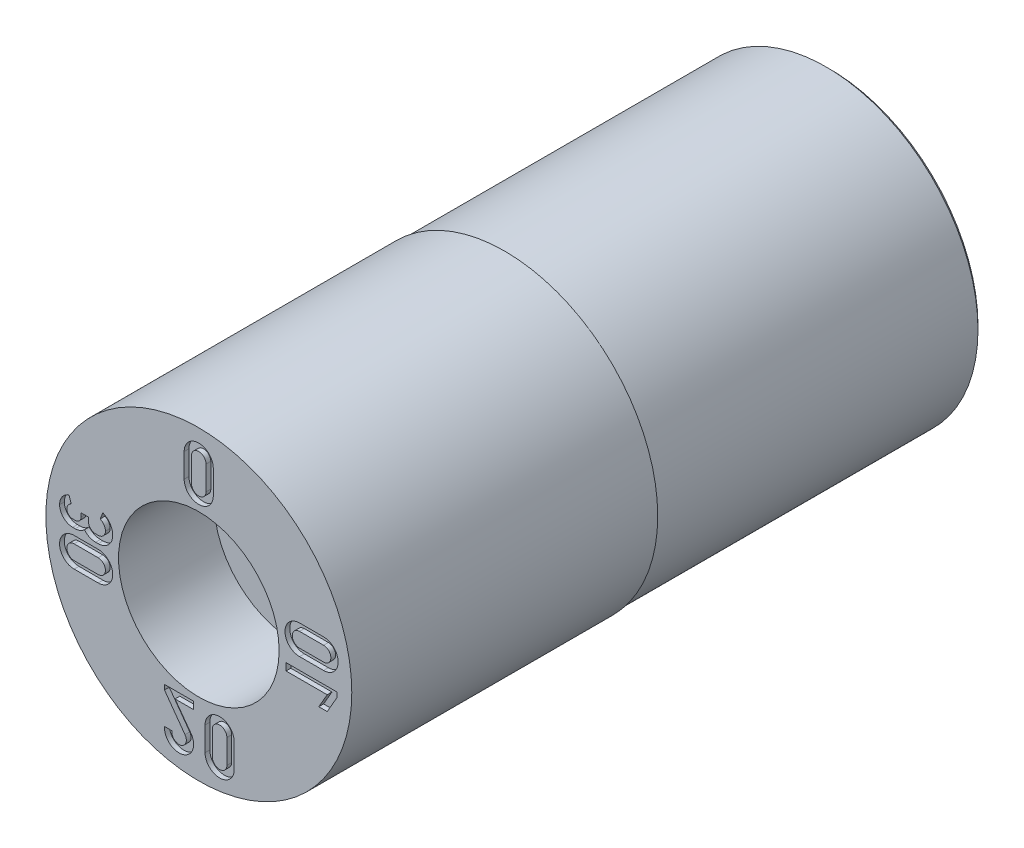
ISO-10303-21;
HEADER;
FILE_DESCRIPTION(('STEP AP214'),'2;1');
FILE_NAME('part.step','',(''),(''),'','','');
FILE_SCHEMA(('AUTOMOTIVE_DESIGN { 1 0 10303 214 1 1 1 1 }'));
ENDSEC;
DATA;
#1=APPLICATION_CONTEXT('core data for automotive mechanical design processes');
#2=APPLICATION_PROTOCOL_DEFINITION('international standard','automotive_design',2000,#1);
#3=PRODUCT_CONTEXT('',#1,'mechanical');
#4=PRODUCT('Part','Part','',(#3));
#5=PRODUCT_RELATED_PRODUCT_CATEGORY('part','',(#4));
#6=PRODUCT_DEFINITION_FORMATION('','',#4);
#7=PRODUCT_DEFINITION_CONTEXT('part definition',#1,'design');
#8=PRODUCT_DEFINITION('design','',#6,#7);
#9=PRODUCT_DEFINITION_SHAPE('','',#8);
#10=(LENGTH_UNIT() NAMED_UNIT(*) SI_UNIT(.MILLI.,.METRE.));
#11=(NAMED_UNIT(*) PLANE_ANGLE_UNIT() SI_UNIT($,.RADIAN.));
#12=(NAMED_UNIT(*) SI_UNIT($,.STERADIAN.) SOLID_ANGLE_UNIT());
#13=UNCERTAINTY_MEASURE_WITH_UNIT(LENGTH_MEASURE(1.E-05),#10,'distance_accuracy_value','');
#14=(GEOMETRIC_REPRESENTATION_CONTEXT(3) GLOBAL_UNCERTAINTY_ASSIGNED_CONTEXT((#13)) GLOBAL_UNIT_ASSIGNED_CONTEXT((#10,
#11,#12)) REPRESENTATION_CONTEXT('',''));
#15=CARTESIAN_POINT('',(0.,0.,0.));
#16=DIRECTION('',(0.,0.,1.));
#17=DIRECTION('',(1.,0.,0.));
#18=AXIS2_PLACEMENT_3D('',#15,#16,#17);
#19=CARTESIAN_POINT('',(0.,0.,3.79790950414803));
#20=DIRECTION('',(0.,0.,1.));
#21=DIRECTION('',(1.,0.,0.));
#22=AXIS2_PLACEMENT_3D('',#19,#20,#21);
#23=CYLINDRICAL_SURFACE('',#22,1.75);
#24=CARTESIAN_POINT('',(0.,0.,-25.));
#25=DIRECTION('',(0.,0.,1.));
#26=DIRECTION('',(1.,0.,0.));
#27=AXIS2_PLACEMENT_3D('',#24,#25,#26);
#28=CIRCLE('',#27,1.75);
#29=CARTESIAN_POINT('',(1.75,0.,-25.));
#30=VERTEX_POINT('',#29);
#31=EDGE_CURVE('E1155',#30,#30,#28,.T.);
#32=ORIENTED_EDGE('',*,*,#31,.F.);
#33=EDGE_LOOP('',(#32));
#34=FACE_BOUND('',#33,.T.);
#35=CARTESIAN_POINT('',(0.,0.,-9.));
#36=DIRECTION('',(0.,0.,1.));
#37=DIRECTION('',(1.,0.,0.));
#38=AXIS2_PLACEMENT_3D('',#35,#36,#37);
#39=CIRCLE('',#38,1.75);
#40=CARTESIAN_POINT('',(1.51554445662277,-0.874999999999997,-9.));
#41=VERTEX_POINT('',#40);
#42=CARTESIAN_POINT('',(0.,-1.75,-9.));
#43=VERTEX_POINT('',#42);
#44=EDGE_CURVE('E11',#41,#43,#39,.F.);
#45=ORIENTED_EDGE('',*,*,#44,.F.);
#46=CARTESIAN_POINT('',(1.51554445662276,0.874999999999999,-9.));
#47=VERTEX_POINT('',#46);
#48=EDGE_CURVE('E38',#47,#41,#39,.F.);
#49=ORIENTED_EDGE('',*,*,#48,.F.);
#50=CARTESIAN_POINT('',(0.,1.75,-9.));
#51=VERTEX_POINT('',#50);
#52=EDGE_CURVE('E525',#51,#47,#39,.F.);
#53=ORIENTED_EDGE('',*,*,#52,.F.);
#54=CARTESIAN_POINT('',(-1.51554445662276,0.874999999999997,-9.));
#55=VERTEX_POINT('',#54);
#56=EDGE_CURVE('E2210',#55,#51,#39,.F.);
#57=ORIENTED_EDGE('',*,*,#56,.F.);
#58=CARTESIAN_POINT('',(-1.51554445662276,-0.874999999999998,-9.));
#59=VERTEX_POINT('',#58);
#60=EDGE_CURVE('E2208',#59,#55,#39,.F.);
#61=ORIENTED_EDGE('',*,*,#60,.F.);
#62=EDGE_CURVE('E43',#43,#59,#39,.F.);
#63=ORIENTED_EDGE('',*,*,#62,.F.);
#64=EDGE_LOOP('',(#45,#49,#53,#57,#61,#63));
#65=FACE_BOUND('',#64,.T.);
#66=ADVANCED_FACE('F34',(#34,#65),#23,.F.);
#67=CARTESIAN_POINT('',(0.,0.,3.79790950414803));
#68=DIRECTION('',(0.,0.,1.));
#69=DIRECTION('',(1.,0.,0.));
#70=AXIS2_PLACEMENT_3D('',#67,#68,#69);
#71=CYLINDRICAL_SURFACE('',#70,8.);
#72=CARTESIAN_POINT('',(0.,0.,0.));
#73=DIRECTION('',(0.,0.,1.));
#74=DIRECTION('',(1.,0.,0.));
#75=AXIS2_PLACEMENT_3D('',#72,#73,#74);
#76=CIRCLE('',#75,8.);
#77=CARTESIAN_POINT('',(8.,0.,0.));
#78=VERTEX_POINT('',#77);
#79=EDGE_CURVE('E1164',#78,#78,#76,.T.);
#80=ORIENTED_EDGE('',*,*,#79,.F.);
#81=EDGE_LOOP('',(#80));
#82=FACE_BOUND('',#81,.T.);
#83=CARTESIAN_POINT('',(0.,0.,-16.));
#84=DIRECTION('',(0.,0.,-1.));
#85=DIRECTION('',(-1.,0.,0.));
#86=AXIS2_PLACEMENT_3D('',#83,#84,#85);
#87=CIRCLE('',#86,8.);
#88=CARTESIAN_POINT('',(-8.,0.,-16.));
#89=VERTEX_POINT('',#88);
#90=EDGE_CURVE('E1149',#89,#89,#87,.T.);
#91=ORIENTED_EDGE('',*,*,#90,.F.);
#92=EDGE_LOOP('',(#91));
#93=FACE_BOUND('',#92,.T.);
#94=ADVANCED_FACE('F36',(#82,#93),#71,.T.);
#95=CARTESIAN_POINT('',(0.,0.,-33.));
#96=DIRECTION('',(0.,0.,1.));
#97=DIRECTION('',(1.,0.,0.));
#98=AXIS2_PLACEMENT_3D('',#95,#96,#97);
#99=CONICAL_SURFACE('',#98,7.7499999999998,0.785398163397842);
#100=CARTESIAN_POINT('',(0.,0.,-33.));
#101=DIRECTION('',(0.,0.,1.));
#102=DIRECTION('',(1.,0.,0.));
#103=AXIS2_PLACEMENT_3D('',#100,#101,#102);
#104=CIRCLE('',#103,7.7499999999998);
#105=CARTESIAN_POINT('',(7.7499999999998,0.,-33.));
#106=VERTEX_POINT('',#105);
#107=EDGE_CURVE('E1145',#106,#106,#104,.T.);
#108=ORIENTED_EDGE('',*,*,#107,.T.);
#109=EDGE_LOOP('',(#108));
#110=FACE_BOUND('',#109,.T.);
#111=CARTESIAN_POINT('',(0.,0.,-32.815));
#112=DIRECTION('',(0.,0.,1.));
#113=DIRECTION('',(1.,0.,0.));
#114=AXIS2_PLACEMENT_3D('',#111,#112,#113);
#115=CIRCLE('',#114,7.935);
#116=CARTESIAN_POINT('',(7.935,0.,-32.815));
#117=VERTEX_POINT('',#116);
#118=EDGE_CURVE('E1144',#117,#117,#115,.T.);
#119=ORIENTED_EDGE('',*,*,#118,.F.);
#120=EDGE_LOOP('',(#119));
#121=FACE_BOUND('',#120,.T.);
#122=ADVANCED_FACE('F1174',(#110,#121),#99,.T.);
#123=CARTESIAN_POINT('',(0.,8.,0.));
#124=DIRECTION('',(0.,0.,-1.));
#125=DIRECTION('',(-1.,0.,0.));
#126=AXIS2_PLACEMENT_3D('',#123,#124,#125);
#127=PLANE('',#126);
#128=DIRECTION('',(0.999999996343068,-8.5521133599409E-05,0.));
#129=VECTOR('',#128,1.);
#130=CARTESIAN_POINT('',(-5.26523162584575,-1.66171319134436,0.));
#131=LINE('',#130,#129);
#132=CARTESIAN_POINT('',(-6.52186220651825,-1.66160572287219,0.));
#133=VERTEX_POINT('',#132);
#134=CARTESIAN_POINT('',(-5.26523162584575,-1.66171319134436,0.));
#135=VERTEX_POINT('',#134);
#136=EDGE_CURVE('E634',#133,#135,#131,.T.);
#137=ORIENTED_EDGE('',*,*,#136,.F.);
#138=CARTESIAN_POINT('',(-6.52179706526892,-0.899908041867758,0.));
#139=DIRECTION('',(0.,0.,1.));
#140=DIRECTION('',(1.,0.,0.));
#141=AXIS2_PLACEMENT_3D('',#138,#139,#140);
#142=CIRCLE('',#141,0.761697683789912);
#143=CARTESIAN_POINT('',(-6.52173192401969,-0.138210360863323,0.));
#144=VERTEX_POINT('',#143);
#145=EDGE_CURVE('E612',#144,#133,#142,.T.);
#146=ORIENTED_EDGE('',*,*,#145,.F.);
#147=DIRECTION('',(-0.999999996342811,8.55241324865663E-05,0.));
#148=VECTOR('',#147,1.);
#149=CARTESIAN_POINT('',(-6.52173192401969,-0.138210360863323,0.));
#150=LINE('',#149,#148);
#151=CARTESIAN_POINT('',(-5.26513218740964,-0.138317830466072,0.));
#152=VERTEX_POINT('',#151);
#153=EDGE_CURVE('E623',#152,#144,#150,.T.);
#154=ORIENTED_EDGE('',*,*,#153,.F.);
#155=CARTESIAN_POINT('',(-5.2651819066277,-0.900015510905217,0.));
#156=DIRECTION('',(0.,0.,1.));
#157=DIRECTION('',(1.,0.,0.));
#158=AXIS2_PLACEMENT_3D('',#155,#156,#157);
#159=CIRCLE('',#158,0.761697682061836);
#160=EDGE_CURVE('E637',#135,#152,#159,.T.);
#161=ORIENTED_EDGE('',*,*,#160,.F.);
#162=EDGE_LOOP('',(#137,#146,#154,#161));
#163=FACE_BOUND('',#162,.T.);
#164=DIRECTION('',(8.43544746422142E-05,-0.999999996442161,0.));
#165=VECTOR('',#164,1.);
#166=CARTESIAN_POINT('',(-0.766117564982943,6.54208555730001,0.));
#167=LINE('',#166,#165);
#168=CARTESIAN_POINT('',(-0.766117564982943,6.54208555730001,0.));
#169=VERTEX_POINT('',#168);
#170=CARTESIAN_POINT('',(-0.766011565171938,5.28548582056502,0.));
#171=VERTEX_POINT('',#170);
#172=EDGE_CURVE('E699',#169,#171,#167,.T.);
#173=ORIENTED_EDGE('',*,*,#172,.F.);
#174=CARTESIAN_POINT('',(-0.00441988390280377,6.5421498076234,0.));
#175=DIRECTION('',(0.,0.,1.));
#176=DIRECTION('',(1.,0.,0.));
#177=AXIS2_PLACEMENT_3D('',#174,#175,#176);
#178=CIRCLE('',#177,0.761697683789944);
#179=CARTESIAN_POINT('',(0.757277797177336,6.54221405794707,0.));
#180=VERTEX_POINT('',#179);
#181=EDGE_CURVE('E677',#180,#169,#178,.T.);
#182=ORIENTED_EDGE('',*,*,#181,.F.);
#183=DIRECTION('',(8.53192128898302E-05,0.999999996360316,0.));
#184=VECTOR('',#183,1.);
#185=CARTESIAN_POINT('',(0.757170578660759,5.28553912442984,0.));
#186=LINE('',#185,#184);
#187=CARTESIAN_POINT('',(0.757170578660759,5.28553912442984,0.));
#188=VERTEX_POINT('',#187);
#189=EDGE_CURVE('E688',#188,#180,#186,.T.);
#190=ORIENTED_EDGE('',*,*,#189,.F.);
#191=CARTESIAN_POINT('',(-0.00442049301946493,5.28550572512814,0.));
#192=DIRECTION('',(0.,0.,1.));
#193=DIRECTION('',(1.,0.,0.));
#194=AXIS2_PLACEMENT_3D('',#191,#192,#193);
#195=CIRCLE('',#194,0.761591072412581);
#196=EDGE_CURVE('E702',#171,#188,#195,.T.);
#197=ORIENTED_EDGE('',*,*,#196,.F.);
#198=EDGE_LOOP('',(#173,#182,#190,#197));
#199=FACE_BOUND('',#198,.T.);
#200=DIRECTION('',(-8.4351476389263E-05,0.999999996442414,0.));
#201=VECTOR('',#200,1.);
#202=CARTESIAN_POINT('',(-0.272574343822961,-4.90268396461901,0.));
#203=LINE('',#202,#201);
#204=CARTESIAN_POINT('',(-0.272574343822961,-4.90268396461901,0.));
#205=VERTEX_POINT('',#204);
#206=CARTESIAN_POINT('',(-0.272606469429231,-4.52182985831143,0.));
#207=VERTEX_POINT('',#206);
#208=EDGE_CURVE('E746',#205,#207,#203,.T.);
#209=ORIENTED_EDGE('',*,*,#208,.F.);
#210=DIRECTION('',(0.999999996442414,8.43514759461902E-05,0.));
#211=VECTOR('',#210,1.);
#212=CARTESIAN_POINT('',(-1.24367343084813,-4.90276587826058,0.));
#213=LINE('',#212,#211);
#214=CARTESIAN_POINT('',(-1.24367343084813,-4.90276587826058,0.));
#215=VERTEX_POINT('',#214);
#216=EDGE_CURVE('E709',#215,#205,#213,.T.);
#217=ORIENTED_EDGE('',*,*,#216,.F.);
#218=DIRECTION('',(-0.589622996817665,0.80767860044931,0.));
#219=VECTOR('',#218,1.);
#220=CARTESIAN_POINT('',(-0.415379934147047,-6.03738059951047,0.));
#221=LINE('',#220,#219);
#222=CARTESIAN_POINT('',(-0.415379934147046,-6.03738059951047,0.));
#223=VERTEX_POINT('',#222);
#224=EDGE_CURVE('E720',#223,#215,#221,.T.);
#225=ORIENTED_EDGE('',*,*,#224,.F.);
#226=CARTESIAN_POINT('',(-1.03370431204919,-6.48254117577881,0.));
#227=DIRECTION('',(0.,0.,1.));
#228=DIRECTION('',(1.,0.,0.));
#229=AXIS2_PLACEMENT_3D('',#226,#227,#228);
#230=CIRCLE('',#229,0.761900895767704);
#231=CARTESIAN_POINT('',(-1.79349557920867,-6.42588250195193,0.));
#232=VERTEX_POINT('',#231);
#233=EDGE_CURVE('E764',#232,#223,#230,.T.);
#234=ORIENTED_EDGE('',*,*,#233,.F.);
#235=DIRECTION('',(-0.999999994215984,-0.000107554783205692,0.));
#236=VECTOR('',#235,1.);
#237=CARTESIAN_POINT('',(-1.41048181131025,-6.42584130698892,0.));
#238=LINE('',#237,#236);
#239=CARTESIAN_POINT('',(-1.41048181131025,-6.42584130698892,0.));
#240=VERTEX_POINT('',#239);
#241=EDGE_CURVE('E761',#240,#232,#238,.T.);
#242=ORIENTED_EDGE('',*,*,#241,.F.);
#243=CARTESIAN_POINT('',(-1.03389680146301,-6.48295920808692,0.));
#244=DIRECTION('',(0.,0.,-1.));
#245=DIRECTION('',(1.,0.,0.));
#246=AXIS2_PLACEMENT_3D('',#243,#244,#245);
#247=CIRCLE('',#246,0.380892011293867);
#248=CARTESIAN_POINT('',(-0.724851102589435,-6.26031716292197,0.));
#249=VERTEX_POINT('',#248);
#250=EDGE_CURVE('E758',#249,#240,#247,.T.);
#251=ORIENTED_EDGE('',*,*,#250,.F.);
#252=DIRECTION('',(0.584527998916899,-0.811373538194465,0.));
#253=VECTOR('',#252,1.);
#254=CARTESIAN_POINT('',(-1.79576734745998,-4.77379623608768,0.));
#255=LINE('',#254,#253);
#256=CARTESIAN_POINT('',(-1.79576734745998,-4.77379623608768,0.));
#257=VERTEX_POINT('',#256);
#258=EDGE_CURVE('E755',#257,#249,#255,.T.);
#259=ORIENTED_EDGE('',*,*,#258,.F.);
#260=DIRECTION('',(8.43514743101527E-05,-0.999999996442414,0.));
#261=VECTOR('',#260,1.);
#262=CARTESIAN_POINT('',(-1.79578859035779,-4.52195834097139,0.));
#263=LINE('',#262,#261);
#264=CARTESIAN_POINT('',(-1.79578859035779,-4.52195834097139,0.));
#265=VERTEX_POINT('',#264);
#266=EDGE_CURVE('E752',#265,#257,#263,.T.);
#267=ORIENTED_EDGE('',*,*,#266,.F.);
#268=DIRECTION('',(-0.999999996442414,-8.43514755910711E-05,0.));
#269=VECTOR('',#268,1.);
#270=CARTESIAN_POINT('',(-0.272606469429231,-4.52182985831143,0.));
#271=LINE('',#270,#269);
#272=EDGE_CURVE('E749',#207,#265,#271,.T.);
#273=ORIENTED_EDGE('',*,*,#272,.F.);
#274=EDGE_LOOP('',(#209,#217,#225,#234,#242,#251,#259,#267,#273));
#275=FACE_BOUND('',#274,.T.);
#276=DIRECTION('',(8.48997848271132E-05,-0.999999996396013,0.));
#277=VECTOR('',#276,1.);
#278=CARTESIAN_POINT('',(4.56137027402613,-0.736278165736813,0.));
#279=LINE('',#278,#277);
#280=CARTESIAN_POINT('',(4.56133794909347,-0.355535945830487,0.));
#281=VERTEX_POINT('',#280);
#282=CARTESIAN_POINT('',(4.56137027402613,-0.736278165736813,0.));
#283=VERTEX_POINT('',#282);
#284=EDGE_CURVE('E812',#281,#283,#279,.T.);
#285=ORIENTED_EDGE('',*,*,#284,.F.);
#286=DIRECTION('',(-0.999999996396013,-8.48997846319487E-05,0.));
#287=VECTOR('',#286,1.);
#288=CARTESIAN_POINT('',(4.56133794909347,-0.355535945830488,0.));
#289=LINE('',#288,#287);
#290=CARTESIAN_POINT('',(7.22685335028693,-0.355309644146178,0.));
#291=VERTEX_POINT('',#290);
#292=EDGE_CURVE('E771',#291,#281,#289,.T.);
#293=ORIENTED_EDGE('',*,*,#292,.F.);
#294=DIRECTION('',(-8.48997827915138E-05,0.999999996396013,0.));
#295=VECTOR('',#294,1.);
#296=CARTESIAN_POINT('',(7.22685335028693,-0.355309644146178,0.));
#297=LINE('',#296,#295);
#298=CARTESIAN_POINT('',(7.22687463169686,-0.60597471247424,0.));
#299=VERTEX_POINT('',#298);
#300=EDGE_CURVE('E792',#299,#291,#297,.T.);
#301=ORIENTED_EDGE('',*,*,#300,.F.);
#302=DIRECTION('',(0.498418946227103,0.866936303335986,0.));
#303=VECTOR('',#302,1.);
#304=CARTESIAN_POINT('',(7.22687463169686,-0.60597471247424,0.));
#305=LINE('',#304,#303);
#306=CARTESIAN_POINT('',(6.71421179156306,-1.49768645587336,0.));
#307=VERTEX_POINT('',#306);
#308=EDGE_CURVE('E824',#307,#299,#305,.T.);
#309=ORIENTED_EDGE('',*,*,#308,.F.);
#310=DIRECTION('',(0.999999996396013,8.48997839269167E-05,0.));
#311=VECTOR('',#310,1.);
#312=CARTESIAN_POINT('',(6.71421179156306,-1.49768645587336,0.));
#313=LINE('',#312,#311);
#314=CARTESIAN_POINT('',(6.27504147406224,-1.49772374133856,0.));
#315=VERTEX_POINT('',#314);
#316=EDGE_CURVE('E821',#315,#307,#313,.T.);
#317=ORIENTED_EDGE('',*,*,#316,.F.);
#318=DIRECTION('',(-0.498285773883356,-0.867012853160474,0.));
#319=VECTOR('',#318,1.);
#320=CARTESIAN_POINT('',(6.27504147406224,-1.49772374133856,0.));
#321=LINE('',#320,#319);
#322=CARTESIAN_POINT('',(6.71276106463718,-0.736095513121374,0.));
#323=VERTEX_POINT('',#322);
#324=EDGE_CURVE('E818',#323,#315,#321,.T.);
#325=ORIENTED_EDGE('',*,*,#324,.F.);
#326=DIRECTION('',(0.999999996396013,8.48997846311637E-05,0.));
#327=VECTOR('',#326,1.);
#328=CARTESIAN_POINT('',(6.71276106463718,-0.736095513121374,0.));
#329=LINE('',#328,#327);
#330=EDGE_CURVE('E815',#283,#323,#329,.T.);
#331=ORIENTED_EDGE('',*,*,#330,.F.);
#332=EDGE_LOOP('',(#285,#293,#301,#309,#317,#325,#331));
#333=FACE_BOUND('',#332,.T.);
#334=DIRECTION('',(-0.999999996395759,-8.49027839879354E-05,0.));
#335=VECTOR('',#334,1.);
#336=CARTESIAN_POINT('',(6.5249119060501,1.79220766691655,0.));
#337=LINE('',#336,#335);
#338=CARTESIAN_POINT('',(6.5249119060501,1.79220766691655,0.));
#339=VERTEX_POINT('',#338);
#340=CARTESIAN_POINT('',(5.26831216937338,1.79210097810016,0.));
#341=VERTEX_POINT('',#340);
#342=EDGE_CURVE('E892',#339,#341,#337,.T.);
#343=ORIENTED_EDGE('',*,*,#342,.F.);
#344=CARTESIAN_POINT('',(6.52497657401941,1.03050998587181,0.));
#345=DIRECTION('',(0.,0.,1.));
#346=DIRECTION('',(1.,0.,0.));
#347=AXIS2_PLACEMENT_3D('',#344,#345,#346);
#348=CIRCLE('',#347,0.761697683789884);
#349=CARTESIAN_POINT('',(6.52504124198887,0.268812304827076,0.));
#350=VERTEX_POINT('',#349);
#351=EDGE_CURVE('E870',#350,#339,#348,.T.);
#352=ORIENTED_EDGE('',*,*,#351,.F.);
#353=DIRECTION('',(0.999999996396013,8.48997850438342E-05,0.));
#354=VECTOR('',#353,1.);
#355=CARTESIAN_POINT('',(5.26841066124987,0.268705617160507,0.));
#356=LINE('',#355,#354);
#357=CARTESIAN_POINT('',(5.26841066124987,0.268705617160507,0.));
#358=VERTEX_POINT('',#357);
#359=EDGE_CURVE('E881',#358,#350,#356,.T.);
#360=ORIENTED_EDGE('',*,*,#359,.F.);
#361=CARTESIAN_POINT('',(5.26837683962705,1.03040329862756,0.));
#362=DIRECTION('',(0.,0.,1.));
#363=DIRECTION('',(1.,0.,0.));
#364=AXIS2_PLACEMENT_3D('',#361,#362,#363);
#365=CIRCLE('',#364,0.761697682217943);
#366=EDGE_CURVE('E895',#341,#358,#365,.T.);
#367=ORIENTED_EDGE('',*,*,#366,.F.);
#368=EDGE_LOOP('',(#343,#352,#360,#367));
#369=FACE_BOUND('',#368,.T.);
#370=DIRECTION('',(-0.999999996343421,8.55170029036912E-05,0.));
#371=VECTOR('',#370,1.);
#372=CARTESIAN_POINT('',(-5.26421035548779,0.496845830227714,0.));
#373=LINE('',#372,#371);
#374=CARTESIAN_POINT('',(-5.26421035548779,0.496845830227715,0.));
#375=VERTEX_POINT('',#374);
#376=CARTESIAN_POINT('',(-5.39748948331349,0.496857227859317,0.));
#377=VERTEX_POINT('',#376);
#378=EDGE_CURVE('E975',#375,#377,#373,.T.);
#379=ORIENTED_EDGE('',*,*,#378,.F.);
#380=CARTESIAN_POINT('',(-5.2641777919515,0.877630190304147,0.));
#381=DIRECTION('',(0.,0.,-1.));
#382=DIRECTION('',(1.,0.,0.));
#383=AXIS2_PLACEMENT_3D('',#380,#381,#382);
#384=CIRCLE('',#383,0.380784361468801);
#385=CARTESIAN_POINT('',(-4.88339343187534,0.877597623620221,0.));
#386=VERTEX_POINT('',#385);
#387=EDGE_CURVE('E902',#386,#375,#384,.T.);
#388=ORIENTED_EDGE('',*,*,#387,.F.);
#389=CARTESIAN_POINT('',(-5.32138549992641,0.877635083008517,0.));
#390=DIRECTION('',(0.,0.,-1.));
#391=DIRECTION('',(1.,0.,0.));
#392=AXIS2_PLACEMENT_3D('',#389,#390,#391);
#393=CIRCLE('',#392,0.437992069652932);
#394=CARTESIAN_POINT('',(-5.16059315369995,1.28504504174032,0.));
#395=VERTEX_POINT('',#394);
#396=EDGE_CURVE('E913',#395,#386,#393,.T.);
#397=ORIENTED_EDGE('',*,*,#396,.F.);
#398=DIRECTION('',(-0.367087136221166,-0.930186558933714,0.));
#399=VECTOR('',#398,1.);
#400=CARTESIAN_POINT('',(-5.02084533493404,1.63916135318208,0.));
#401=LINE('',#400,#399);
#402=CARTESIAN_POINT('',(-5.02084533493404,1.63916135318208,0.));
#403=VERTEX_POINT('',#402);
#404=EDGE_CURVE('E1029',#403,#395,#401,.T.);
#405=ORIENTED_EDGE('',*,*,#404,.F.);
#406=CARTESIAN_POINT('',(-5.32157216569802,0.87745620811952,0.));
#407=DIRECTION('',(0.,0.,1.));
#408=DIRECTION('',(1.,0.,0.));
#409=AXIS2_PLACEMENT_3D('',#406,#407,#408);
#410=CIRCLE('',#409,0.818920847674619);
#411=CARTESIAN_POINT('',(-4.50265131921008,0.877500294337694,0.));
#412=VERTEX_POINT('',#411);
#413=EDGE_CURVE('E1026',#412,#403,#410,.T.);
#414=ORIENTED_EDGE('',*,*,#413,.F.);
#415=CARTESIAN_POINT('',(-5.26411358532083,0.877459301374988,0.));
#416=DIRECTION('',(0.,0.,1.));
#417=DIRECTION('',(1.,0.,0.));
#418=AXIS2_PLACEMENT_3D('',#415,#416,#417);
#419=CIRCLE('',#418,0.761462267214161);
#420=CARTESIAN_POINT('',(-5.26417850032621,0.115997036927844,0.));
#421=VERTEX_POINT('',#420);
#422=EDGE_CURVE('E1023',#421,#412,#419,.T.);
#423=ORIENTED_EDGE('',*,*,#422,.F.);
#424=DIRECTION('',(0.99999999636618,-8.52504561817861E-05,0.));
#425=VECTOR('',#424,1.);
#426=CARTESIAN_POINT('',(-5.39750643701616,0.116008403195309,0.));
#427=LINE('',#426,#425);
#428=CARTESIAN_POINT('',(-5.39750643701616,0.116008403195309,0.));
#429=VERTEX_POINT('',#428);
#430=EDGE_CURVE('E1020',#429,#421,#427,.T.);
#431=ORIENTED_EDGE('',*,*,#430,.F.);
#432=CARTESIAN_POINT('',(-5.39762468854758,0.877279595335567,0.));
#433=DIRECTION('',(0.,0.,1.));
#434=DIRECTION('',(1.,0.,0.));
#435=AXIS2_PLACEMENT_3D('',#432,#433,#434);
#436=CIRCLE('',#435,0.761271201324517);
#437=CARTESIAN_POINT('',(-5.9823113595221,0.389760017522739,0.));
#438=VERTEX_POINT('',#437);
#439=EDGE_CURVE('E1017',#438,#429,#436,.T.);
#440=ORIENTED_EDGE('',*,*,#439,.F.);
#441=CARTESIAN_POINT('',(-6.46361734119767,0.877363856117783,0.));
#442=DIRECTION('',(0.,0.,1.));
#443=DIRECTION('',(1.,0.,0.));
#444=AXIS2_PLACEMENT_3D('',#441,#442,#443);
#445=CIRCLE('',#444,0.685137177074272);
#446=CARTESIAN_POINT('',(-6.46367620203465,0.192226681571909,0.));
#447=VERTEX_POINT('',#446);
#448=EDGE_CURVE('E1014',#447,#438,#445,.T.);
#449=ORIENTED_EDGE('',*,*,#448,.F.);
#450=DIRECTION('',(0.999999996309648,-8.59110265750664E-05,0.));
#451=VECTOR('',#450,1.);
#452=CARTESIAN_POINT('',(-6.59689902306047,0.192238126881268,0.));
#453=LINE('',#452,#451);
#454=CARTESIAN_POINT('',(-6.59689902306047,0.192238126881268,0.));
#455=VERTEX_POINT('',#454);
#456=EDGE_CURVE('E1011',#455,#447,#453,.T.);
#457=ORIENTED_EDGE('',*,*,#456,.F.);
#458=CARTESIAN_POINT('',(-6.59694627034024,0.877603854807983,0.));
#459=DIRECTION('',(0.,0.,1.));
#460=DIRECTION('',(1.,0.,0.));
#461=AXIS2_PLACEMENT_3D('',#458,#459,#460);
#462=CIRCLE('',#461,0.685365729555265);
#463=CARTESIAN_POINT('',(-7.28231196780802,0.87781357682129,0.));
#464=VERTEX_POINT('',#463);
#465=EDGE_CURVE('E1008',#464,#455,#462,.T.);
#466=ORIENTED_EDGE('',*,*,#465,.F.);
#467=CARTESIAN_POINT('',(-6.55861655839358,0.877592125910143,0.));
#468=DIRECTION('',(0.,0.,1.));
#469=DIRECTION('',(1.,0.,0.));
#470=AXIS2_PLACEMENT_3D('',#467,#468,#469);
#471=CIRCLE('',#470,0.72369544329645);
#472=CARTESIAN_POINT('',(-6.79035114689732,1.56318251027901,0.));
#473=VERTEX_POINT('',#472);
#474=EDGE_CURVE('E1005',#473,#464,#471,.T.);
#475=ORIENTED_EDGE('',*,*,#474,.F.);
#476=DIRECTION('',(-0.319923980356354,0.947443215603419,0.));
#477=VECTOR('',#476,1.);
#478=CARTESIAN_POINT('',(-6.66851304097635,1.20236339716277,0.));
#479=LINE('',#478,#477);
#480=CARTESIAN_POINT('',(-6.66851304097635,1.20236339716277,0.));
#481=VERTEX_POINT('',#480);
#482=EDGE_CURVE('E1002',#481,#473,#479,.T.);
#483=ORIENTED_EDGE('',*,*,#482,.F.);
#484=CARTESIAN_POINT('',(-6.55925624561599,0.878018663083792,0.));
#485=DIRECTION('',(0.,0.,-1.));
#486=DIRECTION('',(1.,0.,0.));
#487=AXIS2_PLACEMENT_3D('',#484,#485,#486);
#488=CIRCLE('',#487,0.342252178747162);
#489=CARTESIAN_POINT('',(-6.90150829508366,0.877721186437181,0.));
#490=VERTEX_POINT('',#489);
#491=EDGE_CURVE('E999',#490,#481,#488,.T.);
#492=ORIENTED_EDGE('',*,*,#491,.F.);
#493=CARTESIAN_POINT('',(-6.59660901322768,0.877986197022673,0.));
#494=DIRECTION('',(0.,0.,-1.));
#495=DIRECTION('',(1.,0.,0.));
#496=AXIS2_PLACEMENT_3D('',#493,#494,#495);
#497=CIRCLE('',#496,0.30489939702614);
#498=CARTESIAN_POINT('',(-6.59690431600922,0.573086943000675,0.));
#499=VERTEX_POINT('',#498);
#500=EDGE_CURVE('E996',#499,#490,#497,.T.);
#501=ORIENTED_EDGE('',*,*,#500,.F.);
#502=DIRECTION('',(-0.999999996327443,8.57036442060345E-05,0.));
#503=VECTOR('',#502,1.);
#504=CARTESIAN_POINT('',(-6.46364363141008,0.573075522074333,0.));
#505=LINE('',#504,#503);
#506=CARTESIAN_POINT('',(-6.46364363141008,0.573075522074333,0.));
#507=VERTEX_POINT('',#506);
#508=EDGE_CURVE('E993',#507,#499,#505,.T.);
#509=ORIENTED_EDGE('',*,*,#508,.F.);
#510=CARTESIAN_POINT('',(-6.46361752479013,0.877690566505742,0.));
#511=DIRECTION('',(0.,0.,-1.));
#512=DIRECTION('',(1.,0.,0.));
#513=AXIS2_PLACEMENT_3D('',#510,#511,#512);
#514=CIRCLE('',#513,0.304615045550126);
#515=CARTESIAN_POINT('',(-6.15900248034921,0.877664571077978,0.));
#516=VERTEX_POINT('',#515);
#517=EDGE_CURVE('E990',#516,#507,#514,.T.);
#518=ORIENTED_EDGE('',*,*,#517,.F.);
#519=DIRECTION('',(-8.55211336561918E-05,-0.999999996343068,0.));
#520=VECTOR('',#519,1.);
#521=CARTESIAN_POINT('',(-6.15898620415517,1.06798237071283,0.));
#522=LINE('',#521,#520);
#523=CARTESIAN_POINT('',(-6.15898620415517,1.06798237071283,0.));
#524=VERTEX_POINT('',#523);
#525=EDGE_CURVE('E987',#524,#516,#522,.T.);
#526=ORIENTED_EDGE('',*,*,#525,.F.);
#527=DIRECTION('',(-0.999999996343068,8.55211334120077E-05,0.));
#528=VECTOR('',#527,1.);
#529=CARTESIAN_POINT('',(-5.77813736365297,1.06794980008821,0.));
#530=LINE('',#529,#528);
#531=CARTESIAN_POINT('',(-5.77813736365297,1.06794980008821,0.));
#532=VERTEX_POINT('',#531);
#533=EDGE_CURVE('E984',#532,#524,#530,.T.);
#534=ORIENTED_EDGE('',*,*,#533,.F.);
#535=DIRECTION('',(8.54959125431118E-05,0.999999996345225,0.));
#536=VECTOR('',#535,1.);
#537=CARTESIAN_POINT('',(-5.778153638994,0.877585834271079,0.));
#538=LINE('',#537,#536);
#539=CARTESIAN_POINT('',(-5.778153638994,0.877585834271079,0.));
#540=VERTEX_POINT('',#539);
#541=EDGE_CURVE('E981',#540,#532,#538,.T.);
#542=ORIENTED_EDGE('',*,*,#541,.F.);
#543=CARTESIAN_POINT('',(-5.39745758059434,0.877553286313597,0.));
#544=DIRECTION('',(0.,0.,-1.));
#545=DIRECTION('',(1.,0.,0.));
#546=AXIS2_PLACEMENT_3D('',#543,#544,#545);
#547=CIRCLE('',#546,0.38069605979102);
#548=EDGE_CURVE('E978',#377,#540,#547,.T.);
#549=ORIENTED_EDGE('',*,*,#548,.F.);
#550=EDGE_LOOP('',(#379,#388,#397,#405,#414,#423,#431,#440,#449,#457,#466,#475,#483,#492,#501,
#509,#518,#526,#534,#542,#549));
#551=FACE_BOUND('',#550,.T.);
#552=DIRECTION('',(8.53270660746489E-05,0.999999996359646,0.));
#553=VECTOR('',#552,1.);
#554=CARTESIAN_POINT('',(1.85025289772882,-6.55497220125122,0.));
#555=LINE('',#554,#553);
#556=CARTESIAN_POINT('',(1.85025289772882,-6.55497220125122,0.));
#557=VERTEX_POINT('',#556);
#558=CARTESIAN_POINT('',(1.85036011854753,-5.2983859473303,0.));
#559=VERTEX_POINT('',#558);
#560=EDGE_CURVE('E1125',#557,#559,#555,.T.);
#561=ORIENTED_EDGE('',*,*,#560,.F.);
#562=CARTESIAN_POINT('',(1.08855521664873,-6.55503645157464,0.));
#563=DIRECTION('',(0.,0.,1.));
#564=DIRECTION('',(1.,0.,0.));
#565=AXIS2_PLACEMENT_3D('',#562,#563,#564);
#566=CIRCLE('',#565,0.761697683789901);
#567=CARTESIAN_POINT('',(0.326857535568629,-6.55510070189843,0.));
#568=VERTEX_POINT('',#567);
#569=EDGE_CURVE('E1103',#568,#557,#566,.T.);
#570=ORIENTED_EDGE('',*,*,#569,.F.);
#571=DIRECTION('',(8.43514759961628E-05,-0.999999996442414,0.));
#572=VECTOR('',#571,1.);
#573=CARTESIAN_POINT('',(0.32675153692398,-5.2984701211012,0.));
#574=LINE('',#573,#572);
#575=CARTESIAN_POINT('',(0.32675153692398,-5.2984701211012,0.));
#576=VERTEX_POINT('',#575);
#577=EDGE_CURVE('E1114',#576,#568,#574,.T.);
#578=ORIENTED_EDGE('',*,*,#577,.F.);
#579=CARTESIAN_POINT('',(1.08855582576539,-5.29839236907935,0.));
#580=DIRECTION('',(0.,0.,1.));
#581=DIRECTION('',(1.,0.,0.));
#582=AXIS2_PLACEMENT_3D('',#579,#580,#581);
#583=CIRCLE('',#582,0.761804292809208);
#584=EDGE_CURVE('E1128',#559,#576,#583,.T.);
#585=ORIENTED_EDGE('',*,*,#584,.F.);
#586=EDGE_LOOP('',(#561,#570,#578,#585));
#587=FACE_BOUND('',#586,.T.);
#588=CARTESIAN_POINT('',(0.,0.,0.));
#589=DIRECTION('',(0.,0.,1.));
#590=DIRECTION('',(1.,0.,0.));
#591=AXIS2_PLACEMENT_3D('',#588,#589,#590);
#592=CIRCLE('',#591,4.2);
#593=CARTESIAN_POINT('',(4.2,0.,0.));
#594=VERTEX_POINT('',#593);
#595=EDGE_CURVE('E1161',#594,#594,#592,.T.);
#596=ORIENTED_EDGE('',*,*,#595,.F.);
#597=EDGE_LOOP('',(#596));
#598=FACE_BOUND('',#597,.T.);
#599=ORIENTED_EDGE('',*,*,#79,.T.);
#600=EDGE_LOOP('',(#599));
#601=FACE_BOUND('',#600,.T.);
#602=ADVANCED_FACE('F1180',(#163,#199,#275,#333,#369,#551,#587,#598,#601),#127,.F.);
#603=CARTESIAN_POINT('',(0.,0.,3.79790950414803));
#604=DIRECTION('',(0.,0.,1.));
#605=DIRECTION('',(1.,0.,0.));
#606=AXIS2_PLACEMENT_3D('',#603,#604,#605);
#607=CYLINDRICAL_SURFACE('',#606,4.2);
#608=CARTESIAN_POINT('',(0.,0.,-5.));
#609=DIRECTION('',(0.,0.,1.));
#610=DIRECTION('',(1.,0.,0.));
#611=AXIS2_PLACEMENT_3D('',#608,#609,#610);
#612=CIRCLE('',#611,4.2);
#613=CARTESIAN_POINT('',(4.2,0.,-5.));
#614=VERTEX_POINT('',#613);
#615=EDGE_CURVE('E1158',#614,#614,#612,.T.);
#616=ORIENTED_EDGE('',*,*,#615,.F.);
#617=EDGE_LOOP('',(#616));
#618=FACE_BOUND('',#617,.T.);
#619=ORIENTED_EDGE('',*,*,#595,.T.);
#620=EDGE_LOOP('',(#619));
#621=FACE_BOUND('',#620,.T.);
#622=ADVANCED_FACE('F1188',(#618,#621),#607,.F.);
#623=CARTESIAN_POINT('',(0.,4.2,-5.));
#624=DIRECTION('',(0.,0.,-1.));
#625=DIRECTION('',(-1.,0.,0.));
#626=AXIS2_PLACEMENT_3D('',#623,#624,#625);
#627=PLANE('',#626);
#628=DIRECTION('',(-1.,0.,0.));
#629=VECTOR('',#628,1.);
#630=CARTESIAN_POINT('',(1.01036297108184,1.75,-5.));
#631=LINE('',#630,#629);
#632=CARTESIAN_POINT('',(1.01036297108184,1.75,-5.));
#633=VERTEX_POINT('',#632);
#634=CARTESIAN_POINT('',(-1.01036297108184,1.75,-5.));
#635=VERTEX_POINT('',#634);
#636=EDGE_CURVE('E50',#633,#635,#631,.T.);
#637=ORIENTED_EDGE('',*,*,#636,.F.);
#638=DIRECTION('',(-0.5,0.866025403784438,0.));
#639=VECTOR('',#638,1.);
#640=CARTESIAN_POINT('',(2.02072594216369,0.,-5.));
#641=LINE('',#640,#639);
#642=CARTESIAN_POINT('',(2.02072594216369,0.,-5.));
#643=VERTEX_POINT('',#642);
#644=EDGE_CURVE('E534',#643,#633,#641,.T.);
#645=ORIENTED_EDGE('',*,*,#644,.F.);
#646=DIRECTION('',(0.499999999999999,0.866025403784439,0.));
#647=VECTOR('',#646,1.);
#648=CARTESIAN_POINT('',(1.01036297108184,-1.75,-5.));
#649=LINE('',#648,#647);
#650=CARTESIAN_POINT('',(1.01036297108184,-1.75,-5.));
#651=VERTEX_POINT('',#650);
#652=EDGE_CURVE('E528',#651,#643,#649,.T.);
#653=ORIENTED_EDGE('',*,*,#652,.F.);
#654=DIRECTION('',(1.,0.,0.));
#655=VECTOR('',#654,1.);
#656=CARTESIAN_POINT('',(-1.01036297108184,-1.75,-5.));
#657=LINE('',#656,#655);
#658=CARTESIAN_POINT('',(-1.01036297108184,-1.75,-5.));
#659=VERTEX_POINT('',#658);
#660=EDGE_CURVE('E568',#659,#651,#657,.T.);
#661=ORIENTED_EDGE('',*,*,#660,.F.);
#662=DIRECTION('',(0.5,-0.866025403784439,0.));
#663=VECTOR('',#662,1.);
#664=CARTESIAN_POINT('',(-2.02072594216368,0.,-5.));
#665=LINE('',#664,#663);
#666=CARTESIAN_POINT('',(-2.02072594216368,0.,-5.));
#667=VERTEX_POINT('',#666);
#668=EDGE_CURVE('E565',#667,#659,#665,.T.);
#669=ORIENTED_EDGE('',*,*,#668,.F.);
#670=DIRECTION('',(-0.499999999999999,-0.866025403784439,0.));
#671=VECTOR('',#670,1.);
#672=CARTESIAN_POINT('',(-1.01036297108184,1.75,-5.));
#673=LINE('',#672,#671);
#674=EDGE_CURVE('E562',#635,#667,#673,.T.);
#675=ORIENTED_EDGE('',*,*,#674,.F.);
#676=EDGE_LOOP('',(#637,#645,#653,#661,#669,#675));
#677=FACE_BOUND('',#676,.T.);
#678=ORIENTED_EDGE('',*,*,#615,.T.);
#679=EDGE_LOOP('',(#678));
#680=FACE_BOUND('',#679,.T.);
#681=ADVANCED_FACE('F1195',(#677,#680),#627,.F.);
#682=CARTESIAN_POINT('',(0.,1.75,-25.));
#683=DIRECTION('',(0.,0.,1.));
#684=DIRECTION('',(1.,0.,0.));
#685=AXIS2_PLACEMENT_3D('',#682,#683,#684);
#686=PLANE('',#685);
#687=CARTESIAN_POINT('',(0.,0.,-25.));
#688=DIRECTION('',(0.,0.,1.));
#689=DIRECTION('',(1.,0.,0.));
#690=AXIS2_PLACEMENT_3D('',#687,#688,#689);
#691=CIRCLE('',#690,4.);
#692=CARTESIAN_POINT('',(4.,0.,-25.));
#693=VERTEX_POINT('',#692);
#694=EDGE_CURVE('E1152',#693,#693,#691,.T.);
#695=ORIENTED_EDGE('',*,*,#694,.F.);
#696=EDGE_LOOP('',(#695));
#697=FACE_BOUND('',#696,.T.);
#698=ORIENTED_EDGE('',*,*,#31,.T.);
#699=EDGE_LOOP('',(#698));
#700=FACE_BOUND('',#699,.T.);
#701=ADVANCED_FACE('F1352',(#697,#700),#686,.F.);
#702=CARTESIAN_POINT('',(0.,0.,3.79790950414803));
#703=DIRECTION('',(0.,0.,1.));
#704=DIRECTION('',(1.,0.,0.));
#705=AXIS2_PLACEMENT_3D('',#702,#703,#704);
#706=CYLINDRICAL_SURFACE('',#705,4.);
#707=CARTESIAN_POINT('',(0.,0.,-33.));
#708=DIRECTION('',(0.,0.,1.));
#709=DIRECTION('',(1.,0.,0.));
#710=AXIS2_PLACEMENT_3D('',#707,#708,#709);
#711=CIRCLE('',#710,4.);
#712=CARTESIAN_POINT('',(4.,0.,-33.));
#713=VERTEX_POINT('',#712);
#714=EDGE_CURVE('E1148',#713,#713,#711,.T.);
#715=ORIENTED_EDGE('',*,*,#714,.F.);
#716=EDGE_LOOP('',(#715));
#717=FACE_BOUND('',#716,.T.);
#718=ORIENTED_EDGE('',*,*,#694,.T.);
#719=EDGE_LOOP('',(#718));
#720=FACE_BOUND('',#719,.T.);
#721=ADVANCED_FACE('F1348',(#717,#720),#706,.F.);
#722=CARTESIAN_POINT('',(0.,4.,-33.));
#723=DIRECTION('',(0.,0.,1.));
#724=DIRECTION('',(1.,0.,0.));
#725=AXIS2_PLACEMENT_3D('',#722,#723,#724);
#726=PLANE('',#725);
#727=ORIENTED_EDGE('',*,*,#107,.F.);
#728=EDGE_LOOP('',(#727));
#729=FACE_BOUND('',#728,.T.);
#730=ORIENTED_EDGE('',*,*,#714,.T.);
#731=EDGE_LOOP('',(#730));
#732=FACE_BOUND('',#731,.T.);
#733=ADVANCED_FACE('F1343',(#729,#732),#726,.F.);
#734=CARTESIAN_POINT('',(0.,8.935,-16.));
#735=DIRECTION('',(0.,0.,-1.));
#736=DIRECTION('',(-1.,0.,0.));
#737=AXIS2_PLACEMENT_3D('',#734,#735,#736);
#738=PLANE('',#737);
#739=CARTESIAN_POINT('',(0.,0.,-16.));
#740=DIRECTION('',(0.,0.,1.));
#741=DIRECTION('',(1.,0.,0.));
#742=AXIS2_PLACEMENT_3D('',#739,#740,#741);
#743=CIRCLE('',#742,7.935);
#744=CARTESIAN_POINT('',(7.935,0.,-16.));
#745=VERTEX_POINT('',#744);
#746=EDGE_CURVE('E1135',#745,#745,#743,.T.);
#747=ORIENTED_EDGE('',*,*,#746,.T.);
#748=EDGE_LOOP('',(#747));
#749=FACE_BOUND('',#748,.T.);
#750=ORIENTED_EDGE('',*,*,#90,.T.);
#751=EDGE_LOOP('',(#750));
#752=FACE_BOUND('',#751,.T.);
#753=ADVANCED_FACE('F1171',(#749,#752),#738,.T.);
#754=CARTESIAN_POINT('',(0.,0.,0.));
#755=DIRECTION('',(0.,0.,1.));
#756=DIRECTION('',(1.,0.,0.));
#757=AXIS2_PLACEMENT_3D('',#754,#755,#756);
#758=CYLINDRICAL_SURFACE('',#757,7.935);
#759=ORIENTED_EDGE('',*,*,#746,.F.);
#760=EDGE_LOOP('',(#759));
#761=FACE_BOUND('',#760,.T.);
#762=ORIENTED_EDGE('',*,*,#118,.T.);
#763=EDGE_LOOP('',(#762));
#764=FACE_BOUND('',#763,.T.);
#765=ADVANCED_FACE('F1338',(#761,#764),#758,.T.);
#766=CARTESIAN_POINT('',(1.08855521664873,-6.55503645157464,-0.25));
#767=DIRECTION('',(0.,0.,1.));
#768=DIRECTION('',(1.,0.,0.));
#769=AXIS2_PLACEMENT_3D('',#766,#767,#768);
#770=CYLINDRICAL_SURFACE('',#769,0.761697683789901);
#771=ORIENTED_EDGE('',*,*,#569,.T.);
#772=DIRECTION('',(0.,0.,1.));
#773=VECTOR('',#772,1.);
#774=CARTESIAN_POINT('',(1.85025289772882,-6.55497220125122,-0.25));
#775=LINE('',#774,#773);
#776=CARTESIAN_POINT('',(1.85025289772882,-6.55497220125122,-0.25));
#777=VERTEX_POINT('',#776);
#778=EDGE_CURVE('E1123',#777,#557,#775,.T.);
#779=ORIENTED_EDGE('',*,*,#778,.F.);
#780=CARTESIAN_POINT('',(1.08855521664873,-6.55503645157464,-0.25));
#781=DIRECTION('',(0.,0.,1.));
#782=DIRECTION('',(1.,0.,0.));
#783=AXIS2_PLACEMENT_3D('',#780,#781,#782);
#784=CIRCLE('',#783,0.761697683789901);
#785=CARTESIAN_POINT('',(0.326857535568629,-6.55510070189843,-0.25));
#786=VERTEX_POINT('',#785);
#787=EDGE_CURVE('E1110',#786,#777,#784,.T.);
#788=ORIENTED_EDGE('',*,*,#787,.F.);
#789=DIRECTION('',(0.,0.,1.));
#790=VECTOR('',#789,1.);
#791=CARTESIAN_POINT('',(0.326857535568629,-6.55510070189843,-0.25));
#792=LINE('',#791,#790);
#793=EDGE_CURVE('E1133',#786,#568,#792,.T.);
#794=ORIENTED_EDGE('',*,*,#793,.T.);
#795=EDGE_LOOP('',(#771,#779,#788,#794));
#796=FACE_BOUND('',#795,.T.);
#797=ADVANCED_FACE('F1310',(#796),#770,.F.);
#798=CARTESIAN_POINT('',(0.32675153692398,-5.2984701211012,-0.25));
#799=DIRECTION('',(-0.999999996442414,-8.43514759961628E-05,0.));
#800=DIRECTION('',(8.43514759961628E-05,-0.999999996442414,0.));
#801=AXIS2_PLACEMENT_3D('',#798,#799,#800);
#802=PLANE('',#801);
#803=ORIENTED_EDGE('',*,*,#577,.T.);
#804=ORIENTED_EDGE('',*,*,#793,.F.);
#805=DIRECTION('',(8.43514759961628E-05,-0.999999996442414,0.));
#806=VECTOR('',#805,1.);
#807=CARTESIAN_POINT('',(0.32675153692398,-5.2984701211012,-0.25));
#808=LINE('',#807,#806);
#809=CARTESIAN_POINT('',(0.32675153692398,-5.2984701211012,-0.25));
#810=VERTEX_POINT('',#809);
#811=EDGE_CURVE('E1120',#810,#786,#808,.T.);
#812=ORIENTED_EDGE('',*,*,#811,.F.);
#813=DIRECTION('',(0.,0.,1.));
#814=VECTOR('',#813,1.);
#815=CARTESIAN_POINT('',(0.32675153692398,-5.2984701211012,-0.25));
#816=LINE('',#815,#814);
#817=EDGE_CURVE('E1136',#810,#576,#816,.T.);
#818=ORIENTED_EDGE('',*,*,#817,.T.);
#819=EDGE_LOOP('',(#803,#804,#812,#818));
#820=FACE_BOUND('',#819,.T.);
#821=ADVANCED_FACE('F1313',(#820),#802,.F.);
#822=CARTESIAN_POINT('',(1.08855582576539,-5.29839236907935,-0.25));
#823=DIRECTION('',(0.,0.,1.));
#824=DIRECTION('',(1.,0.,0.));
#825=AXIS2_PLACEMENT_3D('',#822,#823,#824);
#826=CYLINDRICAL_SURFACE('',#825,0.761804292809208);
#827=ORIENTED_EDGE('',*,*,#584,.T.);
#828=ORIENTED_EDGE('',*,*,#817,.F.);
#829=CARTESIAN_POINT('',(1.08855582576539,-5.29839236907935,-0.25));
#830=DIRECTION('',(0.,0.,1.));
#831=DIRECTION('',(1.,0.,0.));
#832=AXIS2_PLACEMENT_3D('',#829,#830,#831);
#833=CIRCLE('',#832,0.761804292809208);
#834=CARTESIAN_POINT('',(1.85036011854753,-5.2983859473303,-0.25));
#835=VERTEX_POINT('',#834);
#836=EDGE_CURVE('E1117',#835,#810,#833,.T.);
#837=ORIENTED_EDGE('',*,*,#836,.F.);
#838=DIRECTION('',(0.,0.,1.));
#839=VECTOR('',#838,1.);
#840=CARTESIAN_POINT('',(1.85036011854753,-5.2983859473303,-0.25));
#841=LINE('',#840,#839);
#842=EDGE_CURVE('E1138',#835,#559,#841,.T.);
#843=ORIENTED_EDGE('',*,*,#842,.T.);
#844=EDGE_LOOP('',(#827,#828,#837,#843));
#845=FACE_BOUND('',#844,.T.);
#846=ADVANCED_FACE('F1315',(#845),#826,.F.);
#847=CARTESIAN_POINT('',(1.85025289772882,-6.55497220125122,-0.25));
#848=DIRECTION('',(0.999999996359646,-8.53270660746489E-05,0.));
#849=DIRECTION('',(8.53270660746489E-05,0.999999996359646,0.));
#850=AXIS2_PLACEMENT_3D('',#847,#848,#849);
#851=PLANE('',#850);
#852=ORIENTED_EDGE('',*,*,#560,.T.);
#853=ORIENTED_EDGE('',*,*,#842,.F.);
#854=DIRECTION('',(8.53270660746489E-05,0.999999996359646,0.));
#855=VECTOR('',#854,1.);
#856=CARTESIAN_POINT('',(1.85025289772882,-6.55497220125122,-0.25));
#857=LINE('',#856,#855);
#858=EDGE_CURVE('E1113',#777,#835,#857,.T.);
#859=ORIENTED_EDGE('',*,*,#858,.F.);
#860=ORIENTED_EDGE('',*,*,#778,.T.);
#861=EDGE_LOOP('',(#852,#853,#859,#860));
#862=FACE_BOUND('',#861,.T.);
#863=ADVANCED_FACE('F1305',(#862),#851,.F.);
#864=CARTESIAN_POINT('',(1.08855521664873,-6.55503645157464,-0.25));
#865=DIRECTION('',(0.,0.,1.));
#866=DIRECTION('',(1.,0.,0.));
#867=AXIS2_PLACEMENT_3D('',#864,#865,#866);
#868=PLANE('',#867);
#869=DIRECTION('',(8.53190860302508E-05,0.999999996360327,0.));
#870=VECTOR('',#869,1.);
#871=CARTESIAN_POINT('',(1.46929743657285,-6.55500433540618,-0.25));
#872=LINE('',#871,#870);
#873=CARTESIAN_POINT('',(1.46929743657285,-6.55500433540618,-0.25));
#874=VERTEX_POINT('',#873);
#875=CARTESIAN_POINT('',(1.46940465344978,-5.29834675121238,-0.25));
#876=VERTEX_POINT('',#875);
#877=EDGE_CURVE('E1087',#874,#876,#872,.T.);
#878=ORIENTED_EDGE('',*,*,#877,.F.);
#879=CARTESIAN_POINT('',(1.08855521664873,-6.55503645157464,-0.25));
#880=DIRECTION('',(0.,0.,1.));
#881=DIRECTION('',(1.,0.,0.));
#882=AXIS2_PLACEMENT_3D('',#879,#880,#881);
#883=CIRCLE('',#882,0.380742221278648);
#884=CARTESIAN_POINT('',(0.7078129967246,-6.55506856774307,-0.25));
#885=VERTEX_POINT('',#884);
#886=EDGE_CURVE('E1084',#885,#874,#883,.T.);
#887=ORIENTED_EDGE('',*,*,#886,.F.);
#888=DIRECTION('',(8.43514751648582E-05,-0.999999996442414,0.));
#889=VECTOR('',#888,1.);
#890=CARTESIAN_POINT('',(0.707706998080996,-5.29843798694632,-0.25));
#891=LINE('',#890,#889);
#892=CARTESIAN_POINT('',(0.707706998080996,-5.29843798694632,-0.25));
#893=VERTEX_POINT('',#892);
#894=EDGE_CURVE('E1080',#893,#885,#891,.T.);
#895=ORIENTED_EDGE('',*,*,#894,.F.);
#896=CARTESIAN_POINT('',(1.08855582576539,-5.29839236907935,-0.25));
#897=DIRECTION('',(0.,0.,1.));
#898=DIRECTION('',(1.,0.,0.));
#899=AXIS2_PLACEMENT_3D('',#896,#897,#898);
#900=CIRCLE('',#899,0.380848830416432);
#901=EDGE_CURVE('E1077',#876,#893,#900,.T.);
#902=ORIENTED_EDGE('',*,*,#901,.F.);
#903=EDGE_LOOP('',(#878,#887,#895,#902));
#904=FACE_BOUND('',#903,.T.);
#905=ORIENTED_EDGE('',*,*,#787,.T.);
#906=ORIENTED_EDGE('',*,*,#858,.T.);
#907=ORIENTED_EDGE('',*,*,#836,.T.);
#908=ORIENTED_EDGE('',*,*,#811,.T.);
#909=EDGE_LOOP('',(#905,#906,#907,#908));
#910=FACE_BOUND('',#909,.T.);
#911=ADVANCED_FACE('F1317',(#904,#910),#868,.T.);
#912=CARTESIAN_POINT('',(1.08855582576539,-5.29839236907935,-0.25));
#913=DIRECTION('',(0.,0.,1.));
#914=DIRECTION('',(1.,0.,0.));
#915=AXIS2_PLACEMENT_3D('',#912,#913,#914);
#916=CYLINDRICAL_SURFACE('',#915,0.380848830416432);
#917=CARTESIAN_POINT('',(1.08855582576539,-5.29839236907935,0.));
#918=DIRECTION('',(0.,0.,1.));
#919=DIRECTION('',(1.,0.,0.));
#920=AXIS2_PLACEMENT_3D('',#917,#918,#919);
#921=CIRCLE('',#920,0.380848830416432);
#922=CARTESIAN_POINT('',(1.46940465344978,-5.29834675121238,0.));
#923=VERTEX_POINT('',#922);
#924=CARTESIAN_POINT('',(0.707706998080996,-5.29843798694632,0.));
#925=VERTEX_POINT('',#924);
#926=EDGE_CURVE('E1036',#923,#925,#921,.T.);
#927=ORIENTED_EDGE('',*,*,#926,.F.);
#928=DIRECTION('',(0.,0.,1.));
#929=VECTOR('',#928,1.);
#930=CARTESIAN_POINT('',(1.46940465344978,-5.29834675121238,-0.25));
#931=LINE('',#930,#929);
#932=EDGE_CURVE('E1101',#876,#923,#931,.T.);
#933=ORIENTED_EDGE('',*,*,#932,.F.);
#934=ORIENTED_EDGE('',*,*,#901,.T.);
#935=DIRECTION('',(0.,0.,1.));
#936=VECTOR('',#935,1.);
#937=CARTESIAN_POINT('',(0.707706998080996,-5.29843798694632,-0.25));
#938=LINE('',#937,#936);
#939=EDGE_CURVE('E1090',#893,#925,#938,.T.);
#940=ORIENTED_EDGE('',*,*,#939,.T.);
#941=EDGE_LOOP('',(#927,#933,#934,#940));
#942=FACE_BOUND('',#941,.T.);
#943=ADVANCED_FACE('F1319',(#942),#916,.T.);
#944=CARTESIAN_POINT('',(1.46929743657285,-6.55500433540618,-0.25));
#945=DIRECTION('',(0.999999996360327,-8.53190860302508E-05,0.));
#946=DIRECTION('',(8.53190860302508E-05,0.999999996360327,0.));
#947=AXIS2_PLACEMENT_3D('',#944,#945,#946);
#948=PLANE('',#947);
#949=DIRECTION('',(8.53190860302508E-05,0.999999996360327,0.));
#950=VECTOR('',#949,1.);
#951=CARTESIAN_POINT('',(1.46929743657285,-6.55500433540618,0.));
#952=LINE('',#951,#950);
#953=CARTESIAN_POINT('',(1.46929743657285,-6.55500433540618,0.));
#954=VERTEX_POINT('',#953);
#955=EDGE_CURVE('E1081',#954,#923,#952,.T.);
#956=ORIENTED_EDGE('',*,*,#955,.F.);
#957=DIRECTION('',(0.,0.,1.));
#958=VECTOR('',#957,1.);
#959=CARTESIAN_POINT('',(1.46929743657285,-6.55500433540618,-0.25));
#960=LINE('',#959,#958);
#961=EDGE_CURVE('E1104',#874,#954,#960,.T.);
#962=ORIENTED_EDGE('',*,*,#961,.F.);
#963=ORIENTED_EDGE('',*,*,#877,.T.);
#964=ORIENTED_EDGE('',*,*,#932,.T.);
#965=EDGE_LOOP('',(#956,#962,#963,#964));
#966=FACE_BOUND('',#965,.T.);
#967=ADVANCED_FACE('F1326',(#966),#948,.T.);
#968=CARTESIAN_POINT('',(1.08855521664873,-6.55503645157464,-0.25));
#969=DIRECTION('',(0.,0.,1.));
#970=DIRECTION('',(1.,0.,0.));
#971=AXIS2_PLACEMENT_3D('',#968,#969,#970);
#972=CYLINDRICAL_SURFACE('',#971,0.380742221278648);
#973=CARTESIAN_POINT('',(1.08855521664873,-6.55503645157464,0.));
#974=DIRECTION('',(0.,0.,1.));
#975=DIRECTION('',(1.,0.,0.));
#976=AXIS2_PLACEMENT_3D('',#973,#974,#975);
#977=CIRCLE('',#976,0.380742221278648);
#978=CARTESIAN_POINT('',(0.7078129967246,-6.55506856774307,0.));
#979=VERTEX_POINT('',#978);
#980=EDGE_CURVE('E1096',#979,#954,#977,.T.);
#981=ORIENTED_EDGE('',*,*,#980,.F.);
#982=DIRECTION('',(0.,0.,1.));
#983=VECTOR('',#982,1.);
#984=CARTESIAN_POINT('',(0.7078129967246,-6.55506856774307,-0.25));
#985=LINE('',#984,#983);
#986=EDGE_CURVE('E1106',#885,#979,#985,.T.);
#987=ORIENTED_EDGE('',*,*,#986,.F.);
#988=ORIENTED_EDGE('',*,*,#886,.T.);
#989=ORIENTED_EDGE('',*,*,#961,.T.);
#990=EDGE_LOOP('',(#981,#987,#988,#989));
#991=FACE_BOUND('',#990,.T.);
#992=ADVANCED_FACE('F1216',(#991),#972,.T.);
#993=CARTESIAN_POINT('',(0.707706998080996,-5.29843798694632,-0.25));
#994=DIRECTION('',(-0.999999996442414,-8.43514751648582E-05,0.));
#995=DIRECTION('',(8.43514751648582E-05,-0.999999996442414,0.));
#996=AXIS2_PLACEMENT_3D('',#993,#994,#995);
#997=PLANE('',#996);
#998=DIRECTION('',(8.43514751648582E-05,-0.999999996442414,0.));
#999=VECTOR('',#998,1.);
#1000=CARTESIAN_POINT('',(0.707706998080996,-5.29843798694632,0.));
#1001=LINE('',#1000,#999);
#1002=EDGE_CURVE('E1093',#925,#979,#1001,.T.);
#1003=ORIENTED_EDGE('',*,*,#1002,.F.);
#1004=ORIENTED_EDGE('',*,*,#939,.F.);
#1005=ORIENTED_EDGE('',*,*,#894,.T.);
#1006=ORIENTED_EDGE('',*,*,#986,.T.);
#1007=EDGE_LOOP('',(#1003,#1004,#1005,#1006));
#1008=FACE_BOUND('',#1007,.T.);
#1009=ADVANCED_FACE('F1206',(#1008),#997,.T.);
#1010=ORIENTED_EDGE('',*,*,#926,.T.);
#1011=ORIENTED_EDGE('',*,*,#1002,.T.);
#1012=ORIENTED_EDGE('',*,*,#980,.T.);
#1013=ORIENTED_EDGE('',*,*,#955,.T.);
#1014=EDGE_LOOP('',(#1010,#1011,#1012,#1013));
#1015=FACE_BOUND('',#1014,.T.);
#1016=ADVANCED_FACE('F1191',(#1015),#127,.F.);
#1017=CARTESIAN_POINT('',(-5.2641777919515,0.877630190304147,-0.25));
#1018=DIRECTION('',(0.,0.,1.));
#1019=DIRECTION('',(1.,0.,0.));
#1020=AXIS2_PLACEMENT_3D('',#1017,#1018,#1019);
#1021=CYLINDRICAL_SURFACE('',#1020,0.380784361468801);
#1022=ORIENTED_EDGE('',*,*,#387,.T.);
#1023=DIRECTION('',(0.,0.,1.));
#1024=VECTOR('',#1023,1.);
#1025=CARTESIAN_POINT('',(-5.26421035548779,0.496845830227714,-0.25));
#1026=LINE('',#1025,#1024);
#1027=CARTESIAN_POINT('',(-5.26421035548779,0.496845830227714,-0.25));
#1028=VERTEX_POINT('',#1027);
#1029=EDGE_CURVE('E973',#1028,#375,#1026,.T.);
#1030=ORIENTED_EDGE('',*,*,#1029,.F.);
#1031=CARTESIAN_POINT('',(-5.2641777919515,0.877630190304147,-0.25));
#1032=DIRECTION('',(0.,0.,-1.));
#1033=DIRECTION('',(1.,0.,0.));
#1034=AXIS2_PLACEMENT_3D('',#1031,#1032,#1033);
#1035=CIRCLE('',#1034,0.380784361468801);
#1036=CARTESIAN_POINT('',(-4.88339343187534,0.877597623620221,-0.25));
#1037=VERTEX_POINT('',#1036);
#1038=EDGE_CURVE('E909',#1037,#1028,#1035,.T.);
#1039=ORIENTED_EDGE('',*,*,#1038,.F.);
#1040=DIRECTION('',(0.,0.,1.));
#1041=VECTOR('',#1040,1.);
#1042=CARTESIAN_POINT('',(-4.88339343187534,0.877597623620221,-0.25));
#1043=LINE('',#1042,#1041);
#1044=EDGE_CURVE('E1034',#1037,#386,#1043,.T.);
#1045=ORIENTED_EDGE('',*,*,#1044,.T.);
#1046=EDGE_LOOP('',(#1022,#1030,#1039,#1045));
#1047=FACE_BOUND('',#1046,.T.);
#1048=ADVANCED_FACE('F1205',(#1047),#1021,.T.);
#1049=CARTESIAN_POINT('',(-5.32138549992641,0.877635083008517,-0.25));
#1050=DIRECTION('',(0.,0.,1.));
#1051=DIRECTION('',(1.,0.,0.));
#1052=AXIS2_PLACEMENT_3D('',#1049,#1050,#1051);
#1053=CYLINDRICAL_SURFACE('',#1052,0.437992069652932);
#1054=ORIENTED_EDGE('',*,*,#396,.T.);
#1055=ORIENTED_EDGE('',*,*,#1044,.F.);
#1056=CARTESIAN_POINT('',(-5.32138549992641,0.877635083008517,-0.25));
#1057=DIRECTION('',(0.,0.,-1.));
#1058=DIRECTION('',(1.,0.,0.));
#1059=AXIS2_PLACEMENT_3D('',#1056,#1057,#1058);
#1060=CIRCLE('',#1059,0.437992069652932);
#1061=CARTESIAN_POINT('',(-5.16059315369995,1.28504504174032,-0.25));
#1062=VERTEX_POINT('',#1061);
#1063=EDGE_CURVE('E970',#1062,#1037,#1060,.T.);
#1064=ORIENTED_EDGE('',*,*,#1063,.F.);
#1065=DIRECTION('',(0.,0.,1.));
#1066=VECTOR('',#1065,1.);
#1067=CARTESIAN_POINT('',(-5.16059315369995,1.28504504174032,-0.25));
#1068=LINE('',#1067,#1066);
#1069=EDGE_CURVE('E1037',#1062,#395,#1068,.T.);
#1070=ORIENTED_EDGE('',*,*,#1069,.T.);
#1071=EDGE_LOOP('',(#1054,#1055,#1064,#1070));
#1072=FACE_BOUND('',#1071,.T.);
#1073=ADVANCED_FACE('F1213',(#1072),#1053,.T.);
#1074=CARTESIAN_POINT('',(-5.02084533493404,1.63916135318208,-0.25));
#1075=DIRECTION('',(-0.930186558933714,0.367087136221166,0.));
#1076=DIRECTION('',(-0.367087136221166,-0.930186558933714,0.));
#1077=AXIS2_PLACEMENT_3D('',#1074,#1075,#1076);
#1078=PLANE('',#1077);
#1079=ORIENTED_EDGE('',*,*,#404,.T.);
#1080=ORIENTED_EDGE('',*,*,#1069,.F.);
#1081=DIRECTION('',(-0.367087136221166,-0.930186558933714,0.));
#1082=VECTOR('',#1081,1.);
#1083=CARTESIAN_POINT('',(-5.02084533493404,1.63916135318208,-0.25));
#1084=LINE('',#1083,#1082);
#1085=CARTESIAN_POINT('',(-5.02084533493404,1.63916135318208,-0.25));
#1086=VERTEX_POINT('',#1085);
#1087=EDGE_CURVE('E967',#1086,#1062,#1084,.T.);
#1088=ORIENTED_EDGE('',*,*,#1087,.F.);
#1089=DIRECTION('',(0.,0.,1.));
#1090=VECTOR('',#1089,1.);
#1091=CARTESIAN_POINT('',(-5.02084533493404,1.63916135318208,-0.25));
#1092=LINE('',#1091,#1090);
#1093=EDGE_CURVE('E1039',#1086,#403,#1092,.T.);
#1094=ORIENTED_EDGE('',*,*,#1093,.T.);
#1095=EDGE_LOOP('',(#1079,#1080,#1088,#1094));
#1096=FACE_BOUND('',#1095,.T.);
#1097=ADVANCED_FACE('F1457',(#1096),#1078,.F.);
#1098=CARTESIAN_POINT('',(-5.32157216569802,0.87745620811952,-0.25));
#1099=DIRECTION('',(0.,0.,1.));
#1100=DIRECTION('',(1.,0.,0.));
#1101=AXIS2_PLACEMENT_3D('',#1098,#1099,#1100);
#1102=CYLINDRICAL_SURFACE('',#1101,0.818920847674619);
#1103=ORIENTED_EDGE('',*,*,#413,.T.);
#1104=ORIENTED_EDGE('',*,*,#1093,.F.);
#1105=CARTESIAN_POINT('',(-5.32157216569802,0.87745620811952,-0.25));
#1106=DIRECTION('',(0.,0.,1.));
#1107=DIRECTION('',(1.,0.,0.));
#1108=AXIS2_PLACEMENT_3D('',#1105,#1106,#1107);
#1109=CIRCLE('',#1108,0.818920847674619);
#1110=CARTESIAN_POINT('',(-4.50265131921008,0.877500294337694,-0.25));
#1111=VERTEX_POINT('',#1110);
#1112=EDGE_CURVE('E964',#1111,#1086,#1109,.T.);
#1113=ORIENTED_EDGE('',*,*,#1112,.F.);
#1114=DIRECTION('',(0.,0.,1.));
#1115=VECTOR('',#1114,1.);
#1116=CARTESIAN_POINT('',(-4.50265131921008,0.877500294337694,-0.25));
#1117=LINE('',#1116,#1115);
#1118=EDGE_CURVE('E1041',#1111,#412,#1117,.T.);
#1119=ORIENTED_EDGE('',*,*,#1118,.T.);
#1120=EDGE_LOOP('',(#1103,#1104,#1113,#1119));
#1121=FACE_BOUND('',#1120,.T.);
#1122=ADVANCED_FACE('F1467',(#1121),#1102,.F.);
#1123=CARTESIAN_POINT('',(-5.26411358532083,0.877459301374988,-0.25));
#1124=DIRECTION('',(0.,0.,1.));
#1125=DIRECTION('',(1.,0.,0.));
#1126=AXIS2_PLACEMENT_3D('',#1123,#1124,#1125);
#1127=CYLINDRICAL_SURFACE('',#1126,0.761462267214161);
#1128=ORIENTED_EDGE('',*,*,#422,.T.);
#1129=ORIENTED_EDGE('',*,*,#1118,.F.);
#1130=CARTESIAN_POINT('',(-5.26411358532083,0.877459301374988,-0.25));
#1131=DIRECTION('',(0.,0.,1.));
#1132=DIRECTION('',(1.,0.,0.));
#1133=AXIS2_PLACEMENT_3D('',#1130,#1131,#1132);
#1134=CIRCLE('',#1133,0.761462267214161);
#1135=CARTESIAN_POINT('',(-5.26417850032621,0.115997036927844,-0.25));
#1136=VERTEX_POINT('',#1135);
#1137=EDGE_CURVE('E961',#1136,#1111,#1134,.T.);
#1138=ORIENTED_EDGE('',*,*,#1137,.F.);
#1139=DIRECTION('',(0.,0.,1.));
#1140=VECTOR('',#1139,1.);
#1141=CARTESIAN_POINT('',(-5.26417850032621,0.115997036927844,-0.25));
#1142=LINE('',#1141,#1140);
#1143=EDGE_CURVE('E1043',#1136,#421,#1142,.T.);
#1144=ORIENTED_EDGE('',*,*,#1143,.T.);
#1145=EDGE_LOOP('',(#1128,#1129,#1138,#1144));
#1146=FACE_BOUND('',#1145,.T.);
#1147=ADVANCED_FACE('F1477',(#1146),#1127,.F.);
#1148=CARTESIAN_POINT('',(-5.39750643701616,0.116008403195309,-0.25));
#1149=DIRECTION('',(-8.52504561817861E-05,-0.99999999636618,0.));
#1150=DIRECTION('',(0.99999999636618,-8.52504561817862E-05,0.));
#1151=AXIS2_PLACEMENT_3D('',#1148,#1149,#1150);
#1152=PLANE('',#1151);
#1153=ORIENTED_EDGE('',*,*,#430,.T.);
#1154=ORIENTED_EDGE('',*,*,#1143,.F.);
#1155=DIRECTION('',(0.99999999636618,-8.52504561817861E-05,0.));
#1156=VECTOR('',#1155,1.);
#1157=CARTESIAN_POINT('',(-5.39750643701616,0.116008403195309,-0.25));
#1158=LINE('',#1157,#1156);
#1159=CARTESIAN_POINT('',(-5.39750643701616,0.116008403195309,-0.25));
#1160=VERTEX_POINT('',#1159);
#1161=EDGE_CURVE('E958',#1160,#1136,#1158,.T.);
#1162=ORIENTED_EDGE('',*,*,#1161,.F.);
#1163=DIRECTION('',(0.,0.,1.));
#1164=VECTOR('',#1163,1.);
#1165=CARTESIAN_POINT('',(-5.39750643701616,0.116008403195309,-0.25));
#1166=LINE('',#1165,#1164);
#1167=EDGE_CURVE('E1045',#1160,#429,#1166,.T.);
#1168=ORIENTED_EDGE('',*,*,#1167,.T.);
#1169=EDGE_LOOP('',(#1153,#1154,#1162,#1168));
#1170=FACE_BOUND('',#1169,.T.);
#1171=ADVANCED_FACE('F1487',(#1170),#1152,.F.);
#1172=CARTESIAN_POINT('',(-5.39762468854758,0.877279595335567,-0.25));
#1173=DIRECTION('',(0.,0.,1.));
#1174=DIRECTION('',(1.,0.,0.));
#1175=AXIS2_PLACEMENT_3D('',#1172,#1173,#1174);
#1176=CYLINDRICAL_SURFACE('',#1175,0.761271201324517);
#1177=ORIENTED_EDGE('',*,*,#439,.T.);
#1178=ORIENTED_EDGE('',*,*,#1167,.F.);
#1179=CARTESIAN_POINT('',(-5.39762468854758,0.877279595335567,-0.25));
#1180=DIRECTION('',(0.,0.,1.));
#1181=DIRECTION('',(1.,0.,0.));
#1182=AXIS2_PLACEMENT_3D('',#1179,#1180,#1181);
#1183=CIRCLE('',#1182,0.761271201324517);
#1184=CARTESIAN_POINT('',(-5.9823113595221,0.389760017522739,-0.25));
#1185=VERTEX_POINT('',#1184);
#1186=EDGE_CURVE('E955',#1185,#1160,#1183,.T.);
#1187=ORIENTED_EDGE('',*,*,#1186,.F.);
#1188=DIRECTION('',(0.,0.,1.));
#1189=VECTOR('',#1188,1.);
#1190=CARTESIAN_POINT('',(-5.9823113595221,0.389760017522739,-0.25));
#1191=LINE('',#1190,#1189);
#1192=EDGE_CURVE('E1047',#1185,#438,#1191,.T.);
#1193=ORIENTED_EDGE('',*,*,#1192,.T.);
#1194=EDGE_LOOP('',(#1177,#1178,#1187,#1193));
#1195=FACE_BOUND('',#1194,.T.);
#1196=ADVANCED_FACE('F1497',(#1195),#1176,.F.);
#1197=CARTESIAN_POINT('',(-6.46361734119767,0.877363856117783,-0.25));
#1198=DIRECTION('',(0.,0.,1.));
#1199=DIRECTION('',(1.,0.,0.));
#1200=AXIS2_PLACEMENT_3D('',#1197,#1198,#1199);
#1201=CYLINDRICAL_SURFACE('',#1200,0.685137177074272);
#1202=ORIENTED_EDGE('',*,*,#448,.T.);
#1203=ORIENTED_EDGE('',*,*,#1192,.F.);
#1204=CARTESIAN_POINT('',(-6.46361734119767,0.877363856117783,-0.25));
#1205=DIRECTION('',(0.,0.,1.));
#1206=DIRECTION('',(1.,0.,0.));
#1207=AXIS2_PLACEMENT_3D('',#1204,#1205,#1206);
#1208=CIRCLE('',#1207,0.685137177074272);
#1209=CARTESIAN_POINT('',(-6.46367620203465,0.192226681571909,-0.25));
#1210=VERTEX_POINT('',#1209);
#1211=EDGE_CURVE('E952',#1210,#1185,#1208,.T.);
#1212=ORIENTED_EDGE('',*,*,#1211,.F.);
#1213=DIRECTION('',(0.,0.,1.));
#1214=VECTOR('',#1213,1.);
#1215=CARTESIAN_POINT('',(-6.46367620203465,0.192226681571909,-0.25));
#1216=LINE('',#1215,#1214);
#1217=EDGE_CURVE('E1049',#1210,#447,#1216,.T.);
#1218=ORIENTED_EDGE('',*,*,#1217,.T.);
#1219=EDGE_LOOP('',(#1202,#1203,#1212,#1218));
#1220=FACE_BOUND('',#1219,.T.);
#1221=ADVANCED_FACE('F1507',(#1220),#1201,.F.);
#1222=CARTESIAN_POINT('',(-6.59689902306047,0.192238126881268,-0.25));
#1223=DIRECTION('',(-8.59110265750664E-05,-0.999999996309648,0.));
#1224=DIRECTION('',(0.999999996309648,-8.59110265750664E-05,0.));
#1225=AXIS2_PLACEMENT_3D('',#1222,#1223,#1224);
#1226=PLANE('',#1225);
#1227=ORIENTED_EDGE('',*,*,#456,.T.);
#1228=ORIENTED_EDGE('',*,*,#1217,.F.);
#1229=DIRECTION('',(0.999999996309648,-8.59110265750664E-05,0.));
#1230=VECTOR('',#1229,1.);
#1231=CARTESIAN_POINT('',(-6.59689902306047,0.192238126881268,-0.25));
#1232=LINE('',#1231,#1230);
#1233=CARTESIAN_POINT('',(-6.59689902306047,0.192238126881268,-0.25));
#1234=VERTEX_POINT('',#1233);
#1235=EDGE_CURVE('E949',#1234,#1210,#1232,.T.);
#1236=ORIENTED_EDGE('',*,*,#1235,.F.);
#1237=DIRECTION('',(0.,0.,1.));
#1238=VECTOR('',#1237,1.);
#1239=CARTESIAN_POINT('',(-6.59689902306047,0.192238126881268,-0.25));
#1240=LINE('',#1239,#1238);
#1241=EDGE_CURVE('E1051',#1234,#455,#1240,.T.);
#1242=ORIENTED_EDGE('',*,*,#1241,.T.);
#1243=EDGE_LOOP('',(#1227,#1228,#1236,#1242));
#1244=FACE_BOUND('',#1243,.T.);
#1245=ADVANCED_FACE('F1517',(#1244),#1226,.F.);
#1246=CARTESIAN_POINT('',(-6.59694627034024,0.877603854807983,-0.25));
#1247=DIRECTION('',(0.,0.,1.));
#1248=DIRECTION('',(1.,0.,0.));
#1249=AXIS2_PLACEMENT_3D('',#1246,#1247,#1248);
#1250=CYLINDRICAL_SURFACE('',#1249,0.685365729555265);
#1251=ORIENTED_EDGE('',*,*,#465,.T.);
#1252=ORIENTED_EDGE('',*,*,#1241,.F.);
#1253=CARTESIAN_POINT('',(-6.59694627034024,0.877603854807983,-0.25));
#1254=DIRECTION('',(0.,0.,1.));
#1255=DIRECTION('',(1.,0.,0.));
#1256=AXIS2_PLACEMENT_3D('',#1253,#1254,#1255);
#1257=CIRCLE('',#1256,0.685365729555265);
#1258=CARTESIAN_POINT('',(-7.28231196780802,0.87781357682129,-0.25));
#1259=VERTEX_POINT('',#1258);
#1260=EDGE_CURVE('E946',#1259,#1234,#1257,.T.);
#1261=ORIENTED_EDGE('',*,*,#1260,.F.);
#1262=DIRECTION('',(0.,0.,1.));
#1263=VECTOR('',#1262,1.);
#1264=CARTESIAN_POINT('',(-7.28231196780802,0.87781357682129,-0.25));
#1265=LINE('',#1264,#1263);
#1266=EDGE_CURVE('E1053',#1259,#464,#1265,.T.);
#1267=ORIENTED_EDGE('',*,*,#1266,.T.);
#1268=EDGE_LOOP('',(#1251,#1252,#1261,#1267));
#1269=FACE_BOUND('',#1268,.T.);
#1270=ADVANCED_FACE('F1527',(#1269),#1250,.F.);
#1271=CARTESIAN_POINT('',(-6.55861655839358,0.877592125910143,-0.25));
#1272=DIRECTION('',(0.,0.,1.));
#1273=DIRECTION('',(1.,0.,0.));
#1274=AXIS2_PLACEMENT_3D('',#1271,#1272,#1273);
#1275=CYLINDRICAL_SURFACE('',#1274,0.72369544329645);
#1276=ORIENTED_EDGE('',*,*,#474,.T.);
#1277=ORIENTED_EDGE('',*,*,#1266,.F.);
#1278=CARTESIAN_POINT('',(-6.55861655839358,0.877592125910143,-0.25));
#1279=DIRECTION('',(0.,0.,1.));
#1280=DIRECTION('',(1.,0.,0.));
#1281=AXIS2_PLACEMENT_3D('',#1278,#1279,#1280);
#1282=CIRCLE('',#1281,0.72369544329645);
#1283=CARTESIAN_POINT('',(-6.79035114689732,1.56318251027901,-0.25));
#1284=VERTEX_POINT('',#1283);
#1285=EDGE_CURVE('E943',#1284,#1259,#1282,.T.);
#1286=ORIENTED_EDGE('',*,*,#1285,.F.);
#1287=DIRECTION('',(0.,0.,1.));
#1288=VECTOR('',#1287,1.);
#1289=CARTESIAN_POINT('',(-6.79035114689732,1.56318251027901,-0.25));
#1290=LINE('',#1289,#1288);
#1291=EDGE_CURVE('E1055',#1284,#473,#1290,.T.);
#1292=ORIENTED_EDGE('',*,*,#1291,.T.);
#1293=EDGE_LOOP('',(#1276,#1277,#1286,#1292));
#1294=FACE_BOUND('',#1293,.T.);
#1295=ADVANCED_FACE('F1537',(#1294),#1275,.F.);
#1296=CARTESIAN_POINT('',(-6.66851304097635,1.20236339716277,-0.25));
#1297=DIRECTION('',(0.947443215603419,0.319923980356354,0.));
#1298=DIRECTION('',(-0.319923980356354,0.947443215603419,0.));
#1299=AXIS2_PLACEMENT_3D('',#1296,#1297,#1298);
#1300=PLANE('',#1299);
#1301=ORIENTED_EDGE('',*,*,#482,.T.);
#1302=ORIENTED_EDGE('',*,*,#1291,.F.);
#1303=DIRECTION('',(-0.319923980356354,0.947443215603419,0.));
#1304=VECTOR('',#1303,1.);
#1305=CARTESIAN_POINT('',(-6.66851304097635,1.20236339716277,-0.25));
#1306=LINE('',#1305,#1304);
#1307=CARTESIAN_POINT('',(-6.66851304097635,1.20236339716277,-0.25));
#1308=VERTEX_POINT('',#1307);
#1309=EDGE_CURVE('E940',#1308,#1284,#1306,.T.);
#1310=ORIENTED_EDGE('',*,*,#1309,.F.);
#1311=DIRECTION('',(0.,0.,1.));
#1312=VECTOR('',#1311,1.);
#1313=CARTESIAN_POINT('',(-6.66851304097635,1.20236339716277,-0.25));
#1314=LINE('',#1313,#1312);
#1315=EDGE_CURVE('E1057',#1308,#481,#1314,.T.);
#1316=ORIENTED_EDGE('',*,*,#1315,.T.);
#1317=EDGE_LOOP('',(#1301,#1302,#1310,#1316));
#1318=FACE_BOUND('',#1317,.T.);
#1319=ADVANCED_FACE('F1547',(#1318),#1300,.F.);
#1320=CARTESIAN_POINT('',(-6.55925624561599,0.878018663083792,-0.25));
#1321=DIRECTION('',(0.,0.,1.));
#1322=DIRECTION('',(1.,0.,0.));
#1323=AXIS2_PLACEMENT_3D('',#1320,#1321,#1322);
#1324=CYLINDRICAL_SURFACE('',#1323,0.342252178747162);
#1325=ORIENTED_EDGE('',*,*,#491,.T.);
#1326=ORIENTED_EDGE('',*,*,#1315,.F.);
#1327=CARTESIAN_POINT('',(-6.55925624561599,0.878018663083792,-0.25));
#1328=DIRECTION('',(0.,0.,-1.));
#1329=DIRECTION('',(1.,0.,0.));
#1330=AXIS2_PLACEMENT_3D('',#1327,#1328,#1329);
#1331=CIRCLE('',#1330,0.342252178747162);
#1332=CARTESIAN_POINT('',(-6.90150829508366,0.877721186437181,-0.25));
#1333=VERTEX_POINT('',#1332);
#1334=EDGE_CURVE('E937',#1333,#1308,#1331,.T.);
#1335=ORIENTED_EDGE('',*,*,#1334,.F.);
#1336=DIRECTION('',(0.,0.,1.));
#1337=VECTOR('',#1336,1.);
#1338=CARTESIAN_POINT('',(-6.90150829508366,0.877721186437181,-0.25));
#1339=LINE('',#1338,#1337);
#1340=EDGE_CURVE('E1059',#1333,#490,#1339,.T.);
#1341=ORIENTED_EDGE('',*,*,#1340,.T.);
#1342=EDGE_LOOP('',(#1325,#1326,#1335,#1341));
#1343=FACE_BOUND('',#1342,.T.);
#1344=ADVANCED_FACE('F1557',(#1343),#1324,.T.);
#1345=CARTESIAN_POINT('',(-6.59660901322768,0.877986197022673,-0.25));
#1346=DIRECTION('',(0.,0.,1.));
#1347=DIRECTION('',(1.,0.,0.));
#1348=AXIS2_PLACEMENT_3D('',#1345,#1346,#1347);
#1349=CYLINDRICAL_SURFACE('',#1348,0.30489939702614);
#1350=ORIENTED_EDGE('',*,*,#500,.T.);
#1351=ORIENTED_EDGE('',*,*,#1340,.F.);
#1352=CARTESIAN_POINT('',(-6.59660901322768,0.877986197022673,-0.25));
#1353=DIRECTION('',(0.,0.,-1.));
#1354=DIRECTION('',(1.,0.,0.));
#1355=AXIS2_PLACEMENT_3D('',#1352,#1353,#1354);
#1356=CIRCLE('',#1355,0.30489939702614);
#1357=CARTESIAN_POINT('',(-6.59690431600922,0.573086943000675,-0.25));
#1358=VERTEX_POINT('',#1357);
#1359=EDGE_CURVE('E934',#1358,#1333,#1356,.T.);
#1360=ORIENTED_EDGE('',*,*,#1359,.F.);
#1361=DIRECTION('',(0.,0.,1.));
#1362=VECTOR('',#1361,1.);
#1363=CARTESIAN_POINT('',(-6.59690431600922,0.573086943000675,-0.25));
#1364=LINE('',#1363,#1362);
#1365=EDGE_CURVE('E1061',#1358,#499,#1364,.T.);
#1366=ORIENTED_EDGE('',*,*,#1365,.T.);
#1367=EDGE_LOOP('',(#1350,#1351,#1360,#1366));
#1368=FACE_BOUND('',#1367,.T.);
#1369=ADVANCED_FACE('F1567',(#1368),#1349,.T.);
#1370=CARTESIAN_POINT('',(-6.46364363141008,0.573075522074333,-0.25));
#1371=DIRECTION('',(8.57036442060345E-05,0.999999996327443,0.));
#1372=DIRECTION('',(-0.999999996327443,8.57036442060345E-05,0.));
#1373=AXIS2_PLACEMENT_3D('',#1370,#1371,#1372);
#1374=PLANE('',#1373);
#1375=ORIENTED_EDGE('',*,*,#508,.T.);
#1376=ORIENTED_EDGE('',*,*,#1365,.F.);
#1377=DIRECTION('',(-0.999999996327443,8.57036442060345E-05,0.));
#1378=VECTOR('',#1377,1.);
#1379=CARTESIAN_POINT('',(-6.46364363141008,0.573075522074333,-0.25));
#1380=LINE('',#1379,#1378);
#1381=CARTESIAN_POINT('',(-6.46364363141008,0.573075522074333,-0.25));
#1382=VERTEX_POINT('',#1381);
#1383=EDGE_CURVE('E931',#1382,#1358,#1380,.T.);
#1384=ORIENTED_EDGE('',*,*,#1383,.F.);
#1385=DIRECTION('',(0.,0.,1.));
#1386=VECTOR('',#1385,1.);
#1387=CARTESIAN_POINT('',(-6.46364363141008,0.573075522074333,-0.25));
#1388=LINE('',#1387,#1386);
#1389=EDGE_CURVE('E1063',#1382,#507,#1388,.T.);
#1390=ORIENTED_EDGE('',*,*,#1389,.T.);
#1391=EDGE_LOOP('',(#1375,#1376,#1384,#1390));
#1392=FACE_BOUND('',#1391,.T.);
#1393=ADVANCED_FACE('F1577',(#1392),#1374,.F.);
#1394=CARTESIAN_POINT('',(-6.46361752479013,0.877690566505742,-0.25));
#1395=DIRECTION('',(0.,0.,1.));
#1396=DIRECTION('',(1.,0.,0.));
#1397=AXIS2_PLACEMENT_3D('',#1394,#1395,#1396);
#1398=CYLINDRICAL_SURFACE('',#1397,0.304615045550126);
#1399=ORIENTED_EDGE('',*,*,#517,.T.);
#1400=ORIENTED_EDGE('',*,*,#1389,.F.);
#1401=CARTESIAN_POINT('',(-6.46361752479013,0.877690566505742,-0.25));
#1402=DIRECTION('',(0.,0.,-1.));
#1403=DIRECTION('',(1.,0.,0.));
#1404=AXIS2_PLACEMENT_3D('',#1401,#1402,#1403);
#1405=CIRCLE('',#1404,0.304615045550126);
#1406=CARTESIAN_POINT('',(-6.15900248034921,0.877664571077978,-0.25));
#1407=VERTEX_POINT('',#1406);
#1408=EDGE_CURVE('E928',#1407,#1382,#1405,.T.);
#1409=ORIENTED_EDGE('',*,*,#1408,.F.);
#1410=DIRECTION('',(0.,0.,1.));
#1411=VECTOR('',#1410,1.);
#1412=CARTESIAN_POINT('',(-6.15900248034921,0.877664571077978,-0.25));
#1413=LINE('',#1412,#1411);
#1414=EDGE_CURVE('E1065',#1407,#516,#1413,.T.);
#1415=ORIENTED_EDGE('',*,*,#1414,.T.);
#1416=EDGE_LOOP('',(#1399,#1400,#1409,#1415));
#1417=FACE_BOUND('',#1416,.T.);
#1418=ADVANCED_FACE('F1587',(#1417),#1398,.T.);
#1419=CARTESIAN_POINT('',(-6.15898620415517,1.06798237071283,-0.25));
#1420=DIRECTION('',(-0.999999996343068,8.55211336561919E-05,0.));
#1421=DIRECTION('',(-8.55211336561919E-05,-0.999999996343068,0.));
#1422=AXIS2_PLACEMENT_3D('',#1419,#1420,#1421);
#1423=PLANE('',#1422);
#1424=ORIENTED_EDGE('',*,*,#525,.T.);
#1425=ORIENTED_EDGE('',*,*,#1414,.F.);
#1426=DIRECTION('',(-8.55211336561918E-05,-0.999999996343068,0.));
#1427=VECTOR('',#1426,1.);
#1428=CARTESIAN_POINT('',(-6.15898620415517,1.06798237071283,-0.25));
#1429=LINE('',#1428,#1427);
#1430=CARTESIAN_POINT('',(-6.15898620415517,1.06798237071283,-0.25));
#1431=VERTEX_POINT('',#1430);
#1432=EDGE_CURVE('E925',#1431,#1407,#1429,.T.);
#1433=ORIENTED_EDGE('',*,*,#1432,.F.);
#1434=DIRECTION('',(0.,0.,1.));
#1435=VECTOR('',#1434,1.);
#1436=CARTESIAN_POINT('',(-6.15898620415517,1.06798237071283,-0.25));
#1437=LINE('',#1436,#1435);
#1438=EDGE_CURVE('E1067',#1431,#524,#1437,.T.);
#1439=ORIENTED_EDGE('',*,*,#1438,.T.);
#1440=EDGE_LOOP('',(#1424,#1425,#1433,#1439));
#1441=FACE_BOUND('',#1440,.T.);
#1442=ADVANCED_FACE('F1597',(#1441),#1423,.F.);
#1443=CARTESIAN_POINT('',(-5.77813736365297,1.06794980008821,-0.25));
#1444=DIRECTION('',(8.55211334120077E-05,0.999999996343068,0.));
#1445=DIRECTION('',(-0.999999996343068,8.55211334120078E-05,0.));
#1446=AXIS2_PLACEMENT_3D('',#1443,#1444,#1445);
#1447=PLANE('',#1446);
#1448=ORIENTED_EDGE('',*,*,#533,.T.);
#1449=ORIENTED_EDGE('',*,*,#1438,.F.);
#1450=DIRECTION('',(-0.999999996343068,8.55211334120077E-05,0.));
#1451=VECTOR('',#1450,1.);
#1452=CARTESIAN_POINT('',(-5.77813736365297,1.06794980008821,-0.25));
#1453=LINE('',#1452,#1451);
#1454=CARTESIAN_POINT('',(-5.77813736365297,1.06794980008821,-0.25));
#1455=VERTEX_POINT('',#1454);
#1456=EDGE_CURVE('E922',#1455,#1431,#1453,.T.);
#1457=ORIENTED_EDGE('',*,*,#1456,.F.);
#1458=DIRECTION('',(0.,0.,1.));
#1459=VECTOR('',#1458,1.);
#1460=CARTESIAN_POINT('',(-5.77813736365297,1.06794980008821,-0.25));
#1461=LINE('',#1460,#1459);
#1462=EDGE_CURVE('E1069',#1455,#532,#1461,.T.);
#1463=ORIENTED_EDGE('',*,*,#1462,.T.);
#1464=EDGE_LOOP('',(#1448,#1449,#1457,#1463));
#1465=FACE_BOUND('',#1464,.T.);
#1466=ADVANCED_FACE('F1607',(#1465),#1447,.F.);
#1467=CARTESIAN_POINT('',(-5.778153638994,0.877585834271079,-0.25));
#1468=DIRECTION('',(0.999999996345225,-8.54959125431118E-05,0.));
#1469=DIRECTION('',(8.54959125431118E-05,0.999999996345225,0.));
#1470=AXIS2_PLACEMENT_3D('',#1467,#1468,#1469);
#1471=PLANE('',#1470);
#1472=ORIENTED_EDGE('',*,*,#541,.T.);
#1473=ORIENTED_EDGE('',*,*,#1462,.F.);
#1474=DIRECTION('',(8.54959125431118E-05,0.999999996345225,0.));
#1475=VECTOR('',#1474,1.);
#1476=CARTESIAN_POINT('',(-5.778153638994,0.877585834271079,-0.25));
#1477=LINE('',#1476,#1475);
#1478=CARTESIAN_POINT('',(-5.778153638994,0.877585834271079,-0.25));
#1479=VERTEX_POINT('',#1478);
#1480=EDGE_CURVE('E919',#1479,#1455,#1477,.T.);
#1481=ORIENTED_EDGE('',*,*,#1480,.F.);
#1482=DIRECTION('',(0.,0.,1.));
#1483=VECTOR('',#1482,1.);
#1484=CARTESIAN_POINT('',(-5.778153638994,0.877585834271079,-0.25));
#1485=LINE('',#1484,#1483);
#1486=EDGE_CURVE('E1071',#1479,#540,#1485,.T.);
#1487=ORIENTED_EDGE('',*,*,#1486,.T.);
#1488=EDGE_LOOP('',(#1472,#1473,#1481,#1487));
#1489=FACE_BOUND('',#1488,.T.);
#1490=ADVANCED_FACE('F1617',(#1489),#1471,.F.);
#1491=CARTESIAN_POINT('',(-5.39745758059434,0.877553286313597,-0.25));
#1492=DIRECTION('',(0.,0.,1.));
#1493=DIRECTION('',(1.,0.,0.));
#1494=AXIS2_PLACEMENT_3D('',#1491,#1492,#1493);
#1495=CYLINDRICAL_SURFACE('',#1494,0.38069605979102);
#1496=ORIENTED_EDGE('',*,*,#548,.T.);
#1497=ORIENTED_EDGE('',*,*,#1486,.F.);
#1498=CARTESIAN_POINT('',(-5.39745758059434,0.877553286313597,-0.25));
#1499=DIRECTION('',(0.,0.,-1.));
#1500=DIRECTION('',(1.,0.,0.));
#1501=AXIS2_PLACEMENT_3D('',#1498,#1499,#1500);
#1502=CIRCLE('',#1501,0.38069605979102);
#1503=CARTESIAN_POINT('',(-5.39748948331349,0.496857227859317,-0.25));
#1504=VERTEX_POINT('',#1503);
#1505=EDGE_CURVE('E916',#1504,#1479,#1502,.T.);
#1506=ORIENTED_EDGE('',*,*,#1505,.F.);
#1507=DIRECTION('',(0.,0.,1.));
#1508=VECTOR('',#1507,1.);
#1509=CARTESIAN_POINT('',(-5.39748948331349,0.496857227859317,-0.25));
#1510=LINE('',#1509,#1508);
#1511=EDGE_CURVE('E1073',#1504,#377,#1510,.T.);
#1512=ORIENTED_EDGE('',*,*,#1511,.T.);
#1513=EDGE_LOOP('',(#1496,#1497,#1506,#1512));
#1514=FACE_BOUND('',#1513,.T.);
#1515=ADVANCED_FACE('F1627',(#1514),#1495,.T.);
#1516=CARTESIAN_POINT('',(-5.26421035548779,0.496845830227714,-0.25));
#1517=DIRECTION('',(8.55170029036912E-05,0.999999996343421,0.));
#1518=DIRECTION('',(-0.999999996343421,8.55170029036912E-05,0.));
#1519=AXIS2_PLACEMENT_3D('',#1516,#1517,#1518);
#1520=PLANE('',#1519);
#1521=ORIENTED_EDGE('',*,*,#378,.T.);
#1522=ORIENTED_EDGE('',*,*,#1511,.F.);
#1523=DIRECTION('',(-0.999999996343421,8.55170029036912E-05,0.));
#1524=VECTOR('',#1523,1.);
#1525=CARTESIAN_POINT('',(-5.26421035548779,0.496845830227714,-0.25));
#1526=LINE('',#1525,#1524);
#1527=EDGE_CURVE('E912',#1028,#1504,#1526,.T.);
#1528=ORIENTED_EDGE('',*,*,#1527,.F.);
#1529=ORIENTED_EDGE('',*,*,#1029,.T.);
#1530=EDGE_LOOP('',(#1521,#1522,#1528,#1529));
#1531=FACE_BOUND('',#1530,.T.);
#1532=ADVANCED_FACE('F1637',(#1531),#1520,.F.);
#1533=CARTESIAN_POINT('',(-5.2641777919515,0.877630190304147,-0.25));
#1534=DIRECTION('',(0.,0.,1.));
#1535=DIRECTION('',(1.,0.,0.));
#1536=AXIS2_PLACEMENT_3D('',#1533,#1534,#1535);
#1537=PLANE('',#1536);
#1538=ORIENTED_EDGE('',*,*,#1038,.T.);
#1539=ORIENTED_EDGE('',*,*,#1527,.T.);
#1540=ORIENTED_EDGE('',*,*,#1505,.T.);
#1541=ORIENTED_EDGE('',*,*,#1480,.T.);
#1542=ORIENTED_EDGE('',*,*,#1456,.T.);
#1543=ORIENTED_EDGE('',*,*,#1432,.T.);
#1544=ORIENTED_EDGE('',*,*,#1408,.T.);
#1545=ORIENTED_EDGE('',*,*,#1383,.T.);
#1546=ORIENTED_EDGE('',*,*,#1359,.T.);
#1547=ORIENTED_EDGE('',*,*,#1334,.T.);
#1548=ORIENTED_EDGE('',*,*,#1309,.T.);
#1549=ORIENTED_EDGE('',*,*,#1285,.T.);
#1550=ORIENTED_EDGE('',*,*,#1260,.T.);
#1551=ORIENTED_EDGE('',*,*,#1235,.T.);
#1552=ORIENTED_EDGE('',*,*,#1211,.T.);
#1553=ORIENTED_EDGE('',*,*,#1186,.T.);
#1554=ORIENTED_EDGE('',*,*,#1161,.T.);
#1555=ORIENTED_EDGE('',*,*,#1137,.T.);
#1556=ORIENTED_EDGE('',*,*,#1112,.T.);
#1557=ORIENTED_EDGE('',*,*,#1087,.T.);
#1558=ORIENTED_EDGE('',*,*,#1063,.T.);
#1559=EDGE_LOOP('',(#1538,#1539,#1540,#1541,#1542,#1543,#1544,#1545,#1546,#1547,#1548,#1549,
#1550,#1551,#1552,#1553,#1554,#1555,#1556,#1557,#1558));
#1560=FACE_BOUND('',#1559,.T.);
#1561=ADVANCED_FACE('F1647',(#1560),#1537,.T.);
#1562=CARTESIAN_POINT('',(6.52497657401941,1.03050998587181,-0.25));
#1563=DIRECTION('',(0.,0.,1.));
#1564=DIRECTION('',(1.,0.,0.));
#1565=AXIS2_PLACEMENT_3D('',#1562,#1563,#1564);
#1566=CYLINDRICAL_SURFACE('',#1565,0.761697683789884);
#1567=ORIENTED_EDGE('',*,*,#351,.T.);
#1568=DIRECTION('',(0.,0.,1.));
#1569=VECTOR('',#1568,1.);
#1570=CARTESIAN_POINT('',(6.5249119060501,1.79220766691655,-0.25));
#1571=LINE('',#1570,#1569);
#1572=CARTESIAN_POINT('',(6.5249119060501,1.79220766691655,-0.25));
#1573=VERTEX_POINT('',#1572);
#1574=EDGE_CURVE('E890',#1573,#339,#1571,.T.);
#1575=ORIENTED_EDGE('',*,*,#1574,.F.);
#1576=CARTESIAN_POINT('',(6.52497657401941,1.03050998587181,-0.25));
#1577=DIRECTION('',(0.,0.,1.));
#1578=DIRECTION('',(1.,0.,0.));
#1579=AXIS2_PLACEMENT_3D('',#1576,#1577,#1578);
#1580=CIRCLE('',#1579,0.761697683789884);
#1581=CARTESIAN_POINT('',(6.52504124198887,0.268812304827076,-0.25));
#1582=VERTEX_POINT('',#1581);
#1583=EDGE_CURVE('E877',#1582,#1573,#1580,.T.);
#1584=ORIENTED_EDGE('',*,*,#1583,.F.);
#1585=DIRECTION('',(0.,0.,1.));
#1586=VECTOR('',#1585,1.);
#1587=CARTESIAN_POINT('',(6.52504124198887,0.268812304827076,-0.25));
#1588=LINE('',#1587,#1586);
#1589=EDGE_CURVE('E900',#1582,#350,#1588,.T.);
#1590=ORIENTED_EDGE('',*,*,#1589,.T.);
#1591=EDGE_LOOP('',(#1567,#1575,#1584,#1590));
#1592=FACE_BOUND('',#1591,.T.);
#1593=ADVANCED_FACE('F1657',(#1592),#1566,.F.);
#1594=CARTESIAN_POINT('',(5.26841066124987,0.268705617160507,-0.25));
#1595=DIRECTION('',(8.48997850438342E-05,-0.999999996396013,0.));
#1596=DIRECTION('',(0.999999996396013,8.48997850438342E-05,0.));
#1597=AXIS2_PLACEMENT_3D('',#1594,#1595,#1596);
#1598=PLANE('',#1597);
#1599=ORIENTED_EDGE('',*,*,#359,.T.);
#1600=ORIENTED_EDGE('',*,*,#1589,.F.);
#1601=DIRECTION('',(0.999999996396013,8.48997850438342E-05,0.));
#1602=VECTOR('',#1601,1.);
#1603=CARTESIAN_POINT('',(5.26841066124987,0.268705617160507,-0.25));
#1604=LINE('',#1603,#1602);
#1605=CARTESIAN_POINT('',(5.26841066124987,0.268705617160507,-0.25));
#1606=VERTEX_POINT('',#1605);
#1607=EDGE_CURVE('E887',#1606,#1582,#1604,.T.);
#1608=ORIENTED_EDGE('',*,*,#1607,.F.);
#1609=DIRECTION('',(0.,0.,1.));
#1610=VECTOR('',#1609,1.);
#1611=CARTESIAN_POINT('',(5.26841066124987,0.268705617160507,-0.25));
#1612=LINE('',#1611,#1610);
#1613=EDGE_CURVE('E903',#1606,#358,#1612,.T.);
#1614=ORIENTED_EDGE('',*,*,#1613,.T.);
#1615=EDGE_LOOP('',(#1599,#1600,#1608,#1614));
#1616=FACE_BOUND('',#1615,.T.);
#1617=ADVANCED_FACE('F1667',(#1616),#1598,.F.);
#1618=CARTESIAN_POINT('',(5.26837683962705,1.03040329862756,-0.25));
#1619=DIRECTION('',(0.,0.,1.));
#1620=DIRECTION('',(1.,0.,0.));
#1621=AXIS2_PLACEMENT_3D('',#1618,#1619,#1620);
#1622=CYLINDRICAL_SURFACE('',#1621,0.761697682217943);
#1623=ORIENTED_EDGE('',*,*,#366,.T.);
#1624=ORIENTED_EDGE('',*,*,#1613,.F.);
#1625=CARTESIAN_POINT('',(5.26837683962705,1.03040329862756,-0.25));
#1626=DIRECTION('',(0.,0.,1.));
#1627=DIRECTION('',(1.,0.,0.));
#1628=AXIS2_PLACEMENT_3D('',#1625,#1626,#1627);
#1629=CIRCLE('',#1628,0.761697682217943);
#1630=CARTESIAN_POINT('',(5.26831216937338,1.79210097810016,-0.25));
#1631=VERTEX_POINT('',#1630);
#1632=EDGE_CURVE('E884',#1631,#1606,#1629,.T.);
#1633=ORIENTED_EDGE('',*,*,#1632,.F.);
#1634=DIRECTION('',(0.,0.,1.));
#1635=VECTOR('',#1634,1.);
#1636=CARTESIAN_POINT('',(5.26831216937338,1.79210097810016,-0.25));
#1637=LINE('',#1636,#1635);
#1638=EDGE_CURVE('E905',#1631,#341,#1637,.T.);
#1639=ORIENTED_EDGE('',*,*,#1638,.T.);
#1640=EDGE_LOOP('',(#1623,#1624,#1633,#1639));
#1641=FACE_BOUND('',#1640,.T.);
#1642=ADVANCED_FACE('F1677',(#1641),#1622,.F.);
#1643=CARTESIAN_POINT('',(6.5249119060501,1.79220766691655,-0.25));
#1644=DIRECTION('',(-8.49027839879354E-05,0.999999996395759,0.));
#1645=DIRECTION('',(-0.999999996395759,-8.49027839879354E-05,0.));
#1646=AXIS2_PLACEMENT_3D('',#1643,#1644,#1645);
#1647=PLANE('',#1646);
#1648=ORIENTED_EDGE('',*,*,#342,.T.);
#1649=ORIENTED_EDGE('',*,*,#1638,.F.);
#1650=DIRECTION('',(-0.999999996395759,-8.49027839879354E-05,0.));
#1651=VECTOR('',#1650,1.);
#1652=CARTESIAN_POINT('',(6.5249119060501,1.79220766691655,-0.25));
#1653=LINE('',#1652,#1651);
#1654=EDGE_CURVE('E880',#1573,#1631,#1653,.T.);
#1655=ORIENTED_EDGE('',*,*,#1654,.F.);
#1656=ORIENTED_EDGE('',*,*,#1574,.T.);
#1657=EDGE_LOOP('',(#1648,#1649,#1655,#1656));
#1658=FACE_BOUND('',#1657,.T.);
#1659=ADVANCED_FACE('F1687',(#1658),#1647,.F.);
#1660=CARTESIAN_POINT('',(6.52497657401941,1.03050998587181,-0.25));
#1661=DIRECTION('',(0.,0.,1.));
#1662=DIRECTION('',(1.,0.,0.));
#1663=AXIS2_PLACEMENT_3D('',#1660,#1661,#1662);
#1664=PLANE('',#1663);
#1665=DIRECTION('',(-0.999999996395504,-8.49057816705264E-05,0.));
#1666=VECTOR('',#1665,1.);
#1667=CARTESIAN_POINT('',(6.52494424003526,1.41135881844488,-0.25));
#1668=LINE('',#1667,#1666);
#1669=CARTESIAN_POINT('',(6.52494424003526,1.41135881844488,-0.25));
#1670=VERTEX_POINT('',#1669);
#1671=CARTESIAN_POINT('',(5.26828667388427,1.41125212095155,-0.25));
#1672=VERTEX_POINT('',#1671);
#1673=EDGE_CURVE('E854',#1670,#1672,#1668,.T.);
#1674=ORIENTED_EDGE('',*,*,#1673,.F.);
#1675=CARTESIAN_POINT('',(6.52497657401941,1.03050998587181,-0.25));
#1676=DIRECTION('',(0.,0.,1.));
#1677=DIRECTION('',(1.,0.,0.));
#1678=AXIS2_PLACEMENT_3D('',#1675,#1676,#1677);
#1679=CIRCLE('',#1678,0.380848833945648);
#1680=CARTESIAN_POINT('',(6.52500890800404,0.649661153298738,-0.25));
#1681=VERTEX_POINT('',#1680);
#1682=EDGE_CURVE('E851',#1681,#1670,#1679,.T.);
#1683=ORIENTED_EDGE('',*,*,#1682,.F.);
#1684=DIRECTION('',(0.999999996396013,8.48997842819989E-05,0.));
#1685=VECTOR('',#1684,1.);
#1686=CARTESIAN_POINT('',(5.26837832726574,0.649554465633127,-0.25));
#1687=LINE('',#1686,#1685);
#1688=CARTESIAN_POINT('',(5.26837832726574,0.649554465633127,-0.25));
#1689=VERTEX_POINT('',#1688);
#1690=EDGE_CURVE('E847',#1689,#1681,#1687,.T.);
#1691=ORIENTED_EDGE('',*,*,#1690,.F.);
#1692=CARTESIAN_POINT('',(5.26837683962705,1.03040329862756,-0.25));
#1693=DIRECTION('',(0.,0.,1.));
#1694=DIRECTION('',(1.,0.,0.));
#1695=AXIS2_PLACEMENT_3D('',#1692,#1693,#1694);
#1696=CIRCLE('',#1695,0.380848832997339);
#1697=EDGE_CURVE('E844',#1672,#1689,#1696,.T.);
#1698=ORIENTED_EDGE('',*,*,#1697,.F.);
#1699=EDGE_LOOP('',(#1674,#1683,#1691,#1698));
#1700=FACE_BOUND('',#1699,.T.);
#1701=ORIENTED_EDGE('',*,*,#1583,.T.);
#1702=ORIENTED_EDGE('',*,*,#1654,.T.);
#1703=ORIENTED_EDGE('',*,*,#1632,.T.);
#1704=ORIENTED_EDGE('',*,*,#1607,.T.);
#1705=EDGE_LOOP('',(#1701,#1702,#1703,#1704));
#1706=FACE_BOUND('',#1705,.T.);
#1707=ADVANCED_FACE('F1697',(#1700,#1706),#1664,.T.);
#1708=CARTESIAN_POINT('',(5.26837683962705,1.03040329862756,-0.25));
#1709=DIRECTION('',(0.,0.,1.));
#1710=DIRECTION('',(1.,0.,0.));
#1711=AXIS2_PLACEMENT_3D('',#1708,#1709,#1710);
#1712=CYLINDRICAL_SURFACE('',#1711,0.380848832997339);
#1713=CARTESIAN_POINT('',(5.26837683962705,1.03040329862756,0.));
#1714=DIRECTION('',(0.,0.,1.));
#1715=DIRECTION('',(1.,0.,0.));
#1716=AXIS2_PLACEMENT_3D('',#1713,#1714,#1715);
#1717=CIRCLE('',#1716,0.380848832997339);
#1718=CARTESIAN_POINT('',(5.26828667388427,1.41125212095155,0.));
#1719=VERTEX_POINT('',#1718);
#1720=CARTESIAN_POINT('',(5.26837832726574,0.649554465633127,0.));
#1721=VERTEX_POINT('',#1720);
#1722=EDGE_CURVE('E831',#1719,#1721,#1717,.T.);
#1723=ORIENTED_EDGE('',*,*,#1722,.F.);
#1724=DIRECTION('',(0.,0.,1.));
#1725=VECTOR('',#1724,1.);
#1726=CARTESIAN_POINT('',(5.26828667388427,1.41125212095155,-0.25));
#1727=LINE('',#1726,#1725);
#1728=EDGE_CURVE('E868',#1672,#1719,#1727,.T.);
#1729=ORIENTED_EDGE('',*,*,#1728,.F.);
#1730=ORIENTED_EDGE('',*,*,#1697,.T.);
#1731=DIRECTION('',(0.,0.,1.));
#1732=VECTOR('',#1731,1.);
#1733=CARTESIAN_POINT('',(5.26837832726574,0.649554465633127,-0.25));
#1734=LINE('',#1733,#1732);
#1735=EDGE_CURVE('E857',#1689,#1721,#1734,.T.);
#1736=ORIENTED_EDGE('',*,*,#1735,.T.);
#1737=EDGE_LOOP('',(#1723,#1729,#1730,#1736));
#1738=FACE_BOUND('',#1737,.T.);
#1739=ADVANCED_FACE('F1707',(#1738),#1712,.T.);
#1740=CARTESIAN_POINT('',(6.52494424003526,1.41135881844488,-0.25));
#1741=DIRECTION('',(-8.49057816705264E-05,0.999999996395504,0.));
#1742=DIRECTION('',(-0.999999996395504,-8.49057816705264E-05,0.));
#1743=AXIS2_PLACEMENT_3D('',#1740,#1741,#1742);
#1744=PLANE('',#1743);
#1745=DIRECTION('',(-0.999999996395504,-8.49057816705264E-05,0.));
#1746=VECTOR('',#1745,1.);
#1747=CARTESIAN_POINT('',(6.52494424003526,1.41135881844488,0.));
#1748=LINE('',#1747,#1746);
#1749=CARTESIAN_POINT('',(6.52494424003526,1.41135881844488,0.));
#1750=VERTEX_POINT('',#1749);
#1751=EDGE_CURVE('E848',#1750,#1719,#1748,.T.);
#1752=ORIENTED_EDGE('',*,*,#1751,.F.);
#1753=DIRECTION('',(0.,0.,1.));
#1754=VECTOR('',#1753,1.);
#1755=CARTESIAN_POINT('',(6.52494424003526,1.41135881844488,-0.25));
#1756=LINE('',#1755,#1754);
#1757=EDGE_CURVE('E871',#1670,#1750,#1756,.T.);
#1758=ORIENTED_EDGE('',*,*,#1757,.F.);
#1759=ORIENTED_EDGE('',*,*,#1673,.T.);
#1760=ORIENTED_EDGE('',*,*,#1728,.T.);
#1761=EDGE_LOOP('',(#1752,#1758,#1759,#1760));
#1762=FACE_BOUND('',#1761,.T.);
#1763=ADVANCED_FACE('F1717',(#1762),#1744,.T.);
#1764=CARTESIAN_POINT('',(6.52497657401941,1.03050998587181,-0.25));
#1765=DIRECTION('',(0.,0.,1.));
#1766=DIRECTION('',(1.,0.,0.));
#1767=AXIS2_PLACEMENT_3D('',#1764,#1765,#1766);
#1768=CYLINDRICAL_SURFACE('',#1767,0.380848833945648);
#1769=CARTESIAN_POINT('',(6.52497657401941,1.03050998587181,0.));
#1770=DIRECTION('',(0.,0.,1.));
#1771=DIRECTION('',(1.,0.,0.));
#1772=AXIS2_PLACEMENT_3D('',#1769,#1770,#1771);
#1773=CIRCLE('',#1772,0.380848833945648);
#1774=CARTESIAN_POINT('',(6.52500890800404,0.649661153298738,0.));
#1775=VERTEX_POINT('',#1774);
#1776=EDGE_CURVE('E863',#1775,#1750,#1773,.T.);
#1777=ORIENTED_EDGE('',*,*,#1776,.F.);
#1778=DIRECTION('',(0.,0.,1.));
#1779=VECTOR('',#1778,1.);
#1780=CARTESIAN_POINT('',(6.52500890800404,0.649661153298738,-0.25));
#1781=LINE('',#1780,#1779);
#1782=EDGE_CURVE('E873',#1681,#1775,#1781,.T.);
#1783=ORIENTED_EDGE('',*,*,#1782,.F.);
#1784=ORIENTED_EDGE('',*,*,#1682,.T.);
#1785=ORIENTED_EDGE('',*,*,#1757,.T.);
#1786=EDGE_LOOP('',(#1777,#1783,#1784,#1785));
#1787=FACE_BOUND('',#1786,.T.);
#1788=ADVANCED_FACE('F1230',(#1787),#1768,.T.);
#1789=CARTESIAN_POINT('',(5.26837832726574,0.649554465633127,-0.25));
#1790=DIRECTION('',(8.48997842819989E-05,-0.999999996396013,0.));
#1791=DIRECTION('',(0.999999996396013,8.48997842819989E-05,0.));
#1792=AXIS2_PLACEMENT_3D('',#1789,#1790,#1791);
#1793=PLANE('',#1792);
#1794=DIRECTION('',(0.999999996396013,8.48997842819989E-05,0.));
#1795=VECTOR('',#1794,1.);
#1796=CARTESIAN_POINT('',(5.26837832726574,0.649554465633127,0.));
#1797=LINE('',#1796,#1795);
#1798=EDGE_CURVE('E860',#1721,#1775,#1797,.T.);
#1799=ORIENTED_EDGE('',*,*,#1798,.F.);
#1800=ORIENTED_EDGE('',*,*,#1735,.F.);
#1801=ORIENTED_EDGE('',*,*,#1690,.T.);
#1802=ORIENTED_EDGE('',*,*,#1782,.T.);
#1803=EDGE_LOOP('',(#1799,#1800,#1801,#1802));
#1804=FACE_BOUND('',#1803,.T.);
#1805=ADVANCED_FACE('F1221',(#1804),#1793,.T.);
#1806=ORIENTED_EDGE('',*,*,#1722,.T.);
#1807=ORIENTED_EDGE('',*,*,#1798,.T.);
#1808=ORIENTED_EDGE('',*,*,#1776,.T.);
#1809=ORIENTED_EDGE('',*,*,#1751,.T.);
#1810=EDGE_LOOP('',(#1806,#1807,#1808,#1809));
#1811=FACE_BOUND('',#1810,.T.);
#1812=ADVANCED_FACE('F1208',(#1811),#127,.F.);
#1813=CARTESIAN_POINT('',(4.56133794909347,-0.355535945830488,-0.25));
#1814=DIRECTION('',(-8.48997846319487E-05,0.999999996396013,0.));
#1815=DIRECTION('',(-0.999999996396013,-8.48997846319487E-05,0.));
#1816=AXIS2_PLACEMENT_3D('',#1813,#1814,#1815);
#1817=PLANE('',#1816);
#1818=ORIENTED_EDGE('',*,*,#292,.T.);
#1819=DIRECTION('',(0.,0.,1.));
#1820=VECTOR('',#1819,1.);
#1821=CARTESIAN_POINT('',(4.56133794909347,-0.355535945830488,-0.25));
#1822=LINE('',#1821,#1820);
#1823=CARTESIAN_POINT('',(4.56133794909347,-0.355535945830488,-0.25));
#1824=VERTEX_POINT('',#1823);
#1825=EDGE_CURVE('E810',#1824,#281,#1822,.T.);
#1826=ORIENTED_EDGE('',*,*,#1825,.F.);
#1827=DIRECTION('',(-0.999999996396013,-8.48997846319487E-05,0.));
#1828=VECTOR('',#1827,1.);
#1829=CARTESIAN_POINT('',(4.56133794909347,-0.355535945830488,-0.25));
#1830=LINE('',#1829,#1828);
#1831=CARTESIAN_POINT('',(7.22685335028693,-0.355309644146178,-0.25));
#1832=VERTEX_POINT('',#1831);
#1833=EDGE_CURVE('E788',#1832,#1824,#1830,.T.);
#1834=ORIENTED_EDGE('',*,*,#1833,.F.);
#1835=DIRECTION('',(0.,0.,1.));
#1836=VECTOR('',#1835,1.);
#1837=CARTESIAN_POINT('',(7.22685335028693,-0.355309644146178,-0.25));
#1838=LINE('',#1837,#1836);
#1839=EDGE_CURVE('E829',#1832,#291,#1838,.T.);
#1840=ORIENTED_EDGE('',*,*,#1839,.T.);
#1841=EDGE_LOOP('',(#1818,#1826,#1834,#1840));
#1842=FACE_BOUND('',#1841,.T.);
#1843=ADVANCED_FACE('F1220',(#1842),#1817,.F.);
#1844=CARTESIAN_POINT('',(7.22685335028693,-0.355309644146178,-0.25));
#1845=DIRECTION('',(0.999999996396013,8.48997827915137E-05,0.));
#1846=DIRECTION('',(-8.48997827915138E-05,0.999999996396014,0.));
#1847=AXIS2_PLACEMENT_3D('',#1844,#1845,#1846);
#1848=PLANE('',#1847);
#1849=ORIENTED_EDGE('',*,*,#300,.T.);
#1850=ORIENTED_EDGE('',*,*,#1839,.F.);
#1851=DIRECTION('',(-8.48997827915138E-05,0.999999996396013,0.));
#1852=VECTOR('',#1851,1.);
#1853=CARTESIAN_POINT('',(7.22685335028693,-0.355309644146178,-0.25));
#1854=LINE('',#1853,#1852);
#1855=CARTESIAN_POINT('',(7.22687463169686,-0.60597471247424,-0.25));
#1856=VERTEX_POINT('',#1855);
#1857=EDGE_CURVE('E807',#1856,#1832,#1854,.T.);
#1858=ORIENTED_EDGE('',*,*,#1857,.F.);
#1859=DIRECTION('',(0.,0.,1.));
#1860=VECTOR('',#1859,1.);
#1861=CARTESIAN_POINT('',(7.22687463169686,-0.60597471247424,-0.25));
#1862=LINE('',#1861,#1860);
#1863=EDGE_CURVE('E832',#1856,#299,#1862,.T.);
#1864=ORIENTED_EDGE('',*,*,#1863,.T.);
#1865=EDGE_LOOP('',(#1849,#1850,#1858,#1864));
#1866=FACE_BOUND('',#1865,.T.);
#1867=ADVANCED_FACE('F1227',(#1866),#1848,.F.);
#1868=CARTESIAN_POINT('',(7.22687463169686,-0.60597471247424,-0.25));
#1869=DIRECTION('',(0.866936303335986,-0.498418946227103,0.));
#1870=DIRECTION('',(0.498418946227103,0.866936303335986,0.));
#1871=AXIS2_PLACEMENT_3D('',#1868,#1869,#1870);
#1872=PLANE('',#1871);
#1873=ORIENTED_EDGE('',*,*,#308,.T.);
#1874=ORIENTED_EDGE('',*,*,#1863,.F.);
#1875=DIRECTION('',(0.498418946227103,0.866936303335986,0.));
#1876=VECTOR('',#1875,1.);
#1877=CARTESIAN_POINT('',(7.22687463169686,-0.60597471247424,-0.25));
#1878=LINE('',#1877,#1876);
#1879=CARTESIAN_POINT('',(6.71421179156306,-1.49768645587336,-0.25));
#1880=VERTEX_POINT('',#1879);
#1881=EDGE_CURVE('E804',#1880,#1856,#1878,.T.);
#1882=ORIENTED_EDGE('',*,*,#1881,.F.);
#1883=DIRECTION('',(0.,0.,1.));
#1884=VECTOR('',#1883,1.);
#1885=CARTESIAN_POINT('',(6.71421179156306,-1.49768645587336,-0.25));
#1886=LINE('',#1885,#1884);
#1887=EDGE_CURVE('E834',#1880,#307,#1886,.T.);
#1888=ORIENTED_EDGE('',*,*,#1887,.T.);
#1889=EDGE_LOOP('',(#1873,#1874,#1882,#1888));
#1890=FACE_BOUND('',#1889,.T.);
#1891=ADVANCED_FACE('F1761',(#1890),#1872,.F.);
#1892=CARTESIAN_POINT('',(6.71421179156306,-1.49768645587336,-0.25));
#1893=DIRECTION('',(8.48997839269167E-05,-0.999999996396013,0.));
#1894=DIRECTION('',(0.999999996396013,8.48997839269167E-05,0.));
#1895=AXIS2_PLACEMENT_3D('',#1892,#1893,#1894);
#1896=PLANE('',#1895);
#1897=ORIENTED_EDGE('',*,*,#316,.T.);
#1898=ORIENTED_EDGE('',*,*,#1887,.F.);
#1899=DIRECTION('',(0.999999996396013,8.48997839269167E-05,0.));
#1900=VECTOR('',#1899,1.);
#1901=CARTESIAN_POINT('',(6.71421179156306,-1.49768645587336,-0.25));
#1902=LINE('',#1901,#1900);
#1903=CARTESIAN_POINT('',(6.27504147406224,-1.49772374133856,-0.25));
#1904=VERTEX_POINT('',#1903);
#1905=EDGE_CURVE('E801',#1904,#1880,#1902,.T.);
#1906=ORIENTED_EDGE('',*,*,#1905,.F.);
#1907=DIRECTION('',(0.,0.,1.));
#1908=VECTOR('',#1907,1.);
#1909=CARTESIAN_POINT('',(6.27504147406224,-1.49772374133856,-0.25));
#1910=LINE('',#1909,#1908);
#1911=EDGE_CURVE('E836',#1904,#315,#1910,.T.);
#1912=ORIENTED_EDGE('',*,*,#1911,.T.);
#1913=EDGE_LOOP('',(#1897,#1898,#1906,#1912));
#1914=FACE_BOUND('',#1913,.T.);
#1915=ADVANCED_FACE('F1771',(#1914),#1896,.F.);
#1916=CARTESIAN_POINT('',(6.27504147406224,-1.49772374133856,-0.25));
#1917=DIRECTION('',(-0.867012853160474,0.498285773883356,0.));
#1918=DIRECTION('',(-0.498285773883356,-0.867012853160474,0.));
#1919=AXIS2_PLACEMENT_3D('',#1916,#1917,#1918);
#1920=PLANE('',#1919);
#1921=ORIENTED_EDGE('',*,*,#324,.T.);
#1922=ORIENTED_EDGE('',*,*,#1911,.F.);
#1923=DIRECTION('',(-0.498285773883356,-0.867012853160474,0.));
#1924=VECTOR('',#1923,1.);
#1925=CARTESIAN_POINT('',(6.27504147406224,-1.49772374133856,-0.25));
#1926=LINE('',#1925,#1924);
#1927=CARTESIAN_POINT('',(6.71276106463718,-0.736095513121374,-0.25));
#1928=VERTEX_POINT('',#1927);
#1929=EDGE_CURVE('E798',#1928,#1904,#1926,.T.);
#1930=ORIENTED_EDGE('',*,*,#1929,.F.);
#1931=DIRECTION('',(0.,0.,1.));
#1932=VECTOR('',#1931,1.);
#1933=CARTESIAN_POINT('',(6.71276106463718,-0.736095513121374,-0.25));
#1934=LINE('',#1933,#1932);
#1935=EDGE_CURVE('E838',#1928,#323,#1934,.T.);
#1936=ORIENTED_EDGE('',*,*,#1935,.T.);
#1937=EDGE_LOOP('',(#1921,#1922,#1930,#1936));
#1938=FACE_BOUND('',#1937,.T.);
#1939=ADVANCED_FACE('F1781',(#1938),#1920,.F.);
#1940=CARTESIAN_POINT('',(6.71276106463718,-0.736095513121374,-0.25));
#1941=DIRECTION('',(8.48997846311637E-05,-0.999999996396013,0.));
#1942=DIRECTION('',(0.999999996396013,8.48997846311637E-05,0.));
#1943=AXIS2_PLACEMENT_3D('',#1940,#1941,#1942);
#1944=PLANE('',#1943);
#1945=ORIENTED_EDGE('',*,*,#330,.T.);
#1946=ORIENTED_EDGE('',*,*,#1935,.F.);
#1947=DIRECTION('',(0.999999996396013,8.48997846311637E-05,0.));
#1948=VECTOR('',#1947,1.);
#1949=CARTESIAN_POINT('',(6.71276106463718,-0.736095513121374,-0.25));
#1950=LINE('',#1949,#1948);
#1951=CARTESIAN_POINT('',(4.56137027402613,-0.736278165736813,-0.25));
#1952=VERTEX_POINT('',#1951);
#1953=EDGE_CURVE('E795',#1952,#1928,#1950,.T.);
#1954=ORIENTED_EDGE('',*,*,#1953,.F.);
#1955=DIRECTION('',(0.,0.,1.));
#1956=VECTOR('',#1955,1.);
#1957=CARTESIAN_POINT('',(4.56137027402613,-0.736278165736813,-0.25));
#1958=LINE('',#1957,#1956);
#1959=EDGE_CURVE('E840',#1952,#283,#1958,.T.);
#1960=ORIENTED_EDGE('',*,*,#1959,.T.);
#1961=EDGE_LOOP('',(#1945,#1946,#1954,#1960));
#1962=FACE_BOUND('',#1961,.T.);
#1963=ADVANCED_FACE('F1791',(#1962),#1944,.F.);
#1964=CARTESIAN_POINT('',(4.56137027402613,-0.736278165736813,-0.25));
#1965=DIRECTION('',(-0.999999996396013,-8.48997848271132E-05,0.));
#1966=DIRECTION('',(8.48997848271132E-05,-0.999999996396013,0.));
#1967=AXIS2_PLACEMENT_3D('',#1964,#1965,#1966);
#1968=PLANE('',#1967);
#1969=ORIENTED_EDGE('',*,*,#284,.T.);
#1970=ORIENTED_EDGE('',*,*,#1959,.F.);
#1971=DIRECTION('',(8.48997848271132E-05,-0.999999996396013,0.));
#1972=VECTOR('',#1971,1.);
#1973=CARTESIAN_POINT('',(4.56137027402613,-0.736278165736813,-0.25));
#1974=LINE('',#1973,#1972);
#1975=EDGE_CURVE('E791',#1824,#1952,#1974,.T.);
#1976=ORIENTED_EDGE('',*,*,#1975,.F.);
#1977=ORIENTED_EDGE('',*,*,#1825,.T.);
#1978=EDGE_LOOP('',(#1969,#1970,#1976,#1977));
#1979=FACE_BOUND('',#1978,.T.);
#1980=ADVANCED_FACE('F1801',(#1979),#1968,.F.);
#1981=CARTESIAN_POINT('',(7.22685335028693,-0.355309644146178,-0.25));
#1982=DIRECTION('',(0.,0.,-1.));
#1983=DIRECTION('',(-1.,0.,0.));
#1984=AXIS2_PLACEMENT_3D('',#1981,#1982,#1983);
#1985=PLANE('',#1984);
#1986=ORIENTED_EDGE('',*,*,#1833,.T.);
#1987=ORIENTED_EDGE('',*,*,#1975,.T.);
#1988=ORIENTED_EDGE('',*,*,#1953,.T.);
#1989=ORIENTED_EDGE('',*,*,#1929,.T.);
#1990=ORIENTED_EDGE('',*,*,#1905,.T.);
#1991=ORIENTED_EDGE('',*,*,#1881,.T.);
#1992=ORIENTED_EDGE('',*,*,#1857,.T.);
#1993=EDGE_LOOP('',(#1986,#1987,#1988,#1989,#1990,#1991,#1992));
#1994=FACE_BOUND('',#1993,.T.);
#1995=ADVANCED_FACE('F1811',(#1994),#1985,.F.);
#1996=CARTESIAN_POINT('',(-1.24367343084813,-4.90276587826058,-0.25));
#1997=DIRECTION('',(8.43514759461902E-05,-0.999999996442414,0.));
#1998=DIRECTION('',(0.999999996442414,8.43514759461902E-05,0.));
#1999=AXIS2_PLACEMENT_3D('',#1996,#1997,#1998);
#2000=PLANE('',#1999);
#2001=ORIENTED_EDGE('',*,*,#216,.T.);
#2002=DIRECTION('',(0.,0.,1.));
#2003=VECTOR('',#2002,1.);
#2004=CARTESIAN_POINT('',(-0.272574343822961,-4.90268396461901,-0.25));
#2005=LINE('',#2004,#2003);
#2006=CARTESIAN_POINT('',(-0.272574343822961,-4.90268396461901,-0.25));
#2007=VERTEX_POINT('',#2006);
#2008=EDGE_CURVE('E744',#2007,#205,#2005,.T.);
#2009=ORIENTED_EDGE('',*,*,#2008,.F.);
#2010=DIRECTION('',(0.999999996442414,8.43514759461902E-05,0.));
#2011=VECTOR('',#2010,1.);
#2012=CARTESIAN_POINT('',(-1.24367343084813,-4.90276587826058,-0.25));
#2013=LINE('',#2012,#2011);
#2014=CARTESIAN_POINT('',(-1.24367343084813,-4.90276587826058,-0.25));
#2015=VERTEX_POINT('',#2014);
#2016=EDGE_CURVE('E716',#2015,#2007,#2013,.T.);
#2017=ORIENTED_EDGE('',*,*,#2016,.F.);
#2018=DIRECTION('',(0.,0.,1.));
#2019=VECTOR('',#2018,1.);
#2020=CARTESIAN_POINT('',(-1.24367343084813,-4.90276587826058,-0.25));
#2021=LINE('',#2020,#2019);
#2022=EDGE_CURVE('E769',#2015,#215,#2021,.T.);
#2023=ORIENTED_EDGE('',*,*,#2022,.T.);
#2024=EDGE_LOOP('',(#2001,#2009,#2017,#2023));
#2025=FACE_BOUND('',#2024,.T.);
#2026=ADVANCED_FACE('F1821',(#2025),#2000,.F.);
#2027=CARTESIAN_POINT('',(-0.415379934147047,-6.03738059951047,-0.25));
#2028=DIRECTION('',(0.80767860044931,0.589622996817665,0.));
#2029=DIRECTION('',(-0.589622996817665,0.80767860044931,0.));
#2030=AXIS2_PLACEMENT_3D('',#2027,#2028,#2029);
#2031=PLANE('',#2030);
#2032=ORIENTED_EDGE('',*,*,#224,.T.);
#2033=ORIENTED_EDGE('',*,*,#2022,.F.);
#2034=DIRECTION('',(-0.589622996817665,0.80767860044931,0.));
#2035=VECTOR('',#2034,1.);
#2036=CARTESIAN_POINT('',(-0.415379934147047,-6.03738059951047,-0.25));
#2037=LINE('',#2036,#2035);
#2038=CARTESIAN_POINT('',(-0.415379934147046,-6.03738059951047,-0.25));
#2039=VERTEX_POINT('',#2038);
#2040=EDGE_CURVE('E741',#2039,#2015,#2037,.T.);
#2041=ORIENTED_EDGE('',*,*,#2040,.F.);
#2042=DIRECTION('',(0.,0.,1.));
#2043=VECTOR('',#2042,1.);
#2044=CARTESIAN_POINT('',(-0.415379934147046,-6.03738059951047,-0.25));
#2045=LINE('',#2044,#2043);
#2046=EDGE_CURVE('E772',#2039,#223,#2045,.T.);
#2047=ORIENTED_EDGE('',*,*,#2046,.T.);
#2048=EDGE_LOOP('',(#2032,#2033,#2041,#2047));
#2049=FACE_BOUND('',#2048,.T.);
#2050=ADVANCED_FACE('F1831',(#2049),#2031,.F.);
#2051=CARTESIAN_POINT('',(-1.03370431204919,-6.48254117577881,-0.25));
#2052=DIRECTION('',(0.,0.,1.));
#2053=DIRECTION('',(1.,0.,0.));
#2054=AXIS2_PLACEMENT_3D('',#2051,#2052,#2053);
#2055=CYLINDRICAL_SURFACE('',#2054,0.761900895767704);
#2056=ORIENTED_EDGE('',*,*,#233,.T.);
#2057=ORIENTED_EDGE('',*,*,#2046,.F.);
#2058=CARTESIAN_POINT('',(-1.03370431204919,-6.48254117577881,-0.25));
#2059=DIRECTION('',(0.,0.,1.));
#2060=DIRECTION('',(1.,0.,0.));
#2061=AXIS2_PLACEMENT_3D('',#2058,#2059,#2060);
#2062=CIRCLE('',#2061,0.761900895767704);
#2063=CARTESIAN_POINT('',(-1.79349557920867,-6.42588250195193,-0.25));
#2064=VERTEX_POINT('',#2063);
#2065=EDGE_CURVE('E738',#2064,#2039,#2062,.T.);
#2066=ORIENTED_EDGE('',*,*,#2065,.F.);
#2067=DIRECTION('',(0.,0.,1.));
#2068=VECTOR('',#2067,1.);
#2069=CARTESIAN_POINT('',(-1.79349557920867,-6.42588250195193,-0.25));
#2070=LINE('',#2069,#2068);
#2071=EDGE_CURVE('E774',#2064,#232,#2070,.T.);
#2072=ORIENTED_EDGE('',*,*,#2071,.T.);
#2073=EDGE_LOOP('',(#2056,#2057,#2066,#2072));
#2074=FACE_BOUND('',#2073,.T.);
#2075=ADVANCED_FACE('F1841',(#2074),#2055,.F.);
#2076=CARTESIAN_POINT('',(-1.41048181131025,-6.42584130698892,-0.25));
#2077=DIRECTION('',(-0.000107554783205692,0.999999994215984,0.));
#2078=DIRECTION('',(-0.999999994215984,-0.000107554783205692,0.));
#2079=AXIS2_PLACEMENT_3D('',#2076,#2077,#2078);
#2080=PLANE('',#2079);
#2081=ORIENTED_EDGE('',*,*,#241,.T.);
#2082=ORIENTED_EDGE('',*,*,#2071,.F.);
#2083=DIRECTION('',(-0.999999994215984,-0.000107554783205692,0.));
#2084=VECTOR('',#2083,1.);
#2085=CARTESIAN_POINT('',(-1.41048181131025,-6.42584130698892,-0.25));
#2086=LINE('',#2085,#2084);
#2087=CARTESIAN_POINT('',(-1.41048181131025,-6.42584130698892,-0.25));
#2088=VERTEX_POINT('',#2087);
#2089=EDGE_CURVE('E735',#2088,#2064,#2086,.T.);
#2090=ORIENTED_EDGE('',*,*,#2089,.F.);
#2091=DIRECTION('',(0.,0.,1.));
#2092=VECTOR('',#2091,1.);
#2093=CARTESIAN_POINT('',(-1.41048181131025,-6.42584130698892,-0.25));
#2094=LINE('',#2093,#2092);
#2095=EDGE_CURVE('E776',#2088,#240,#2094,.T.);
#2096=ORIENTED_EDGE('',*,*,#2095,.T.);
#2097=EDGE_LOOP('',(#2081,#2082,#2090,#2096));
#2098=FACE_BOUND('',#2097,.T.);
#2099=ADVANCED_FACE('F1851',(#2098),#2080,.F.);
#2100=CARTESIAN_POINT('',(-1.03389680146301,-6.48295920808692,-0.25));
#2101=DIRECTION('',(0.,0.,1.));
#2102=DIRECTION('',(1.,0.,0.));
#2103=AXIS2_PLACEMENT_3D('',#2100,#2101,#2102);
#2104=CYLINDRICAL_SURFACE('',#2103,0.380892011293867);
#2105=ORIENTED_EDGE('',*,*,#250,.T.);
#2106=ORIENTED_EDGE('',*,*,#2095,.F.);
#2107=CARTESIAN_POINT('',(-1.03389680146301,-6.48295920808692,-0.25));
#2108=DIRECTION('',(0.,0.,-1.));
#2109=DIRECTION('',(1.,0.,0.));
#2110=AXIS2_PLACEMENT_3D('',#2107,#2108,#2109);
#2111=CIRCLE('',#2110,0.380892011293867);
#2112=CARTESIAN_POINT('',(-0.724851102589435,-6.26031716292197,-0.25));
#2113=VERTEX_POINT('',#2112);
#2114=EDGE_CURVE('E732',#2113,#2088,#2111,.T.);
#2115=ORIENTED_EDGE('',*,*,#2114,.F.);
#2116=DIRECTION('',(0.,0.,1.));
#2117=VECTOR('',#2116,1.);
#2118=CARTESIAN_POINT('',(-0.724851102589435,-6.26031716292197,-0.25));
#2119=LINE('',#2118,#2117);
#2120=EDGE_CURVE('E778',#2113,#249,#2119,.T.);
#2121=ORIENTED_EDGE('',*,*,#2120,.T.);
#2122=EDGE_LOOP('',(#2105,#2106,#2115,#2121));
#2123=FACE_BOUND('',#2122,.T.);
#2124=ADVANCED_FACE('F1861',(#2123),#2104,.T.);
#2125=CARTESIAN_POINT('',(-1.79576734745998,-4.77379623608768,-0.25));
#2126=DIRECTION('',(-0.811373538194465,-0.584527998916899,0.));
#2127=DIRECTION('',(0.584527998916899,-0.811373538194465,0.));
#2128=AXIS2_PLACEMENT_3D('',#2125,#2126,#2127);
#2129=PLANE('',#2128);
#2130=ORIENTED_EDGE('',*,*,#258,.T.);
#2131=ORIENTED_EDGE('',*,*,#2120,.F.);
#2132=DIRECTION('',(0.584527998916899,-0.811373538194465,0.));
#2133=VECTOR('',#2132,1.);
#2134=CARTESIAN_POINT('',(-1.79576734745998,-4.77379623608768,-0.25));
#2135=LINE('',#2134,#2133);
#2136=CARTESIAN_POINT('',(-1.79576734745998,-4.77379623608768,-0.25));
#2137=VERTEX_POINT('',#2136);
#2138=EDGE_CURVE('E729',#2137,#2113,#2135,.T.);
#2139=ORIENTED_EDGE('',*,*,#2138,.F.);
#2140=DIRECTION('',(0.,0.,1.));
#2141=VECTOR('',#2140,1.);
#2142=CARTESIAN_POINT('',(-1.79576734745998,-4.77379623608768,-0.25));
#2143=LINE('',#2142,#2141);
#2144=EDGE_CURVE('E780',#2137,#257,#2143,.T.);
#2145=ORIENTED_EDGE('',*,*,#2144,.T.);
#2146=EDGE_LOOP('',(#2130,#2131,#2139,#2145));
#2147=FACE_BOUND('',#2146,.T.);
#2148=ADVANCED_FACE('F1871',(#2147),#2129,.F.);
#2149=CARTESIAN_POINT('',(-1.79578859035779,-4.52195834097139,-0.25));
#2150=DIRECTION('',(-0.999999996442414,-8.43514743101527E-05,0.));
#2151=DIRECTION('',(8.43514743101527E-05,-0.999999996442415,0.));
#2152=AXIS2_PLACEMENT_3D('',#2149,#2150,#2151);
#2153=PLANE('',#2152);
#2154=ORIENTED_EDGE('',*,*,#266,.T.);
#2155=ORIENTED_EDGE('',*,*,#2144,.F.);
#2156=DIRECTION('',(8.43514743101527E-05,-0.999999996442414,0.));
#2157=VECTOR('',#2156,1.);
#2158=CARTESIAN_POINT('',(-1.79578859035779,-4.52195834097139,-0.25));
#2159=LINE('',#2158,#2157);
#2160=CARTESIAN_POINT('',(-1.79578859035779,-4.52195834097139,-0.25));
#2161=VERTEX_POINT('',#2160);
#2162=EDGE_CURVE('E726',#2161,#2137,#2159,.T.);
#2163=ORIENTED_EDGE('',*,*,#2162,.F.);
#2164=DIRECTION('',(0.,0.,1.));
#2165=VECTOR('',#2164,1.);
#2166=CARTESIAN_POINT('',(-1.79578859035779,-4.52195834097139,-0.25));
#2167=LINE('',#2166,#2165);
#2168=EDGE_CURVE('E782',#2161,#265,#2167,.T.);
#2169=ORIENTED_EDGE('',*,*,#2168,.T.);
#2170=EDGE_LOOP('',(#2154,#2155,#2163,#2169));
#2171=FACE_BOUND('',#2170,.T.);
#2172=ADVANCED_FACE('F1881',(#2171),#2153,.F.);
#2173=CARTESIAN_POINT('',(-0.272606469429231,-4.52182985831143,-0.25));
#2174=DIRECTION('',(-8.43514755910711E-05,0.999999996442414,0.));
#2175=DIRECTION('',(-0.999999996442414,-8.43514755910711E-05,0.));
#2176=AXIS2_PLACEMENT_3D('',#2173,#2174,#2175);
#2177=PLANE('',#2176);
#2178=ORIENTED_EDGE('',*,*,#272,.T.);
#2179=ORIENTED_EDGE('',*,*,#2168,.F.);
#2180=DIRECTION('',(-0.999999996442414,-8.43514755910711E-05,0.));
#2181=VECTOR('',#2180,1.);
#2182=CARTESIAN_POINT('',(-0.272606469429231,-4.52182985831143,-0.25));
#2183=LINE('',#2182,#2181);
#2184=CARTESIAN_POINT('',(-0.272606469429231,-4.52182985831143,-0.25));
#2185=VERTEX_POINT('',#2184);
#2186=EDGE_CURVE('E723',#2185,#2161,#2183,.T.);
#2187=ORIENTED_EDGE('',*,*,#2186,.F.);
#2188=DIRECTION('',(0.,0.,1.));
#2189=VECTOR('',#2188,1.);
#2190=CARTESIAN_POINT('',(-0.272606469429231,-4.52182985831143,-0.25));
#2191=LINE('',#2190,#2189);
#2192=EDGE_CURVE('E784',#2185,#207,#2191,.T.);
#2193=ORIENTED_EDGE('',*,*,#2192,.T.);
#2194=EDGE_LOOP('',(#2178,#2179,#2187,#2193));
#2195=FACE_BOUND('',#2194,.T.);
#2196=ADVANCED_FACE('F1891',(#2195),#2177,.F.);
#2197=CARTESIAN_POINT('',(-0.272574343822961,-4.90268396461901,-0.25));
#2198=DIRECTION('',(0.999999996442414,8.4351476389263E-05,0.));
#2199=DIRECTION('',(-8.43514763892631E-05,0.999999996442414,0.));
#2200=AXIS2_PLACEMENT_3D('',#2197,#2198,#2199);
#2201=PLANE('',#2200);
#2202=ORIENTED_EDGE('',*,*,#208,.T.);
#2203=ORIENTED_EDGE('',*,*,#2192,.F.);
#2204=DIRECTION('',(-8.4351476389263E-05,0.999999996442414,0.));
#2205=VECTOR('',#2204,1.);
#2206=CARTESIAN_POINT('',(-0.272574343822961,-4.90268396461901,-0.25));
#2207=LINE('',#2206,#2205);
#2208=EDGE_CURVE('E719',#2007,#2185,#2207,.T.);
#2209=ORIENTED_EDGE('',*,*,#2208,.F.);
#2210=ORIENTED_EDGE('',*,*,#2008,.T.);
#2211=EDGE_LOOP('',(#2202,#2203,#2209,#2210));
#2212=FACE_BOUND('',#2211,.T.);
#2213=ADVANCED_FACE('F1901',(#2212),#2201,.F.);
#2214=CARTESIAN_POINT('',(-1.03389680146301,-6.48295920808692,-0.25));
#2215=DIRECTION('',(0.,0.,1.));
#2216=DIRECTION('',(1.,0.,0.));
#2217=AXIS2_PLACEMENT_3D('',#2214,#2215,#2216);
#2218=PLANE('',#2217);
#2219=ORIENTED_EDGE('',*,*,#2016,.T.);
#2220=ORIENTED_EDGE('',*,*,#2208,.T.);
#2221=ORIENTED_EDGE('',*,*,#2186,.T.);
#2222=ORIENTED_EDGE('',*,*,#2162,.T.);
#2223=ORIENTED_EDGE('',*,*,#2138,.T.);
#2224=ORIENTED_EDGE('',*,*,#2114,.T.);
#2225=ORIENTED_EDGE('',*,*,#2089,.T.);
#2226=ORIENTED_EDGE('',*,*,#2065,.T.);
#2227=ORIENTED_EDGE('',*,*,#2040,.T.);
#2228=EDGE_LOOP('',(#2219,#2220,#2221,#2222,#2223,#2224,#2225,#2226,#2227));
#2229=FACE_BOUND('',#2228,.T.);
#2230=ADVANCED_FACE('F1911',(#2229),#2218,.T.);
#2231=CARTESIAN_POINT('',(-0.00441988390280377,6.5421498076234,-0.25));
#2232=DIRECTION('',(0.,0.,1.));
#2233=DIRECTION('',(1.,0.,0.));
#2234=AXIS2_PLACEMENT_3D('',#2231,#2232,#2233);
#2235=CYLINDRICAL_SURFACE('',#2234,0.761697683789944);
#2236=ORIENTED_EDGE('',*,*,#181,.T.);
#2237=DIRECTION('',(0.,0.,1.));
#2238=VECTOR('',#2237,1.);
#2239=CARTESIAN_POINT('',(-0.766117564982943,6.54208555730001,-0.25));
#2240=LINE('',#2239,#2238);
#2241=CARTESIAN_POINT('',(-0.766117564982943,6.54208555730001,-0.25));
#2242=VERTEX_POINT('',#2241);
#2243=EDGE_CURVE('E697',#2242,#169,#2240,.T.);
#2244=ORIENTED_EDGE('',*,*,#2243,.F.);
#2245=CARTESIAN_POINT('',(-0.00441988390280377,6.5421498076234,-0.25));
#2246=DIRECTION('',(0.,0.,1.));
#2247=DIRECTION('',(1.,0.,0.));
#2248=AXIS2_PLACEMENT_3D('',#2245,#2246,#2247);
#2249=CIRCLE('',#2248,0.761697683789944);
#2250=CARTESIAN_POINT('',(0.757277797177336,6.54221405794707,-0.25));
#2251=VERTEX_POINT('',#2250);
#2252=EDGE_CURVE('E684',#2251,#2242,#2249,.T.);
#2253=ORIENTED_EDGE('',*,*,#2252,.F.);
#2254=DIRECTION('',(0.,0.,1.));
#2255=VECTOR('',#2254,1.);
#2256=CARTESIAN_POINT('',(0.757277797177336,6.54221405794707,-0.25));
#2257=LINE('',#2256,#2255);
#2258=EDGE_CURVE('E707',#2251,#180,#2257,.T.);
#2259=ORIENTED_EDGE('',*,*,#2258,.T.);
#2260=EDGE_LOOP('',(#2236,#2244,#2253,#2259));
#2261=FACE_BOUND('',#2260,.T.);
#2262=ADVANCED_FACE('F1269',(#2261),#2235,.F.);
#2263=CARTESIAN_POINT('',(0.757170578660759,5.28553912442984,-0.25));
#2264=DIRECTION('',(0.999999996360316,-8.53192128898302E-05,0.));
#2265=DIRECTION('',(8.53192128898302E-05,0.999999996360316,0.));
#2266=AXIS2_PLACEMENT_3D('',#2263,#2264,#2265);
#2267=PLANE('',#2266);
#2268=ORIENTED_EDGE('',*,*,#189,.T.);
#2269=ORIENTED_EDGE('',*,*,#2258,.F.);
#2270=DIRECTION('',(8.53192128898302E-05,0.999999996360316,0.));
#2271=VECTOR('',#2270,1.);
#2272=CARTESIAN_POINT('',(0.757170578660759,5.28553912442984,-0.25));
#2273=LINE('',#2272,#2271);
#2274=CARTESIAN_POINT('',(0.757170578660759,5.28553912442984,-0.25));
#2275=VERTEX_POINT('',#2274);
#2276=EDGE_CURVE('E694',#2275,#2251,#2273,.T.);
#2277=ORIENTED_EDGE('',*,*,#2276,.F.);
#2278=DIRECTION('',(0.,0.,1.));
#2279=VECTOR('',#2278,1.);
#2280=CARTESIAN_POINT('',(0.757170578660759,5.28553912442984,-0.25));
#2281=LINE('',#2280,#2279);
#2282=EDGE_CURVE('E710',#2275,#188,#2281,.T.);
#2283=ORIENTED_EDGE('',*,*,#2282,.T.);
#2284=EDGE_LOOP('',(#2268,#2269,#2277,#2283));
#2285=FACE_BOUND('',#2284,.T.);
#2286=ADVANCED_FACE('F1278',(#2285),#2267,.F.);
#2287=CARTESIAN_POINT('',(-0.00442049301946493,5.28550572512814,-0.25));
#2288=DIRECTION('',(0.,0.,1.));
#2289=DIRECTION('',(1.,0.,0.));
#2290=AXIS2_PLACEMENT_3D('',#2287,#2288,#2289);
#2291=CYLINDRICAL_SURFACE('',#2290,0.761591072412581);
#2292=ORIENTED_EDGE('',*,*,#196,.T.);
#2293=ORIENTED_EDGE('',*,*,#2282,.F.);
#2294=CARTESIAN_POINT('',(-0.00442049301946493,5.28550572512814,-0.25));
#2295=DIRECTION('',(0.,0.,1.));
#2296=DIRECTION('',(1.,0.,0.));
#2297=AXIS2_PLACEMENT_3D('',#2294,#2295,#2296);
#2298=CIRCLE('',#2297,0.761591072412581);
#2299=CARTESIAN_POINT('',(-0.766011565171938,5.28548582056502,-0.25));
#2300=VERTEX_POINT('',#2299);
#2301=EDGE_CURVE('E691',#2300,#2275,#2298,.T.);
#2302=ORIENTED_EDGE('',*,*,#2301,.F.);
#2303=DIRECTION('',(0.,0.,1.));
#2304=VECTOR('',#2303,1.);
#2305=CARTESIAN_POINT('',(-0.766011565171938,5.28548582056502,-0.25));
#2306=LINE('',#2305,#2304);
#2307=EDGE_CURVE('E712',#2300,#171,#2306,.T.);
#2308=ORIENTED_EDGE('',*,*,#2307,.T.);
#2309=EDGE_LOOP('',(#2292,#2293,#2302,#2308));
#2310=FACE_BOUND('',#2309,.T.);
#2311=ADVANCED_FACE('F1276',(#2310),#2291,.F.);
#2312=CARTESIAN_POINT('',(-0.766117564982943,6.54208555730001,-0.25));
#2313=DIRECTION('',(-0.999999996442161,-8.43544746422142E-05,0.));
#2314=DIRECTION('',(8.43544746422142E-05,-0.999999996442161,0.));
#2315=AXIS2_PLACEMENT_3D('',#2312,#2313,#2314);
#2316=PLANE('',#2315);
#2317=ORIENTED_EDGE('',*,*,#172,.T.);
#2318=ORIENTED_EDGE('',*,*,#2307,.F.);
#2319=DIRECTION('',(8.43544746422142E-05,-0.999999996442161,0.));
#2320=VECTOR('',#2319,1.);
#2321=CARTESIAN_POINT('',(-0.766117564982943,6.54208555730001,-0.25));
#2322=LINE('',#2321,#2320);
#2323=EDGE_CURVE('E687',#2242,#2300,#2322,.T.);
#2324=ORIENTED_EDGE('',*,*,#2323,.F.);
#2325=ORIENTED_EDGE('',*,*,#2243,.T.);
#2326=EDGE_LOOP('',(#2317,#2318,#2324,#2325));
#2327=FACE_BOUND('',#2326,.T.);
#2328=ADVANCED_FACE('F1263',(#2327),#2316,.F.);
#2329=CARTESIAN_POINT('',(-0.00441988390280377,6.5421498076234,-0.25));
#2330=DIRECTION('',(0.,0.,1.));
#2331=DIRECTION('',(1.,0.,0.));
#2332=AXIS2_PLACEMENT_3D('',#2329,#2330,#2331);
#2333=PLANE('',#2332);
#2334=DIRECTION('',(-8.53190860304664E-05,-0.999999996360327,0.));
#2335=VECTOR('',#2334,1.);
#2336=CARTESIAN_POINT('',(-0.385162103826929,6.54211769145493,-0.25));
#2337=LINE('',#2336,#2335);
#2338=CARTESIAN_POINT('',(-0.385162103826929,6.54211769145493,-0.25));
#2339=VERTEX_POINT('',#2338);
#2340=CARTESIAN_POINT('',(-0.385269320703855,5.28546010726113,-0.25));
#2341=VERTEX_POINT('',#2340);
#2342=EDGE_CURVE('E661',#2339,#2341,#2337,.T.);
#2343=ORIENTED_EDGE('',*,*,#2342,.F.);
#2344=CARTESIAN_POINT('',(-0.00441988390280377,6.5421498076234,-0.25));
#2345=DIRECTION('',(0.,0.,1.));
#2346=DIRECTION('',(1.,0.,0.));
#2347=AXIS2_PLACEMENT_3D('',#2344,#2345,#2346);
#2348=CIRCLE('',#2347,0.380742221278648);
#2349=CARTESIAN_POINT('',(0.376322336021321,6.54218192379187,-0.25));
#2350=VERTEX_POINT('',#2349);
#2351=EDGE_CURVE('E658',#2350,#2339,#2348,.T.);
#2352=ORIENTED_EDGE('',*,*,#2351,.F.);
#2353=DIRECTION('',(-8.43514751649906E-05,0.999999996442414,0.));
#2354=VECTOR('',#2353,1.);
#2355=CARTESIAN_POINT('',(0.376428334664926,5.28555134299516,-0.25));
#2356=LINE('',#2355,#2354);
#2357=CARTESIAN_POINT('',(0.376428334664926,5.28555134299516,-0.25));
#2358=VERTEX_POINT('',#2357);
#2359=EDGE_CURVE('E654',#2358,#2350,#2356,.T.);
#2360=ORIENTED_EDGE('',*,*,#2359,.F.);
#2361=CARTESIAN_POINT('',(-0.00442049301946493,5.28550572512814,-0.25));
#2362=DIRECTION('',(0.,0.,1.));
#2363=DIRECTION('',(1.,0.,0.));
#2364=AXIS2_PLACEMENT_3D('',#2361,#2362,#2363);
#2365=CIRCLE('',#2364,0.380848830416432);
#2366=EDGE_CURVE('E651',#2341,#2358,#2365,.T.);
#2367=ORIENTED_EDGE('',*,*,#2366,.F.);
#2368=EDGE_LOOP('',(#2343,#2352,#2360,#2367));
#2369=FACE_BOUND('',#2368,.T.);
#2370=ORIENTED_EDGE('',*,*,#2252,.T.);
#2371=ORIENTED_EDGE('',*,*,#2323,.T.);
#2372=ORIENTED_EDGE('',*,*,#2301,.T.);
#2373=ORIENTED_EDGE('',*,*,#2276,.T.);
#2374=EDGE_LOOP('',(#2370,#2371,#2372,#2373));
#2375=FACE_BOUND('',#2374,.T.);
#2376=ADVANCED_FACE('F1260',(#2369,#2375),#2333,.T.);
#2377=CARTESIAN_POINT('',(-0.00442049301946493,5.28550572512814,-0.25));
#2378=DIRECTION('',(0.,0.,1.));
#2379=DIRECTION('',(1.,0.,0.));
#2380=AXIS2_PLACEMENT_3D('',#2377,#2378,#2379);
#2381=CYLINDRICAL_SURFACE('',#2380,0.380848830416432);
#2382=CARTESIAN_POINT('',(-0.00442049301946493,5.28550572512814,0.));
#2383=DIRECTION('',(0.,0.,1.));
#2384=DIRECTION('',(1.,0.,0.));
#2385=AXIS2_PLACEMENT_3D('',#2382,#2383,#2384);
#2386=CIRCLE('',#2385,0.380848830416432);
#2387=CARTESIAN_POINT('',(-0.385269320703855,5.28546010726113,0.));
#2388=VERTEX_POINT('',#2387);
#2389=CARTESIAN_POINT('',(0.376428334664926,5.28555134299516,0.));
#2390=VERTEX_POINT('',#2389);
#2391=EDGE_CURVE('E644',#2388,#2390,#2386,.T.);
#2392=ORIENTED_EDGE('',*,*,#2391,.F.);
#2393=DIRECTION('',(0.,0.,1.));
#2394=VECTOR('',#2393,1.);
#2395=CARTESIAN_POINT('',(-0.385269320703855,5.28546010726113,-0.25));
#2396=LINE('',#2395,#2394);
#2397=EDGE_CURVE('E675',#2341,#2388,#2396,.T.);
#2398=ORIENTED_EDGE('',*,*,#2397,.F.);
#2399=ORIENTED_EDGE('',*,*,#2366,.T.);
#2400=DIRECTION('',(0.,0.,1.));
#2401=VECTOR('',#2400,1.);
#2402=CARTESIAN_POINT('',(0.376428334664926,5.28555134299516,-0.25));
#2403=LINE('',#2402,#2401);
#2404=EDGE_CURVE('E664',#2358,#2390,#2403,.T.);
#2405=ORIENTED_EDGE('',*,*,#2404,.T.);
#2406=EDGE_LOOP('',(#2392,#2398,#2399,#2405));
#2407=FACE_BOUND('',#2406,.T.);
#2408=ADVANCED_FACE('F1251',(#2407),#2381,.T.);
#2409=CARTESIAN_POINT('',(-0.385162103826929,6.54211769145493,-0.25));
#2410=DIRECTION('',(-0.999999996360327,8.53190860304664E-05,0.));
#2411=DIRECTION('',(-8.53190860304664E-05,-0.999999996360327,0.));
#2412=AXIS2_PLACEMENT_3D('',#2409,#2410,#2411);
#2413=PLANE('',#2412);
#2414=DIRECTION('',(-8.53190860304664E-05,-0.999999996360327,0.));
#2415=VECTOR('',#2414,1.);
#2416=CARTESIAN_POINT('',(-0.385162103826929,6.54211769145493,0.));
#2417=LINE('',#2416,#2415);
#2418=CARTESIAN_POINT('',(-0.385162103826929,6.54211769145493,0.));
#2419=VERTEX_POINT('',#2418);
#2420=EDGE_CURVE('E655',#2419,#2388,#2417,.T.);
#2421=ORIENTED_EDGE('',*,*,#2420,.F.);
#2422=DIRECTION('',(0.,0.,1.));
#2423=VECTOR('',#2422,1.);
#2424=CARTESIAN_POINT('',(-0.385162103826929,6.54211769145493,-0.25));
#2425=LINE('',#2424,#2423);
#2426=EDGE_CURVE('E678',#2339,#2419,#2425,.T.);
#2427=ORIENTED_EDGE('',*,*,#2426,.F.);
#2428=ORIENTED_EDGE('',*,*,#2342,.T.);
#2429=ORIENTED_EDGE('',*,*,#2397,.T.);
#2430=EDGE_LOOP('',(#2421,#2427,#2428,#2429));
#2431=FACE_BOUND('',#2430,.T.);
#2432=ADVANCED_FACE('F1258',(#2431),#2413,.T.);
#2433=CARTESIAN_POINT('',(-0.00441988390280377,6.5421498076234,-0.25));
#2434=DIRECTION('',(0.,0.,1.));
#2435=DIRECTION('',(1.,0.,0.));
#2436=AXIS2_PLACEMENT_3D('',#2433,#2434,#2435);
#2437=CYLINDRICAL_SURFACE('',#2436,0.380742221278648);
#2438=CARTESIAN_POINT('',(-0.00441988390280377,6.5421498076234,0.));
#2439=DIRECTION('',(0.,0.,1.));
#2440=DIRECTION('',(1.,0.,0.));
#2441=AXIS2_PLACEMENT_3D('',#2438,#2439,#2440);
#2442=CIRCLE('',#2441,0.380742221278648);
#2443=CARTESIAN_POINT('',(0.376322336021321,6.54218192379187,0.));
#2444=VERTEX_POINT('',#2443);
#2445=EDGE_CURVE('E670',#2444,#2419,#2442,.T.);
#2446=ORIENTED_EDGE('',*,*,#2445,.F.);
#2447=DIRECTION('',(0.,0.,1.));
#2448=VECTOR('',#2447,1.);
#2449=CARTESIAN_POINT('',(0.376322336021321,6.54218192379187,-0.25));
#2450=LINE('',#2449,#2448);
#2451=EDGE_CURVE('E680',#2350,#2444,#2450,.T.);
#2452=ORIENTED_EDGE('',*,*,#2451,.F.);
#2453=ORIENTED_EDGE('',*,*,#2351,.T.);
#2454=ORIENTED_EDGE('',*,*,#2426,.T.);
#2455=EDGE_LOOP('',(#2446,#2452,#2453,#2454));
#2456=FACE_BOUND('',#2455,.T.);
#2457=ADVANCED_FACE('F1244',(#2456),#2437,.T.);
#2458=CARTESIAN_POINT('',(0.376428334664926,5.28555134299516,-0.25));
#2459=DIRECTION('',(0.999999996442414,8.43514751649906E-05,0.));
#2460=DIRECTION('',(-8.43514751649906E-05,0.999999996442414,0.));
#2461=AXIS2_PLACEMENT_3D('',#2458,#2459,#2460);
#2462=PLANE('',#2461);
#2463=DIRECTION('',(-8.43514751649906E-05,0.999999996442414,0.));
#2464=VECTOR('',#2463,1.);
#2465=CARTESIAN_POINT('',(0.376428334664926,5.28555134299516,0.));
#2466=LINE('',#2465,#2464);
#2467=EDGE_CURVE('E667',#2390,#2444,#2466,.T.);
#2468=ORIENTED_EDGE('',*,*,#2467,.F.);
#2469=ORIENTED_EDGE('',*,*,#2404,.F.);
#2470=ORIENTED_EDGE('',*,*,#2359,.T.);
#2471=ORIENTED_EDGE('',*,*,#2451,.T.);
#2472=EDGE_LOOP('',(#2468,#2469,#2470,#2471));
#2473=FACE_BOUND('',#2472,.T.);
#2474=ADVANCED_FACE('F1235',(#2473),#2462,.T.);
#2475=ORIENTED_EDGE('',*,*,#2391,.T.);
#2476=ORIENTED_EDGE('',*,*,#2467,.T.);
#2477=ORIENTED_EDGE('',*,*,#2445,.T.);
#2478=ORIENTED_EDGE('',*,*,#2420,.T.);
#2479=EDGE_LOOP('',(#2475,#2476,#2477,#2478));
#2480=FACE_BOUND('',#2479,.T.);
#2481=ADVANCED_FACE('F1203',(#2480),#127,.F.);
#2482=CARTESIAN_POINT('',(-6.52179706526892,-0.899908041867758,-0.25));
#2483=DIRECTION('',(0.,0.,1.));
#2484=DIRECTION('',(1.,0.,0.));
#2485=AXIS2_PLACEMENT_3D('',#2482,#2483,#2484);
#2486=CYLINDRICAL_SURFACE('',#2485,0.761697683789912);
#2487=ORIENTED_EDGE('',*,*,#145,.T.);
#2488=DIRECTION('',(0.,0.,1.));
#2489=VECTOR('',#2488,1.);
#2490=CARTESIAN_POINT('',(-6.52186220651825,-1.66160572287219,-0.25));
#2491=LINE('',#2490,#2489);
#2492=CARTESIAN_POINT('',(-6.52186220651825,-1.66160572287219,-0.25));
#2493=VERTEX_POINT('',#2492);
#2494=EDGE_CURVE('E632',#2493,#133,#2491,.T.);
#2495=ORIENTED_EDGE('',*,*,#2494,.F.);
#2496=CARTESIAN_POINT('',(-6.52179706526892,-0.899908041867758,-0.25));
#2497=DIRECTION('',(0.,0.,1.));
#2498=DIRECTION('',(1.,0.,0.));
#2499=AXIS2_PLACEMENT_3D('',#2496,#2497,#2498);
#2500=CIRCLE('',#2499,0.761697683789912);
#2501=CARTESIAN_POINT('',(-6.52173192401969,-0.138210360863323,-0.25));
#2502=VERTEX_POINT('',#2501);
#2503=EDGE_CURVE('E619',#2502,#2493,#2500,.T.);
#2504=ORIENTED_EDGE('',*,*,#2503,.F.);
#2505=DIRECTION('',(0.,0.,1.));
#2506=VECTOR('',#2505,1.);
#2507=CARTESIAN_POINT('',(-6.52173192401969,-0.138210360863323,-0.25));
#2508=LINE('',#2507,#2506);
#2509=EDGE_CURVE('E642',#2502,#144,#2508,.T.);
#2510=ORIENTED_EDGE('',*,*,#2509,.T.);
#2511=EDGE_LOOP('',(#2487,#2495,#2504,#2510));
#2512=FACE_BOUND('',#2511,.T.);
#2513=ADVANCED_FACE('F1234',(#2512),#2486,.F.);
#2514=CARTESIAN_POINT('',(-6.52173192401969,-0.138210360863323,-0.25));
#2515=DIRECTION('',(8.55241324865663E-05,0.999999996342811,0.));
#2516=DIRECTION('',(-0.999999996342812,8.55241324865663E-05,0.));
#2517=AXIS2_PLACEMENT_3D('',#2514,#2515,#2516);
#2518=PLANE('',#2517);
#2519=ORIENTED_EDGE('',*,*,#153,.T.);
#2520=ORIENTED_EDGE('',*,*,#2509,.F.);
#2521=DIRECTION('',(-0.999999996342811,8.55241324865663E-05,0.));
#2522=VECTOR('',#2521,1.);
#2523=CARTESIAN_POINT('',(-6.52173192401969,-0.138210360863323,-0.25));
#2524=LINE('',#2523,#2522);
#2525=CARTESIAN_POINT('',(-5.26513218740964,-0.138317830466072,-0.25));
#2526=VERTEX_POINT('',#2525);
#2527=EDGE_CURVE('E629',#2526,#2502,#2524,.T.);
#2528=ORIENTED_EDGE('',*,*,#2527,.F.);
#2529=DIRECTION('',(0.,0.,1.));
#2530=VECTOR('',#2529,1.);
#2531=CARTESIAN_POINT('',(-5.26513218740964,-0.138317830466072,-0.25));
#2532=LINE('',#2531,#2530);
#2533=EDGE_CURVE('E645',#2526,#152,#2532,.T.);
#2534=ORIENTED_EDGE('',*,*,#2533,.T.);
#2535=EDGE_LOOP('',(#2519,#2520,#2528,#2534));
#2536=FACE_BOUND('',#2535,.T.);
#2537=ADVANCED_FACE('F1241',(#2536),#2518,.F.);
#2538=CARTESIAN_POINT('',(-5.2651819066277,-0.900015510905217,-0.25));
#2539=DIRECTION('',(0.,0.,1.));
#2540=DIRECTION('',(1.,0.,0.));
#2541=AXIS2_PLACEMENT_3D('',#2538,#2539,#2540);
#2542=CYLINDRICAL_SURFACE('',#2541,0.761697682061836);
#2543=ORIENTED_EDGE('',*,*,#160,.T.);
#2544=ORIENTED_EDGE('',*,*,#2533,.F.);
#2545=CARTESIAN_POINT('',(-5.2651819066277,-0.900015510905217,-0.25));
#2546=DIRECTION('',(0.,0.,1.));
#2547=DIRECTION('',(1.,0.,0.));
#2548=AXIS2_PLACEMENT_3D('',#2545,#2546,#2547);
#2549=CIRCLE('',#2548,0.761697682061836);
#2550=CARTESIAN_POINT('',(-5.26523162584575,-1.66171319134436,-0.25));
#2551=VERTEX_POINT('',#2550);
#2552=EDGE_CURVE('E626',#2551,#2526,#2549,.T.);
#2553=ORIENTED_EDGE('',*,*,#2552,.F.);
#2554=DIRECTION('',(0.,0.,1.));
#2555=VECTOR('',#2554,1.);
#2556=CARTESIAN_POINT('',(-5.26523162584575,-1.66171319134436,-0.25));
#2557=LINE('',#2556,#2555);
#2558=EDGE_CURVE('E647',#2551,#135,#2557,.T.);
#2559=ORIENTED_EDGE('',*,*,#2558,.T.);
#2560=EDGE_LOOP('',(#2543,#2544,#2553,#2559));
#2561=FACE_BOUND('',#2560,.T.);
#2562=ADVANCED_FACE('F2008',(#2561),#2542,.F.);
#2563=CARTESIAN_POINT('',(-5.26523162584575,-1.66171319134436,-0.25));
#2564=DIRECTION('',(-8.5521133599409E-05,-0.999999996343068,0.));
#2565=DIRECTION('',(0.999999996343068,-8.5521133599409E-05,0.));
#2566=AXIS2_PLACEMENT_3D('',#2563,#2564,#2565);
#2567=PLANE('',#2566);
#2568=ORIENTED_EDGE('',*,*,#136,.T.);
#2569=ORIENTED_EDGE('',*,*,#2558,.F.);
#2570=DIRECTION('',(0.999999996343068,-8.5521133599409E-05,0.));
#2571=VECTOR('',#2570,1.);
#2572=CARTESIAN_POINT('',(-5.26523162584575,-1.66171319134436,-0.25));
#2573=LINE('',#2572,#2571);
#2574=EDGE_CURVE('E622',#2493,#2551,#2573,.T.);
#2575=ORIENTED_EDGE('',*,*,#2574,.F.);
#2576=ORIENTED_EDGE('',*,*,#2494,.T.);
#2577=EDGE_LOOP('',(#2568,#2569,#2575,#2576));
#2578=FACE_BOUND('',#2577,.T.);
#2579=ADVANCED_FACE('F2018',(#2578),#2567,.F.);
#2580=CARTESIAN_POINT('',(-6.52179706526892,-0.899908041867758,-0.25));
#2581=DIRECTION('',(0.,0.,1.));
#2582=DIRECTION('',(1.,0.,0.));
#2583=AXIS2_PLACEMENT_3D('',#2580,#2581,#2582);
#2584=PLANE('',#2583);
#2585=DIRECTION('',(0.999999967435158,-0.000255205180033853,0.));
#2586=VECTOR('',#2585,1.);
#2587=CARTESIAN_POINT('',(-5.26524147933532,-1.28097094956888,-0.25));
#2588=LINE('',#2587,#2586);
#2589=CARTESIAN_POINT('',(-6.52182962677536,-1.28065026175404,-0.25));
#2590=VERTEX_POINT('',#2589);
#2591=CARTESIAN_POINT('',(-5.26524147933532,-1.28097094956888,-0.25));
#2592=VERTEX_POINT('',#2591);
#2593=EDGE_CURVE('E596',#2590,#2592,#2588,.T.);
#2594=ORIENTED_EDGE('',*,*,#2593,.F.);
#2595=CARTESIAN_POINT('',(-6.52179706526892,-0.899908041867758,-0.25));
#2596=DIRECTION('',(0.,0.,1.));
#2597=DIRECTION('',(1.,0.,0.));
#2598=AXIS2_PLACEMENT_3D('',#2595,#2596,#2597);
#2599=CIRCLE('',#2598,0.380742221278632);
#2600=CARTESIAN_POINT('',(-6.52176450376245,-0.519165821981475,-0.25));
#2601=VERTEX_POINT('',#2600);
#2602=EDGE_CURVE('E593',#2601,#2590,#2599,.T.);
#2603=ORIENTED_EDGE('',*,*,#2602,.F.);
#2604=DIRECTION('',(-0.999999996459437,-8.41494282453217E-05,0.));
#2605=VECTOR('',#2604,1.);
#2606=CARTESIAN_POINT('',(-6.52176450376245,-0.519165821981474,-0.25));
#2607=LINE('',#2606,#2605);
#2608=CARTESIAN_POINT('',(-5.26510691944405,-0.51906007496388,-0.25));
#2609=VERTEX_POINT('',#2608);
#2610=EDGE_CURVE('E589',#2609,#2601,#2607,.T.);
#2611=ORIENTED_EDGE('',*,*,#2610,.F.);
#2612=CARTESIAN_POINT('',(-5.2651819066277,-0.900015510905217,-0.25));
#2613=DIRECTION('',(0.,0.,1.));
#2614=DIRECTION('',(1.,0.,0.));
#2615=AXIS2_PLACEMENT_3D('',#2612,#2613,#2614);
#2616=CIRCLE('',#2615,0.380955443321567);
#2617=EDGE_CURVE('E586',#2592,#2609,#2616,.T.);
#2618=ORIENTED_EDGE('',*,*,#2617,.F.);
#2619=EDGE_LOOP('',(#2594,#2603,#2611,#2618));
#2620=FACE_BOUND('',#2619,.T.);
#2621=ORIENTED_EDGE('',*,*,#2503,.T.);
#2622=ORIENTED_EDGE('',*,*,#2574,.T.);
#2623=ORIENTED_EDGE('',*,*,#2552,.T.);
#2624=ORIENTED_EDGE('',*,*,#2527,.T.);
#2625=EDGE_LOOP('',(#2621,#2622,#2623,#2624));
#2626=FACE_BOUND('',#2625,.T.);
#2627=ADVANCED_FACE('F2028',(#2620,#2626),#2584,.T.);
#2628=CARTESIAN_POINT('',(-5.2651819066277,-0.900015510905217,-0.25));
#2629=DIRECTION('',(0.,0.,1.));
#2630=DIRECTION('',(1.,0.,0.));
#2631=AXIS2_PLACEMENT_3D('',#2628,#2629,#2630);
#2632=CYLINDRICAL_SURFACE('',#2631,0.380955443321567);
#2633=CARTESIAN_POINT('',(-5.2651819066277,-0.900015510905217,0.));
#2634=DIRECTION('',(0.,0.,1.));
#2635=DIRECTION('',(1.,0.,0.));
#2636=AXIS2_PLACEMENT_3D('',#2633,#2634,#2635);
#2637=CIRCLE('',#2636,0.380955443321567);
#2638=CARTESIAN_POINT('',(-5.26524147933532,-1.28097094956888,0.));
#2639=VERTEX_POINT('',#2638);
#2640=CARTESIAN_POINT('',(-5.26510691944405,-0.51906007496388,0.));
#2641=VERTEX_POINT('',#2640);
#2642=EDGE_CURVE('E574',#2639,#2641,#2637,.T.);
#2643=ORIENTED_EDGE('',*,*,#2642,.F.);
#2644=DIRECTION('',(0.,0.,1.));
#2645=VECTOR('',#2644,1.);
#2646=CARTESIAN_POINT('',(-5.26524147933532,-1.28097094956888,-0.25));
#2647=LINE('',#2646,#2645);
#2648=EDGE_CURVE('E610',#2592,#2639,#2647,.T.);
#2649=ORIENTED_EDGE('',*,*,#2648,.F.);
#2650=ORIENTED_EDGE('',*,*,#2617,.T.);
#2651=DIRECTION('',(0.,0.,1.));
#2652=VECTOR('',#2651,1.);
#2653=CARTESIAN_POINT('',(-5.26510691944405,-0.51906007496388,-0.25));
#2654=LINE('',#2653,#2652);
#2655=EDGE_CURVE('E599',#2609,#2641,#2654,.T.);
#2656=ORIENTED_EDGE('',*,*,#2655,.T.);
#2657=EDGE_LOOP('',(#2643,#2649,#2650,#2656));
#2658=FACE_BOUND('',#2657,.T.);
#2659=ADVANCED_FACE('F2038',(#2658),#2632,.T.);
#2660=CARTESIAN_POINT('',(-5.26524147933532,-1.28097094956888,-0.25));
#2661=DIRECTION('',(-0.000255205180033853,-0.999999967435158,0.));
#2662=DIRECTION('',(0.999999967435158,-0.000255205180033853,0.));
#2663=AXIS2_PLACEMENT_3D('',#2660,#2661,#2662);
#2664=PLANE('',#2663);
#2665=DIRECTION('',(0.999999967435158,-0.000255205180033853,0.));
#2666=VECTOR('',#2665,1.);
#2667=CARTESIAN_POINT('',(-5.26524147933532,-1.28097094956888,0.));
#2668=LINE('',#2667,#2666);
#2669=CARTESIAN_POINT('',(-6.52182962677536,-1.28065026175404,0.));
#2670=VERTEX_POINT('',#2669);
#2671=EDGE_CURVE('E590',#2670,#2639,#2668,.T.);
#2672=ORIENTED_EDGE('',*,*,#2671,.F.);
#2673=DIRECTION('',(0.,0.,1.));
#2674=VECTOR('',#2673,1.);
#2675=CARTESIAN_POINT('',(-6.52182962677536,-1.28065026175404,-0.25));
#2676=LINE('',#2675,#2674);
#2677=EDGE_CURVE('E613',#2590,#2670,#2676,.T.);
#2678=ORIENTED_EDGE('',*,*,#2677,.F.);
#2679=ORIENTED_EDGE('',*,*,#2593,.T.);
#2680=ORIENTED_EDGE('',*,*,#2648,.T.);
#2681=EDGE_LOOP('',(#2672,#2678,#2679,#2680));
#2682=FACE_BOUND('',#2681,.T.);
#2683=ADVANCED_FACE('F2048',(#2682),#2664,.T.);
#2684=CARTESIAN_POINT('',(-6.52179706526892,-0.899908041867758,-0.25));
#2685=DIRECTION('',(0.,0.,1.));
#2686=DIRECTION('',(1.,0.,0.));
#2687=AXIS2_PLACEMENT_3D('',#2684,#2685,#2686);
#2688=CYLINDRICAL_SURFACE('',#2687,0.380742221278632);
#2689=CARTESIAN_POINT('',(-6.52179706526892,-0.899908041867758,0.));
#2690=DIRECTION('',(0.,0.,1.));
#2691=DIRECTION('',(1.,0.,0.));
#2692=AXIS2_PLACEMENT_3D('',#2689,#2690,#2691);
#2693=CIRCLE('',#2692,0.380742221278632);
#2694=CARTESIAN_POINT('',(-6.52176450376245,-0.519165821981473,0.));
#2695=VERTEX_POINT('',#2694);
#2696=EDGE_CURVE('E605',#2695,#2670,#2693,.T.);
#2697=ORIENTED_EDGE('',*,*,#2696,.F.);
#2698=DIRECTION('',(0.,0.,1.));
#2699=VECTOR('',#2698,1.);
#2700=CARTESIAN_POINT('',(-6.52176450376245,-0.519165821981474,-0.25));
#2701=LINE('',#2700,#2699);
#2702=EDGE_CURVE('E615',#2601,#2695,#2701,.T.);
#2703=ORIENTED_EDGE('',*,*,#2702,.F.);
#2704=ORIENTED_EDGE('',*,*,#2602,.T.);
#2705=ORIENTED_EDGE('',*,*,#2677,.T.);
#2706=EDGE_LOOP('',(#2697,#2703,#2704,#2705));
#2707=FACE_BOUND('',#2706,.T.);
#2708=ADVANCED_FACE('F2058',(#2707),#2688,.T.);
#2709=CARTESIAN_POINT('',(-6.52176450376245,-0.519165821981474,-0.25));
#2710=DIRECTION('',(-8.41494282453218E-05,0.999999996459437,0.));
#2711=DIRECTION('',(-0.999999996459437,-8.41494282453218E-05,0.));
#2712=AXIS2_PLACEMENT_3D('',#2709,#2710,#2711);
#2713=PLANE('',#2712);
#2714=DIRECTION('',(-0.999999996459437,-8.41494282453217E-05,0.));
#2715=VECTOR('',#2714,1.);
#2716=CARTESIAN_POINT('',(-6.52176450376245,-0.519165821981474,0.));
#2717=LINE('',#2716,#2715);
#2718=EDGE_CURVE('E602',#2641,#2695,#2717,.T.);
#2719=ORIENTED_EDGE('',*,*,#2718,.F.);
#2720=ORIENTED_EDGE('',*,*,#2655,.F.);
#2721=ORIENTED_EDGE('',*,*,#2610,.T.);
#2722=ORIENTED_EDGE('',*,*,#2702,.T.);
#2723=EDGE_LOOP('',(#2719,#2720,#2721,#2722));
#2724=FACE_BOUND('',#2723,.T.);
#2725=ADVANCED_FACE('F1201',(#2724),#2713,.T.);
#2726=ORIENTED_EDGE('',*,*,#2642,.T.);
#2727=ORIENTED_EDGE('',*,*,#2718,.T.);
#2728=ORIENTED_EDGE('',*,*,#2696,.T.);
#2729=ORIENTED_EDGE('',*,*,#2671,.T.);
#2730=EDGE_LOOP('',(#2726,#2727,#2728,#2729));
#2731=FACE_BOUND('',#2730,.T.);
#2732=ADVANCED_FACE('F1190',(#2731),#127,.F.);
#2733=CARTESIAN_POINT('',(2.02072594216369,0.,-9.));
#2734=DIRECTION('',(0.866025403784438,0.5,0.));
#2735=DIRECTION('',(-0.5,0.866025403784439,0.));
#2736=AXIS2_PLACEMENT_3D('',#2733,#2734,#2735);
#2737=PLANE('',#2736);
#2738=ORIENTED_EDGE('',*,*,#644,.T.);
#2739=DIRECTION('',(0.,0.,1.));
#2740=VECTOR('',#2739,1.);
#2741=CARTESIAN_POINT('',(1.01036297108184,1.75,-9.));
#2742=LINE('',#2741,#2740);
#2743=CARTESIAN_POINT('',(1.01036297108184,1.75,-9.));
#2744=VERTEX_POINT('',#2743);
#2745=EDGE_CURVE('E531',#2744,#633,#2742,.T.);
#2746=ORIENTED_EDGE('',*,*,#2745,.F.);
#2747=DIRECTION('',(-0.5,0.866025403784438,0.));
#2748=VECTOR('',#2747,1.);
#2749=CARTESIAN_POINT('',(2.02072594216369,0.,-9.));
#2750=LINE('',#2749,#2748);
#2751=EDGE_CURVE('E519',#47,#2744,#2750,.T.);
#2752=ORIENTED_EDGE('',*,*,#2751,.F.);
#2753=CARTESIAN_POINT('',(2.02072594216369,0.,-9.));
#2754=VERTEX_POINT('',#2753);
#2755=EDGE_CURVE('E58',#2754,#47,#2750,.T.);
#2756=ORIENTED_EDGE('',*,*,#2755,.F.);
#2757=DIRECTION('',(0.,0.,1.));
#2758=VECTOR('',#2757,1.);
#2759=CARTESIAN_POINT('',(2.02072594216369,0.,-9.));
#2760=LINE('',#2759,#2758);
#2761=EDGE_CURVE('E572',#2754,#643,#2760,.T.);
#2762=ORIENTED_EDGE('',*,*,#2761,.T.);
#2763=EDGE_LOOP('',(#2738,#2746,#2752,#2756,#2762));
#2764=FACE_BOUND('',#2763,.T.);
#2765=ADVANCED_FACE('F532',(#2764),#2737,.F.);
#2766=CARTESIAN_POINT('',(1.01036297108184,-1.75,-9.));
#2767=DIRECTION('',(0.866025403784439,-0.5,0.));
#2768=DIRECTION('',(0.5,0.866025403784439,0.));
#2769=AXIS2_PLACEMENT_3D('',#2766,#2767,#2768);
#2770=PLANE('',#2769);
#2771=ORIENTED_EDGE('',*,*,#652,.T.);
#2772=ORIENTED_EDGE('',*,*,#2761,.F.);
#2773=DIRECTION('',(0.499999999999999,0.866025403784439,0.));
#2774=VECTOR('',#2773,1.);
#2775=CARTESIAN_POINT('',(1.01036297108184,-1.75,-9.));
#2776=LINE('',#2775,#2774);
#2777=EDGE_CURVE('E557',#41,#2754,#2776,.T.);
#2778=ORIENTED_EDGE('',*,*,#2777,.F.);
#2779=CARTESIAN_POINT('',(1.01036297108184,-1.75,-9.));
#2780=VERTEX_POINT('',#2779);
#2781=EDGE_CURVE('E537',#2780,#41,#2776,.T.);
#2782=ORIENTED_EDGE('',*,*,#2781,.F.);
#2783=DIRECTION('',(0.,0.,1.));
#2784=VECTOR('',#2783,1.);
#2785=CARTESIAN_POINT('',(1.01036297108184,-1.75,-9.));
#2786=LINE('',#2785,#2784);
#2787=EDGE_CURVE('E575',#2780,#651,#2786,.T.);
#2788=ORIENTED_EDGE('',*,*,#2787,.T.);
#2789=EDGE_LOOP('',(#2771,#2772,#2778,#2782,#2788));
#2790=FACE_BOUND('',#2789,.T.);
#2791=ADVANCED_FACE('F2096',(#2790),#2770,.F.);
#2792=CARTESIAN_POINT('',(-1.01036297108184,-1.75,-9.));
#2793=DIRECTION('',(0.,-1.,0.));
#2794=DIRECTION('',(0.,0.,-1.));
#2795=AXIS2_PLACEMENT_3D('',#2792,#2793,#2794);
#2796=PLANE('',#2795);
#2797=ORIENTED_EDGE('',*,*,#660,.T.);
#2798=ORIENTED_EDGE('',*,*,#2787,.F.);
#2799=DIRECTION('',(1.,0.,0.));
#2800=VECTOR('',#2799,1.);
#2801=CARTESIAN_POINT('',(-1.01036297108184,-1.75,-9.));
#2802=LINE('',#2801,#2800);
#2803=EDGE_CURVE('E553',#43,#2780,#2802,.T.);
#2804=ORIENTED_EDGE('',*,*,#2803,.F.);
#2805=CARTESIAN_POINT('',(-1.01036297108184,-1.75,-9.));
#2806=VERTEX_POINT('',#2805);
#2807=EDGE_CURVE('E554',#2806,#43,#2802,.T.);
#2808=ORIENTED_EDGE('',*,*,#2807,.F.);
#2809=DIRECTION('',(0.,0.,1.));
#2810=VECTOR('',#2809,1.);
#2811=CARTESIAN_POINT('',(-1.01036297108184,-1.75,-9.));
#2812=LINE('',#2811,#2810);
#2813=EDGE_CURVE('E578',#2806,#659,#2812,.T.);
#2814=ORIENTED_EDGE('',*,*,#2813,.T.);
#2815=EDGE_LOOP('',(#2797,#2798,#2804,#2808,#2814));
#2816=FACE_BOUND('',#2815,.T.);
#2817=ADVANCED_FACE('F2104',(#2816),#2796,.F.);
#2818=CARTESIAN_POINT('',(-2.02072594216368,0.,-9.));
#2819=DIRECTION('',(-0.866025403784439,-0.5,0.));
#2820=DIRECTION('',(0.5,-0.866025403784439,0.));
#2821=AXIS2_PLACEMENT_3D('',#2818,#2819,#2820);
#2822=PLANE('',#2821);
#2823=ORIENTED_EDGE('',*,*,#668,.T.);
#2824=ORIENTED_EDGE('',*,*,#2813,.F.);
#2825=DIRECTION('',(0.5,-0.866025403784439,0.));
#2826=VECTOR('',#2825,1.);
#2827=CARTESIAN_POINT('',(-2.02072594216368,0.,-9.));
#2828=LINE('',#2827,#2826);
#2829=EDGE_CURVE('E549',#59,#2806,#2828,.T.);
#2830=ORIENTED_EDGE('',*,*,#2829,.F.);
#2831=CARTESIAN_POINT('',(-2.02072594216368,0.,-9.));
#2832=VERTEX_POINT('',#2831);
#2833=EDGE_CURVE('E550',#2832,#59,#2828,.T.);
#2834=ORIENTED_EDGE('',*,*,#2833,.F.);
#2835=DIRECTION('',(0.,0.,1.));
#2836=VECTOR('',#2835,1.);
#2837=CARTESIAN_POINT('',(-2.02072594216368,0.,-9.));
#2838=LINE('',#2837,#2836);
#2839=EDGE_CURVE('E581',#2832,#667,#2838,.T.);
#2840=ORIENTED_EDGE('',*,*,#2839,.T.);
#2841=EDGE_LOOP('',(#2823,#2824,#2830,#2834,#2840));
#2842=FACE_BOUND('',#2841,.T.);
#2843=ADVANCED_FACE('F2113',(#2842),#2822,.F.);
#2844=CARTESIAN_POINT('',(-1.01036297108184,1.75,-9.));
#2845=DIRECTION('',(-0.866025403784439,0.5,0.));
#2846=DIRECTION('',(-0.5,-0.866025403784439,0.));
#2847=AXIS2_PLACEMENT_3D('',#2844,#2845,#2846);
#2848=PLANE('',#2847);
#2849=ORIENTED_EDGE('',*,*,#674,.T.);
#2850=ORIENTED_EDGE('',*,*,#2839,.F.);
#2851=DIRECTION('',(-0.499999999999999,-0.866025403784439,0.));
#2852=VECTOR('',#2851,1.);
#2853=CARTESIAN_POINT('',(-1.01036297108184,1.75,-9.));
#2854=LINE('',#2853,#2852);
#2855=EDGE_CURVE('E543',#55,#2832,#2854,.T.);
#2856=ORIENTED_EDGE('',*,*,#2855,.F.);
#2857=CARTESIAN_POINT('',(-1.01036297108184,1.75,-9.));
#2858=VERTEX_POINT('',#2857);
#2859=EDGE_CURVE('E545',#2858,#55,#2854,.T.);
#2860=ORIENTED_EDGE('',*,*,#2859,.F.);
#2861=DIRECTION('',(0.,0.,1.));
#2862=VECTOR('',#2861,1.);
#2863=CARTESIAN_POINT('',(-1.01036297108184,1.75,-9.));
#2864=LINE('',#2863,#2862);
#2865=EDGE_CURVE('E536',#2858,#635,#2864,.T.);
#2866=ORIENTED_EDGE('',*,*,#2865,.T.);
#2867=EDGE_LOOP('',(#2849,#2850,#2856,#2860,#2866));
#2868=FACE_BOUND('',#2867,.T.);
#2869=ADVANCED_FACE('F2122',(#2868),#2848,.F.);
#2870=CARTESIAN_POINT('',(1.01036297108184,1.75,-9.));
#2871=DIRECTION('',(0.,1.,0.));
#2872=DIRECTION('',(-1.,0.,0.));
#2873=AXIS2_PLACEMENT_3D('',#2870,#2871,#2872);
#2874=PLANE('',#2873);
#2875=ORIENTED_EDGE('',*,*,#636,.T.);
#2876=ORIENTED_EDGE('',*,*,#2865,.F.);
#2877=DIRECTION('',(-1.,0.,0.));
#2878=VECTOR('',#2877,1.);
#2879=CARTESIAN_POINT('',(1.01036297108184,1.75,-9.));
#2880=LINE('',#2879,#2878);
#2881=EDGE_CURVE('E542',#51,#2858,#2880,.T.);
#2882=ORIENTED_EDGE('',*,*,#2881,.F.);
#2883=EDGE_CURVE('E523',#2744,#51,#2880,.T.);
#2884=ORIENTED_EDGE('',*,*,#2883,.F.);
#2885=ORIENTED_EDGE('',*,*,#2745,.T.);
#2886=EDGE_LOOP('',(#2875,#2876,#2882,#2884,#2885));
#2887=FACE_BOUND('',#2886,.T.);
#2888=ADVANCED_FACE('F540',(#2887),#2874,.F.);
#2889=CARTESIAN_POINT('',(1.01036297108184,1.75,-9.));
#2890=DIRECTION('',(0.,0.,1.));
#2891=DIRECTION('',(1.,0.,0.));
#2892=AXIS2_PLACEMENT_3D('',#2889,#2890,#2891);
#2893=PLANE('',#2892);
#2894=ORIENTED_EDGE('',*,*,#44,.T.);
#2895=ORIENTED_EDGE('',*,*,#2803,.T.);
#2896=ORIENTED_EDGE('',*,*,#2781,.T.);
#2897=EDGE_LOOP('',(#2894,#2895,#2896));
#2898=FACE_BOUND('',#2897,.T.);
#2899=ADVANCED_FACE('F2139',(#2898),#2893,.T.);
#2900=ORIENTED_EDGE('',*,*,#62,.T.);
#2901=ORIENTED_EDGE('',*,*,#2829,.T.);
#2902=ORIENTED_EDGE('',*,*,#2807,.T.);
#2903=EDGE_LOOP('',(#2900,#2901,#2902));
#2904=FACE_BOUND('',#2903,.T.);
#2905=ADVANCED_FACE('F2147',(#2904),#2893,.T.);
#2906=ORIENTED_EDGE('',*,*,#60,.T.);
#2907=ORIENTED_EDGE('',*,*,#2855,.T.);
#2908=ORIENTED_EDGE('',*,*,#2833,.T.);
#2909=EDGE_LOOP('',(#2906,#2907,#2908));
#2910=FACE_BOUND('',#2909,.T.);
#2911=ADVANCED_FACE('F2157',(#2910),#2893,.T.);
#2912=ORIENTED_EDGE('',*,*,#56,.T.);
#2913=ORIENTED_EDGE('',*,*,#2881,.T.);
#2914=ORIENTED_EDGE('',*,*,#2859,.T.);
#2915=EDGE_LOOP('',(#2912,#2913,#2914));
#2916=FACE_BOUND('',#2915,.T.);
#2917=ADVANCED_FACE('F2165',(#2916),#2893,.T.);
#2918=ORIENTED_EDGE('',*,*,#52,.T.);
#2919=ORIENTED_EDGE('',*,*,#2751,.T.);
#2920=ORIENTED_EDGE('',*,*,#2883,.T.);
#2921=EDGE_LOOP('',(#2918,#2919,#2920));
#2922=FACE_BOUND('',#2921,.T.);
#2923=ADVANCED_FACE('F521',(#2922),#2893,.T.);
#2924=ORIENTED_EDGE('',*,*,#48,.T.);
#2925=ORIENTED_EDGE('',*,*,#2777,.T.);
#2926=ORIENTED_EDGE('',*,*,#2755,.T.);
#2927=EDGE_LOOP('',(#2924,#2925,#2926));
#2928=FACE_BOUND('',#2927,.T.);
#2929=ADVANCED_FACE('F2150',(#2928),#2893,.T.);
#2930=CLOSED_SHELL('',(#66,#94,#122,#602,#622,#681,#701,#721,#733,#753,#765,#797,#821,#846,#863,
#911,#943,#967,#992,#1009,#1016,#1048,#1073,#1097,#1122,#1147,#1171,#1196,#1221,#1245,#1270,
#1295,#1319,#1344,#1369,#1393,#1418,#1442,#1466,#1490,#1515,#1532,#1561,#1593,#1617,#1642,#1659,
#1707,#1739,#1763,#1788,#1805,#1812,#1843,#1867,#1891,#1915,#1939,#1963,#1980,#1995,#2026,#2050,
#2075,#2099,#2124,#2148,#2172,#2196,#2213,#2230,#2262,#2286,#2311,#2328,#2376,#2408,#2432,#2457,
#2474,#2481,#2513,#2537,#2562,#2579,#2627,#2659,#2683,#2708,#2725,#2732,#2765,#2791,#2817,#2843,
#2869,#2888,#2899,#2905,#2911,#2917,#2923,#2929));
#2931=MANIFOLD_SOLID_BREP('B2',#2930);
#2932=ADVANCED_BREP_SHAPE_REPRESENTATION('',(#18,#2931),#14);
#2933=SHAPE_DEFINITION_REPRESENTATION(#9,#2932);
ENDSEC;
END-ISO-10303-21;
